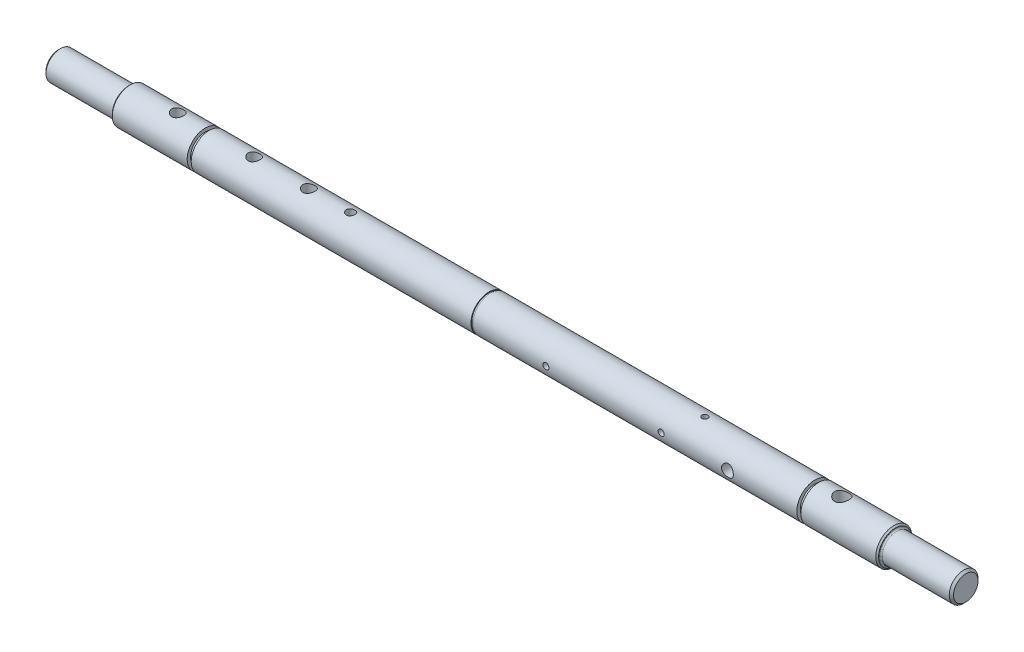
ISO-10303-21;
HEADER;
FILE_DESCRIPTION(('STEP AP214'),'2;1');
FILE_NAME('part.step','',(''),(''),'','','');
FILE_SCHEMA(('AUTOMOTIVE_DESIGN { 1 0 10303 214 1 1 1 1 }'));
ENDSEC;
DATA;
#1=APPLICATION_CONTEXT('core data for automotive mechanical design processes');
#2=APPLICATION_PROTOCOL_DEFINITION('international standard','automotive_design',2000,#1);
#3=PRODUCT_CONTEXT('',#1,'mechanical');
#4=PRODUCT('Part','Part','',(#3));
#5=PRODUCT_RELATED_PRODUCT_CATEGORY('part','',(#4));
#6=PRODUCT_DEFINITION_FORMATION('','',#4);
#7=PRODUCT_DEFINITION_CONTEXT('part definition',#1,'design');
#8=PRODUCT_DEFINITION('design','',#6,#7);
#9=PRODUCT_DEFINITION_SHAPE('','',#8);
#10=(LENGTH_UNIT() NAMED_UNIT(*) SI_UNIT(.MILLI.,.METRE.));
#11=(NAMED_UNIT(*) PLANE_ANGLE_UNIT() SI_UNIT($,.RADIAN.));
#12=(NAMED_UNIT(*) SI_UNIT($,.STERADIAN.) SOLID_ANGLE_UNIT());
#13=UNCERTAINTY_MEASURE_WITH_UNIT(LENGTH_MEASURE(1.E-05),#10,'distance_accuracy_value','');
#14=(GEOMETRIC_REPRESENTATION_CONTEXT(3) GLOBAL_UNCERTAINTY_ASSIGNED_CONTEXT((#13)) GLOBAL_UNIT_ASSIGNED_CONTEXT((#10,
#11,#12)) REPRESENTATION_CONTEXT('',''));
#15=CARTESIAN_POINT('',(0.,0.,0.));
#16=DIRECTION('',(0.,0.,1.));
#17=DIRECTION('',(1.,0.,0.));
#18=AXIS2_PLACEMENT_3D('',#15,#16,#17);
#19=CARTESIAN_POINT('',(203.,-15.,0.));
#20=DIRECTION('',(0.,1.,0.));
#21=DIRECTION('',(0.,0.,1.));
#22=AXIS2_PLACEMENT_3D('',#19,#20,#21);
#23=CYLINDRICAL_SURFACE('',#22,2.);
#24=CARTESIAN_POINT('',(203.,-12.3389626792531,2.));
#25=CARTESIAN_POINT('',(203.11156671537,-12.3389646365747,1.99999546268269));
#26=CARTESIAN_POINT('',(203.223195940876,-12.3404922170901,1.99063305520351));
#27=CARTESIAN_POINT('',(203.443326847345,-12.3464325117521,1.95344445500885));
#28=CARTESIAN_POINT('',(203.551825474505,-12.3508479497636,1.92560083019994));
#29=CARTESIAN_POINT('',(203.762477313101,-12.3620513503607,1.85230972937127));
#30=CARTESIAN_POINT('',(203.864635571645,-12.3688373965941,1.80687646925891));
#31=CARTESIAN_POINT('',(204.059866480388,-12.3840151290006,1.69973041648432));
#32=CARTESIAN_POINT('',(204.152940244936,-12.3924066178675,1.63801962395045));
#33=CARTESIAN_POINT('',(204.328218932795,-12.409935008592,1.49947140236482));
#34=CARTESIAN_POINT('',(204.41032926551,-12.4190774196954,1.42251498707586));
#35=CARTESIAN_POINT('',(204.56052945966,-12.4370285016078,1.25591709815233));
#36=CARTESIAN_POINT('',(204.628618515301,-12.4458371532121,1.1662748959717));
#37=CARTESIAN_POINT('',(204.749195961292,-12.4621862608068,0.976239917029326));
#38=CARTESIAN_POINT('',(204.801596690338,-12.4697194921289,0.875790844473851));
#39=CARTESIAN_POINT('',(204.88874693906,-12.4826077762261,0.667375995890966));
#40=CARTESIAN_POINT('',(204.923497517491,-12.4879629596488,0.559410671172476));
#41=CARTESIAN_POINT('',(204.974072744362,-12.4958528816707,0.340004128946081));
#42=CARTESIAN_POINT('',(204.990056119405,-12.49841126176,0.22860036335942));
#43=CARTESIAN_POINT('',(205.003136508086,-12.500500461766,0.00466480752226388));
#44=CARTESIAN_POINT('',(205.000234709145,-12.5000314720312,-0.107866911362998));
#45=CARTESIAN_POINT('',(204.975751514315,-12.4961375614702,-0.329779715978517));
#46=CARTESIAN_POINT('',(204.954340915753,-12.4927396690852,-0.439180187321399));
#47=CARTESIAN_POINT('',(204.893716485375,-12.4833998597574,-0.652815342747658));
#48=CARTESIAN_POINT('',(204.854502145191,-12.4774578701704,-0.757049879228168));
#49=CARTESIAN_POINT('',(204.7592115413,-12.4636513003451,-0.957905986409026));
#50=CARTESIAN_POINT('',(204.703064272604,-12.4557786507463,-1.05449329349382));
#51=CARTESIAN_POINT('',(204.575553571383,-12.4389865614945,-1.23693967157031));
#52=CARTESIAN_POINT('',(204.504189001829,-12.4300670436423,-1.32279794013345));
#53=CARTESIAN_POINT('',(204.34732043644,-12.4120565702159,-1.48235721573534));
#54=CARTESIAN_POINT('',(204.261667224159,-12.4029648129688,-1.55591150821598));
#55=CARTESIAN_POINT('',(204.079157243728,-12.3857313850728,-1.68762680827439));
#56=CARTESIAN_POINT('',(203.982300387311,-12.3775897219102,-1.74578769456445));
#57=CARTESIAN_POINT('',(203.779969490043,-12.3631781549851,-1.84509031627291));
#58=CARTESIAN_POINT('',(203.674487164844,-12.3569100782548,-1.88621545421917));
#59=CARTESIAN_POINT('',(203.457989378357,-12.3469864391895,-1.95012354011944));
#60=CARTESIAN_POINT('',(203.346974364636,-12.343330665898,-1.9729079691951));
#61=CARTESIAN_POINT('',(203.123872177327,-12.3390860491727,-1.99928349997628));
#62=CARTESIAN_POINT('',(203.011810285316,-12.338463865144,-2.0030832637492));
#63=CARTESIAN_POINT('',(202.788651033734,-12.3402681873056,-1.99193667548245));
#64=CARTESIAN_POINT('',(202.677553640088,-12.3426945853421,-1.97699098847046));
#65=CARTESIAN_POINT('',(202.460133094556,-12.3502919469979,-1.92895527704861));
#66=CARTESIAN_POINT('',(202.353786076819,-12.3554469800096,-1.89597053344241));
#67=CARTESIAN_POINT('',(202.148129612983,-12.3679074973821,-1.81290306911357));
#68=CARTESIAN_POINT('',(202.048820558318,-12.3752131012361,-1.76281939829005));
#69=CARTESIAN_POINT('',(201.859127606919,-12.3912295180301,-1.64647965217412));
#70=CARTESIAN_POINT('',(201.76882704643,-12.3999517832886,-1.58008930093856));
#71=CARTESIAN_POINT('',(201.600573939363,-12.4177848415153,-1.43320604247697));
#72=CARTESIAN_POINT('',(201.52262219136,-12.426895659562,-1.35271222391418));
#73=CARTESIAN_POINT('',(201.380522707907,-12.4445842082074,-1.17898475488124));
#74=CARTESIAN_POINT('',(201.316513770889,-12.4531560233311,-1.08563688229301));
#75=CARTESIAN_POINT('',(201.205086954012,-12.4687070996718,-0.889391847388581));
#76=CARTESIAN_POINT('',(201.157668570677,-12.4756864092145,-0.786494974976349));
#77=CARTESIAN_POINT('',(201.080987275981,-12.4872402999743,-0.574493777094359));
#78=CARTESIAN_POINT('',(201.051650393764,-12.491824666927,-0.465416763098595));
#79=CARTESIAN_POINT('',(201.011726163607,-12.4981133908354,-0.243805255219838));
#80=CARTESIAN_POINT('',(201.001137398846,-12.4998179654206,-0.131271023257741));
#81=CARTESIAN_POINT('',(200.999048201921,-12.5001523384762,0.0927181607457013));
#82=CARTESIAN_POINT('',(201.007336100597,-12.4988162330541,0.204171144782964));
#83=CARTESIAN_POINT('',(201.042308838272,-12.4932886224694,0.424076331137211));
#84=CARTESIAN_POINT('',(201.068993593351,-12.4890971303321,0.532528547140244));
#85=CARTESIAN_POINT('',(201.139923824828,-12.4783277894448,0.743282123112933));
#86=CARTESIAN_POINT('',(201.184152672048,-12.471752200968,0.84558920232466));
#87=CARTESIAN_POINT('',(201.288892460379,-12.4569342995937,1.04136319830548));
#88=CARTESIAN_POINT('',(201.349404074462,-12.4486919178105,1.13482974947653));
#89=CARTESIAN_POINT('',(201.485748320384,-12.4313454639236,1.3113388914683));
#90=CARTESIAN_POINT('',(201.561736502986,-12.4222331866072,1.39426053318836));
#91=CARTESIAN_POINT('',(201.726549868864,-12.4042323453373,1.54625119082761));
#92=CARTESIAN_POINT('',(201.815378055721,-12.3953438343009,1.61531695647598));
#93=CARTESIAN_POINT('',(202.004029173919,-12.3787350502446,1.73804191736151));
#94=CARTESIAN_POINT('',(202.103919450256,-12.3710226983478,1.79159866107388));
#95=CARTESIAN_POINT('',(202.311358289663,-12.35773272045,1.88109182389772));
#96=CARTESIAN_POINT('',(202.418898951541,-12.3521529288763,1.91704612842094));
#97=CARTESIAN_POINT('',(202.605737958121,-12.3450187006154,1.96235985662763));
#98=CARTESIAN_POINT('',(202.683895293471,-12.3427600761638,1.97645270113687));
#99=CARTESIAN_POINT('',(202.841357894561,-12.339731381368,1.99527431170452));
#100=CARTESIAN_POINT('',(202.920663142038,-12.3389612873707,2.00000322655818));
#101=CARTESIAN_POINT('',(203.,-12.3389626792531,2.));
#102=B_SPLINE_CURVE_WITH_KNOTS('',3,(#24,#25,#26,#27,#28,#29,#30,#31,#32,#33,#34,#35,#36,#37,
#38,#39,#40,#41,#42,#43,#44,#45,#46,#47,#48,#49,#50,#51,#52,#53,#54,#55,#56,#57,#58,#59,#60,#61,
#62,#63,#64,#65,#66,#67,#68,#69,#70,#71,#72,#73,#74,#75,#76,#77,#78,#79,#80,#81,#82,#83,#84,#85,
#86,#87,#88,#89,#90,#91,#92,#93,#94,#95,#96,#97,#98,#99,#100,#101),.UNSPECIFIED.,.T.,.F.,(4,2,2,
2,2,2,2,2,2,2,2,2,2,2,2,2,2,2,2,2,2,2,2,2,2,2,2,2,2,2,2,2,2,2,2,2,2,2,4),(0.,0.334410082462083,
0.669136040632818,1.00359203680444,1.33800695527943,1.67514269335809,2.01229780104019,
2.35130309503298,2.69028805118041,3.02638485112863,3.36246051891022,3.6954676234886,
4.02848423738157,4.36291718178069,4.69737512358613,5.03557384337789,5.37377522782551,
5.71230534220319,6.05080811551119,6.38558206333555,6.72034413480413,7.05317297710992,
7.38602031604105,7.72170617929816,8.05741374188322,8.39632425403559,8.73522448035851,
9.07272891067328,9.41020783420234,9.74392117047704,10.0776329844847,10.4110292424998,
10.7444392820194,11.0813822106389,11.4184040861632,11.7576040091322,12.0964585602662,
12.3342666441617,12.5720709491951),.UNSPECIFIED.);
#103=CARTESIAN_POINT('',(203.,-12.3389626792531,2.));
#104=VERTEX_POINT('',#103);
#105=EDGE_CURVE('E265',#104,#104,#102,.T.);
#106=ORIENTED_EDGE('',*,*,#105,.F.);
#107=EDGE_LOOP('',(#106));
#108=FACE_BOUND('',#107,.T.);
#109=CARTESIAN_POINT('',(203.,0.,0.));
#110=DIRECTION('',(0.,1.,0.));
#111=DIRECTION('',(0.,0.,1.));
#112=AXIS2_PLACEMENT_3D('',#109,#110,#111);
#113=CIRCLE('',#112,2.);
#114=CARTESIAN_POINT('',(203.,0.,2.));
#115=VERTEX_POINT('',#114);
#116=EDGE_CURVE('E36',#115,#115,#113,.F.);
#117=ORIENTED_EDGE('',*,*,#116,.F.);
#118=EDGE_LOOP('',(#117));
#119=FACE_BOUND('',#118,.T.);
#120=ADVANCED_FACE('F32',(#108,#119),#23,.F.);
#121=CARTESIAN_POINT('',(0.,0.,0.));
#122=DIRECTION('',(-1.,0.,0.));
#123=DIRECTION('',(0.,0.,1.));
#124=AXIS2_PLACEMENT_3D('',#121,#122,#123);
#125=CYLINDRICAL_SURFACE('',#124,12.5);
#126=CARTESIAN_POINT('',(299.,0.,0.));
#127=DIRECTION('',(-1.,0.,0.));
#128=DIRECTION('',(0.,0.,1.));
#129=AXIS2_PLACEMENT_3D('',#126,#127,#128);
#130=CIRCLE('',#129,12.5);
#131=CARTESIAN_POINT('',(299.,0.,12.5));
#132=VERTEX_POINT('',#131);
#133=EDGE_CURVE('E169',#132,#132,#130,.T.);
#134=ORIENTED_EDGE('',*,*,#133,.T.);
#135=EDGE_LOOP('',(#134));
#136=FACE_BOUND('',#135,.T.);
#137=CARTESIAN_POINT('',(104.8,0.,0.));
#138=DIRECTION('',(-1.,0.,0.));
#139=DIRECTION('',(0.,0.,1.));
#140=AXIS2_PLACEMENT_3D('',#137,#138,#139);
#141=CIRCLE('',#140,12.5);
#142=CARTESIAN_POINT('',(104.8,0.,12.5));
#143=VERTEX_POINT('',#142);
#144=EDGE_CURVE('E172',#143,#143,#141,.T.);
#145=ORIENTED_EDGE('',*,*,#144,.F.);
#146=EDGE_LOOP('',(#145));
#147=FACE_BOUND('',#146,.T.);
#148=CARTESIAN_POINT('',(136.,11.7997616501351,4.125));
#149=CARTESIAN_POINT('',(135.775176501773,11.7997613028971,4.12500060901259));
#150=CARTESIAN_POINT('',(135.550355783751,11.806257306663,4.10655759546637));
#151=CARTESIAN_POINT('',(135.107365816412,11.8314077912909,4.03351542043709));
#152=CARTESIAN_POINT('',(134.889197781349,11.8500644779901,3.97890969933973));
#153=CARTESIAN_POINT('',(134.466000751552,11.8971979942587,3.8356616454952));
#154=CARTESIAN_POINT('',(134.260947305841,11.9256558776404,3.74708494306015));
#155=CARTESIAN_POINT('',(133.868546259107,11.9891579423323,3.53863258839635));
#156=CARTESIAN_POINT('',(133.681202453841,12.0242035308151,3.41875024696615));
#157=CARTESIAN_POINT('',(133.322355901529,12.0984391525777,3.14616635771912));
#158=CARTESIAN_POINT('',(133.151631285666,12.1377309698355,2.99246789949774));
#159=CARTESIAN_POINT('',(132.837851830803,12.2151705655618,2.65874319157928));
#160=CARTESIAN_POINT('',(132.694801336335,12.2533181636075,2.47871281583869));
#161=CARTESIAN_POINT('',(132.436916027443,12.3253472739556,2.091760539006));
#162=CARTESIAN_POINT('',(132.322894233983,12.3590951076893,1.8842697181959));
#163=CARTESIAN_POINT('',(132.131678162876,12.417324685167,1.4517492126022));
#164=CARTESIAN_POINT('',(132.054474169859,12.4418088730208,1.22672417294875));
#165=CARTESIAN_POINT('',(131.941717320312,12.4780315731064,0.773679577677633));
#166=CARTESIAN_POINT('',(131.904831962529,12.4901768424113,0.546024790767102));
#167=CARTESIAN_POINT('',(131.869525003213,12.5017959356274,0.0874550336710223));
#168=CARTESIAN_POINT('',(131.871093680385,12.501272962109,-0.143459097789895));
#169=CARTESIAN_POINT('',(131.911799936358,12.487891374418,-0.592569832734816));
#170=CARTESIAN_POINT('',(131.949490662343,12.4755078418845,-0.810914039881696));
#171=CARTESIAN_POINT('',(132.058981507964,12.440391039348,-1.23798394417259));
#172=CARTESIAN_POINT('',(132.130783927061,12.4176570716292,-1.44670899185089));
#173=CARTESIAN_POINT('',(132.30731844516,12.363783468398,-1.85180776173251));
#174=CARTESIAN_POINT('',(132.412466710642,12.332538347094,-2.0479855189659));
#175=CARTESIAN_POINT('',(132.652366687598,12.2649012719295,-2.42034350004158));
#176=CARTESIAN_POINT('',(132.787126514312,12.2285079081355,-2.59651822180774));
#177=CARTESIAN_POINT('',(133.089737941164,12.1524323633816,-2.93247938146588));
#178=CARTESIAN_POINT('',(133.25883076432,12.1126759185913,-3.09113261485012));
#179=CARTESIAN_POINT('',(133.621566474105,12.0357781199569,-3.37819250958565));
#180=CARTESIAN_POINT('',(133.815212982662,11.9986371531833,-3.50659470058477));
#181=CARTESIAN_POINT('',(134.225085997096,11.930774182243,-3.73103455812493));
#182=CARTESIAN_POINT('',(134.441585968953,11.9001472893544,-3.8266037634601));
#183=CARTESIAN_POINT('',(134.888869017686,11.8498836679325,-3.97954954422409));
#184=CARTESIAN_POINT('',(135.119646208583,11.8302424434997,-4.03694174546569));
#185=CARTESIAN_POINT('',(135.577975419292,11.8051881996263,-4.10961706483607));
#186=CARTESIAN_POINT('',(135.805217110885,11.7991831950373,-4.12665364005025));
#187=CARTESIAN_POINT('',(136.259344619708,11.8004284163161,-4.12309373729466));
#188=CARTESIAN_POINT('',(136.48623049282,11.8076762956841,-4.10250392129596));
#189=CARTESIAN_POINT('',(136.925300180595,11.8340213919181,-4.02584992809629));
#190=CARTESIAN_POINT('',(137.137721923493,11.8527143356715,-3.97099481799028));
#191=CARTESIAN_POINT('',(137.550306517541,11.899401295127,-3.82881307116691));
#192=CARTESIAN_POINT('',(137.750467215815,11.9273969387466,-3.74148075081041));
#193=CARTESIAN_POINT('',(138.139775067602,11.9906181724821,-3.53372106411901));
#194=CARTESIAN_POINT('',(138.328382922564,12.0260422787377,-3.41234516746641));
#195=CARTESIAN_POINT('',(138.683189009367,12.0997396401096,-3.14102394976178));
#196=CARTESIAN_POINT('',(138.849380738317,12.1380137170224,-2.99107036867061));
#197=CARTESIAN_POINT('',(139.162707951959,12.2152747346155,-2.65847809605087));
#198=CARTESIAN_POINT('',(139.308580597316,12.2542106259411,-2.47463440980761));
#199=CARTESIAN_POINT('',(139.567481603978,12.3266301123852,-2.0841229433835));
#200=CARTESIAN_POINT('',(139.680511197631,12.3601139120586,-1.87745601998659));
#201=CARTESIAN_POINT('',(139.869472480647,12.4176937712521,-1.44823928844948));
#202=CARTESIAN_POINT('',(139.945651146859,12.4418521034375,-1.22580700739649));
#203=CARTESIAN_POINT('',(140.059216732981,12.4783286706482,-0.770336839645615));
#204=CARTESIAN_POINT('',(140.096617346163,12.4906510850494,-0.537302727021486));
#205=CARTESIAN_POINT('',(140.130352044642,12.5017582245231,-0.0788064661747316));
#206=CARTESIAN_POINT('',(140.128500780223,12.5011411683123,0.146509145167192));
#207=CARTESIAN_POINT('',(140.088246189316,12.4879050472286,0.593470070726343));
#208=CARTESIAN_POINT('',(140.049845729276,12.4752869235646,0.81511567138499));
#209=CARTESIAN_POINT('',(139.938779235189,12.4396810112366,1.24507416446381));
#210=CARTESIAN_POINT('',(139.866646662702,12.4168548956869,1.45353920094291));
#211=CARTESIAN_POINT('',(139.690655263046,12.3631836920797,1.85549201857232));
#212=CARTESIAN_POINT('',(139.586790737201,12.3323371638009,2.04897710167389));
#213=CARTESIAN_POINT('',(139.345918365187,12.2644093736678,2.42317095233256));
#214=CARTESIAN_POINT('',(139.207839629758,12.2271417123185,2.60315610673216));
#215=CARTESIAN_POINT('',(138.90429087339,12.1510378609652,2.93799546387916));
#216=CARTESIAN_POINT('',(138.738812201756,12.1122011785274,3.09284169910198));
#217=CARTESIAN_POINT('',(138.377610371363,12.0355780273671,3.37900449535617));
#218=CARTESIAN_POINT('',(138.180974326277,11.9978881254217,3.50919823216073));
#219=CARTESIAN_POINT('',(137.76744584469,11.9296592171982,3.73459070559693));
#220=CARTESIAN_POINT('',(137.550559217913,11.8991181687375,3.82979944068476));
#221=CARTESIAN_POINT('',(137.114141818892,11.8503659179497,3.97801836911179));
#222=CARTESIAN_POINT('',(136.895329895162,11.831598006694,4.03295887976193));
#223=CARTESIAN_POINT('',(136.451009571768,11.8062980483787,4.10644343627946));
#224=CARTESIAN_POINT('',(136.225503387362,11.7997619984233,4.12499938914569));
#225=CARTESIAN_POINT('',(136.,11.7997616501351,4.125));
#226=B_SPLINE_CURVE_WITH_KNOTS('',3,(#148,#149,#150,#151,#152,#153,#154,#155,#156,#157,#158,
#159,#160,#161,#162,#163,#164,#165,#166,#167,#168,#169,#170,#171,#172,#173,#174,#175,#176,#177,
#178,#179,#180,#181,#182,#183,#184,#185,#186,#187,#188,#189,#190,#191,#192,#193,#194,#195,#196,
#197,#198,#199,#200,#201,#202,#203,#204,#205,#206,#207,#208,#209,#210,#211,#212,#213,#214,#215,
#216,#217,#218,#219,#220,#221,#222,#223,#224,#225),.UNSPECIFIED.,.T.,.F.,(4,2,2,2,2,2,2,2,2,2,2,
2,2,2,2,2,2,2,2,2,2,2,2,2,2,2,2,2,2,2,2,2,2,2,2,2,2,2,4),(0.,0.673635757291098,1.34739373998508,
2.0198565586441,2.69246318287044,3.38847608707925,4.08459816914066,4.79848121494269,
5.51217577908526,6.20149469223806,6.89063934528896,7.5532862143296,8.21597775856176,
8.88728888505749,9.55878421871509,10.2613032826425,10.9639260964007,11.6761937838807,
12.3881697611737,13.0685925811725,13.7488949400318,14.4064520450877,15.0641242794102,
15.7423391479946,16.4207503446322,17.1310483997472,17.841319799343,18.546762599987,
19.2519562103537,19.9246222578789,20.5972355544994,21.2595538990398,21.9219912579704,
22.6085954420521,23.2954168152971,24.0084365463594,24.7212523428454,25.3971464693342,
26.0728193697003),.UNSPECIFIED.);
#227=CARTESIAN_POINT('',(136.,11.7997616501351,4.125));
#228=VERTEX_POINT('',#227);
#229=EDGE_CURVE('E289',#228,#228,#226,.T.);
#230=ORIENTED_EDGE('',*,*,#229,.T.);
#231=EDGE_LOOP('',(#230));
#232=FACE_BOUND('',#231,.T.);
#233=CARTESIAN_POINT('',(136.,-11.7997616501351,4.125));
#234=CARTESIAN_POINT('',(136.224823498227,-11.7997613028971,4.12500060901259));
#235=CARTESIAN_POINT('',(136.449644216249,-11.806257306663,4.10655759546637));
#236=CARTESIAN_POINT('',(136.892634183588,-11.8314077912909,4.03351542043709));
#237=CARTESIAN_POINT('',(137.110802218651,-11.8500644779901,3.97890969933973));
#238=CARTESIAN_POINT('',(137.533999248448,-11.8971979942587,3.8356616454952));
#239=CARTESIAN_POINT('',(137.739052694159,-11.9256558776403,3.74708494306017));
#240=CARTESIAN_POINT('',(138.131453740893,-11.9891579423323,3.53863258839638));
#241=CARTESIAN_POINT('',(138.318797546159,-12.024203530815,3.41875024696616));
#242=CARTESIAN_POINT('',(138.677644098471,-12.0984391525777,3.14616635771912));
#243=CARTESIAN_POINT('',(138.848368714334,-12.1377309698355,2.99246789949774));
#244=CARTESIAN_POINT('',(139.162148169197,-12.2151705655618,2.65874319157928));
#245=CARTESIAN_POINT('',(139.305198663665,-12.2533181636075,2.47871281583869));
#246=CARTESIAN_POINT('',(139.563083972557,-12.3253472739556,2.091760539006));
#247=CARTESIAN_POINT('',(139.677105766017,-12.3590951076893,1.8842697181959));
#248=CARTESIAN_POINT('',(139.868321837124,-12.417324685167,1.4517492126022));
#249=CARTESIAN_POINT('',(139.945525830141,-12.4418088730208,1.22672417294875));
#250=CARTESIAN_POINT('',(140.058282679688,-12.4780315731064,0.773679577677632));
#251=CARTESIAN_POINT('',(140.095168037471,-12.4901768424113,0.546024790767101));
#252=CARTESIAN_POINT('',(140.130474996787,-12.5017959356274,0.0874550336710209));
#253=CARTESIAN_POINT('',(140.128906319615,-12.501272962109,-0.143459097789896));
#254=CARTESIAN_POINT('',(140.088200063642,-12.487891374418,-0.592569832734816));
#255=CARTESIAN_POINT('',(140.050509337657,-12.4755078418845,-0.810914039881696));
#256=CARTESIAN_POINT('',(139.941018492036,-12.440391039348,-1.23798394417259));
#257=CARTESIAN_POINT('',(139.869216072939,-12.4176570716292,-1.44670899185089));
#258=CARTESIAN_POINT('',(139.69268155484,-12.363783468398,-1.85180776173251));
#259=CARTESIAN_POINT('',(139.587533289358,-12.332538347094,-2.0479855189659));
#260=CARTESIAN_POINT('',(139.347633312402,-12.2649012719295,-2.42034350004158));
#261=CARTESIAN_POINT('',(139.212873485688,-12.2285079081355,-2.59651822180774));
#262=CARTESIAN_POINT('',(138.910262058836,-12.1524323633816,-2.93247938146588));
#263=CARTESIAN_POINT('',(138.74116923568,-12.1126759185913,-3.09113261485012));
#264=CARTESIAN_POINT('',(138.378433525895,-12.0357781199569,-3.37819250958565));
#265=CARTESIAN_POINT('',(138.184787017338,-11.9986371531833,-3.50659470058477));
#266=CARTESIAN_POINT('',(137.774914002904,-11.930774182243,-3.73103455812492));
#267=CARTESIAN_POINT('',(137.558414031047,-11.9001472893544,-3.82660376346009));
#268=CARTESIAN_POINT('',(137.111130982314,-11.8498836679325,-3.97954954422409));
#269=CARTESIAN_POINT('',(136.880353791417,-11.8302424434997,-4.03694174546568));
#270=CARTESIAN_POINT('',(136.422024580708,-11.8051881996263,-4.10961706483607));
#271=CARTESIAN_POINT('',(136.194782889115,-11.7991831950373,-4.12665364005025));
#272=CARTESIAN_POINT('',(135.740655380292,-11.8004284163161,-4.12309373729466));
#273=CARTESIAN_POINT('',(135.51376950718,-11.8076762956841,-4.10250392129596));
#274=CARTESIAN_POINT('',(135.074699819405,-11.8340213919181,-4.02584992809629));
#275=CARTESIAN_POINT('',(134.862278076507,-11.8527143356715,-3.97099481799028));
#276=CARTESIAN_POINT('',(134.449693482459,-11.899401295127,-3.82881307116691));
#277=CARTESIAN_POINT('',(134.249532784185,-11.9273969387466,-3.74148075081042));
#278=CARTESIAN_POINT('',(133.860224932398,-11.9906181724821,-3.53372106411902));
#279=CARTESIAN_POINT('',(133.671617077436,-12.0260422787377,-3.41234516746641));
#280=CARTESIAN_POINT('',(133.316810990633,-12.0997396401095,-3.14102394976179));
#281=CARTESIAN_POINT('',(133.150619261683,-12.1380137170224,-2.99107036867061));
#282=CARTESIAN_POINT('',(132.837292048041,-12.2152747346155,-2.65847809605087));
#283=CARTESIAN_POINT('',(132.691419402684,-12.2542106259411,-2.47463440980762));
#284=CARTESIAN_POINT('',(132.432518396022,-12.3266301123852,-2.08412294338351));
#285=CARTESIAN_POINT('',(132.319488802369,-12.3601139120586,-1.8774560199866));
#286=CARTESIAN_POINT('',(132.130527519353,-12.4176937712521,-1.44823928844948));
#287=CARTESIAN_POINT('',(132.054348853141,-12.4418521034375,-1.22580700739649));
#288=CARTESIAN_POINT('',(131.940783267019,-12.4783286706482,-0.770336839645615));
#289=CARTESIAN_POINT('',(131.903382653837,-12.4906510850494,-0.537302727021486));
#290=CARTESIAN_POINT('',(131.869647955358,-12.5017582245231,-0.0788064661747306));
#291=CARTESIAN_POINT('',(131.871499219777,-12.5011411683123,0.146509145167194));
#292=CARTESIAN_POINT('',(131.911753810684,-12.4879050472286,0.593470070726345));
#293=CARTESIAN_POINT('',(131.950154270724,-12.4752869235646,0.815115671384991));
#294=CARTESIAN_POINT('',(132.061220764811,-12.4396810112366,1.24507416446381));
#295=CARTESIAN_POINT('',(132.133353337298,-12.4168548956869,1.45353920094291));
#296=CARTESIAN_POINT('',(132.309344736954,-12.3631836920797,1.85549201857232));
#297=CARTESIAN_POINT('',(132.413209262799,-12.3323371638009,2.04897710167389));
#298=CARTESIAN_POINT('',(132.654081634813,-12.2644093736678,2.42317095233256));
#299=CARTESIAN_POINT('',(132.792160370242,-12.2271417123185,2.60315610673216));
#300=CARTESIAN_POINT('',(133.09570912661,-12.1510378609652,2.93799546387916));
#301=CARTESIAN_POINT('',(133.261187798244,-12.1122011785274,3.09284169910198));
#302=CARTESIAN_POINT('',(133.622389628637,-12.0355780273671,3.37900449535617));
#303=CARTESIAN_POINT('',(133.819025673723,-11.9978881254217,3.50919823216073));
#304=CARTESIAN_POINT('',(134.23255415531,-11.9296592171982,3.73459070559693));
#305=CARTESIAN_POINT('',(134.449440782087,-11.8991181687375,3.82979944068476));
#306=CARTESIAN_POINT('',(134.885858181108,-11.8503659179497,3.97801836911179));
#307=CARTESIAN_POINT('',(135.104670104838,-11.831598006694,4.03295887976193));
#308=CARTESIAN_POINT('',(135.548990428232,-11.8062980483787,4.10644343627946));
#309=CARTESIAN_POINT('',(135.774496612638,-11.7997619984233,4.12499938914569));
#310=CARTESIAN_POINT('',(136.,-11.7997616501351,4.125));
#311=B_SPLINE_CURVE_WITH_KNOTS('',3,(#233,#234,#235,#236,#237,#238,#239,#240,#241,#242,#243,
#244,#245,#246,#247,#248,#249,#250,#251,#252,#253,#254,#255,#256,#257,#258,#259,#260,#261,#262,
#263,#264,#265,#266,#267,#268,#269,#270,#271,#272,#273,#274,#275,#276,#277,#278,#279,#280,#281,
#282,#283,#284,#285,#286,#287,#288,#289,#290,#291,#292,#293,#294,#295,#296,#297,#298,#299,#300,
#301,#302,#303,#304,#305,#306,#307,#308,#309,#310),.UNSPECIFIED.,.T.,.F.,(4,2,2,2,2,2,2,2,2,2,2,
2,2,2,2,2,2,2,2,2,2,2,2,2,2,2,2,2,2,2,2,2,2,2,2,2,2,2,4),(0.,0.673635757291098,1.34739373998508,
2.01985655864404,2.69246318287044,3.38847608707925,4.08459816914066,4.79848121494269,
5.51217577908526,6.20149469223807,6.89063934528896,7.5532862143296,8.21597775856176,
8.88728888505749,9.55878421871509,10.2613032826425,10.9639260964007,11.6761937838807,
12.3881697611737,13.0685925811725,13.7488949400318,14.4064520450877,15.0641242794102,
15.7423391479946,16.4207503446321,17.1310483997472,17.841319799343,18.546762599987,
19.2519562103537,19.9246222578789,20.5972355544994,21.2595538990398,21.9219912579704,
22.6085954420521,23.2954168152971,24.0084365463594,24.7212523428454,25.3971464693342,
26.0728193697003),.UNSPECIFIED.);
#312=CARTESIAN_POINT('',(136.,-11.7997616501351,4.125));
#313=VERTEX_POINT('',#312);
#314=EDGE_CURVE('E206',#313,#313,#311,.T.);
#315=ORIENTED_EDGE('',*,*,#314,.T.);
#316=EDGE_LOOP('',(#315));
#317=FACE_BOUND('',#316,.T.);
#318=CARTESIAN_POINT('',(174.,11.7997616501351,4.125));
#319=CARTESIAN_POINT('',(173.775176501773,11.7997613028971,4.12500060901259));
#320=CARTESIAN_POINT('',(173.550355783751,11.806257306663,4.10655759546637));
#321=CARTESIAN_POINT('',(173.107365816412,11.8314077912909,4.03351542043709));
#322=CARTESIAN_POINT('',(172.889197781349,11.8500644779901,3.97890969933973));
#323=CARTESIAN_POINT('',(172.466000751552,11.8971979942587,3.8356616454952));
#324=CARTESIAN_POINT('',(172.260947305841,11.9256558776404,3.74708494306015));
#325=CARTESIAN_POINT('',(171.868546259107,11.9891579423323,3.53863258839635));
#326=CARTESIAN_POINT('',(171.681202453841,12.0242035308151,3.41875024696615));
#327=CARTESIAN_POINT('',(171.322355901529,12.0984391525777,3.14616635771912));
#328=CARTESIAN_POINT('',(171.151631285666,12.1377309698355,2.99246789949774));
#329=CARTESIAN_POINT('',(170.837851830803,12.2151705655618,2.65874319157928));
#330=CARTESIAN_POINT('',(170.694801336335,12.2533181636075,2.47871281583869));
#331=CARTESIAN_POINT('',(170.436916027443,12.3253472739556,2.091760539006));
#332=CARTESIAN_POINT('',(170.322894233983,12.3590951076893,1.8842697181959));
#333=CARTESIAN_POINT('',(170.131678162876,12.417324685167,1.4517492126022));
#334=CARTESIAN_POINT('',(170.054474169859,12.4418088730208,1.22672417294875));
#335=CARTESIAN_POINT('',(169.941717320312,12.4780315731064,0.773679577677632));
#336=CARTESIAN_POINT('',(169.904831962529,12.4901768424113,0.5460247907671));
#337=CARTESIAN_POINT('',(169.869525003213,12.5017959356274,0.087455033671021));
#338=CARTESIAN_POINT('',(169.871093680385,12.501272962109,-0.143459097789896));
#339=CARTESIAN_POINT('',(169.911799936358,12.487891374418,-0.592569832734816));
#340=CARTESIAN_POINT('',(169.949490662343,12.4755078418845,-0.810914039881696));
#341=CARTESIAN_POINT('',(170.058981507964,12.440391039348,-1.23798394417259));
#342=CARTESIAN_POINT('',(170.130783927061,12.4176570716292,-1.44670899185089));
#343=CARTESIAN_POINT('',(170.30731844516,12.363783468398,-1.85180776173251));
#344=CARTESIAN_POINT('',(170.412466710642,12.332538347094,-2.04798551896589));
#345=CARTESIAN_POINT('',(170.652366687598,12.2649012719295,-2.42034350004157));
#346=CARTESIAN_POINT('',(170.787126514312,12.2285079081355,-2.59651822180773));
#347=CARTESIAN_POINT('',(171.089737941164,12.1524323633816,-2.93247938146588));
#348=CARTESIAN_POINT('',(171.25883076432,12.1126759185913,-3.09113261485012));
#349=CARTESIAN_POINT('',(171.621566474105,12.0357781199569,-3.37819250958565));
#350=CARTESIAN_POINT('',(171.815212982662,11.9986371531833,-3.50659470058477));
#351=CARTESIAN_POINT('',(172.225085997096,11.930774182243,-3.73103455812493));
#352=CARTESIAN_POINT('',(172.441585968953,11.9001472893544,-3.8266037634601));
#353=CARTESIAN_POINT('',(172.888869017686,11.8498836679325,-3.97954954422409));
#354=CARTESIAN_POINT('',(173.119646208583,11.8302424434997,-4.03694174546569));
#355=CARTESIAN_POINT('',(173.577975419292,11.8051881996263,-4.10961706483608));
#356=CARTESIAN_POINT('',(173.805217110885,11.7991831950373,-4.12665364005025));
#357=CARTESIAN_POINT('',(174.259344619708,11.8004284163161,-4.12309373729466));
#358=CARTESIAN_POINT('',(174.48623049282,11.8076762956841,-4.10250392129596));
#359=CARTESIAN_POINT('',(174.925300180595,11.8340213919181,-4.02584992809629));
#360=CARTESIAN_POINT('',(175.137721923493,11.8527143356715,-3.97099481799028));
#361=CARTESIAN_POINT('',(175.550306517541,11.899401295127,-3.82881307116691));
#362=CARTESIAN_POINT('',(175.750467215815,11.9273969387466,-3.74148075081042));
#363=CARTESIAN_POINT('',(176.139775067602,11.9906181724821,-3.53372106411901));
#364=CARTESIAN_POINT('',(176.328382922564,12.0260422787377,-3.41234516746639));
#365=CARTESIAN_POINT('',(176.683189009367,12.0997396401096,-3.14102394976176));
#366=CARTESIAN_POINT('',(176.849380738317,12.1380137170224,-2.9910703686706));
#367=CARTESIAN_POINT('',(177.162707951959,12.2152747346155,-2.65847809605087));
#368=CARTESIAN_POINT('',(177.308580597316,12.2542106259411,-2.47463440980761));
#369=CARTESIAN_POINT('',(177.567481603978,12.3266301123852,-2.0841229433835));
#370=CARTESIAN_POINT('',(177.680511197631,12.3601139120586,-1.87745601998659));
#371=CARTESIAN_POINT('',(177.869472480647,12.4176937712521,-1.44823928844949));
#372=CARTESIAN_POINT('',(177.945651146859,12.4418521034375,-1.22580700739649));
#373=CARTESIAN_POINT('',(178.059216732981,12.4783286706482,-0.770336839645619));
#374=CARTESIAN_POINT('',(178.096617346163,12.4906510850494,-0.537302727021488));
#375=CARTESIAN_POINT('',(178.130352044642,12.5017582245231,-0.0788064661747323));
#376=CARTESIAN_POINT('',(178.128500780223,12.5011411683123,0.14650914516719));
#377=CARTESIAN_POINT('',(178.088246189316,12.4879050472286,0.593470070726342));
#378=CARTESIAN_POINT('',(178.049845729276,12.4752869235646,0.815115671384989));
#379=CARTESIAN_POINT('',(177.938779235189,12.4396810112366,1.24507416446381));
#380=CARTESIAN_POINT('',(177.866646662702,12.4168548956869,1.45353920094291));
#381=CARTESIAN_POINT('',(177.690655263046,12.3631836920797,1.85549201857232));
#382=CARTESIAN_POINT('',(177.586790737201,12.3323371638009,2.04897710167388));
#383=CARTESIAN_POINT('',(177.345918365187,12.2644093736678,2.42317095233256));
#384=CARTESIAN_POINT('',(177.207839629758,12.2271417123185,2.60315610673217));
#385=CARTESIAN_POINT('',(176.90429087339,12.1510378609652,2.93799546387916));
#386=CARTESIAN_POINT('',(176.738812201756,12.1122011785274,3.09284169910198));
#387=CARTESIAN_POINT('',(176.377610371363,12.0355780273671,3.37900449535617));
#388=CARTESIAN_POINT('',(176.180974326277,11.9978881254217,3.50919823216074));
#389=CARTESIAN_POINT('',(175.76744584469,11.9296592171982,3.73459070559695));
#390=CARTESIAN_POINT('',(175.550559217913,11.8991181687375,3.82979944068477));
#391=CARTESIAN_POINT('',(175.114141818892,11.8503659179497,3.97801836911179));
#392=CARTESIAN_POINT('',(174.895329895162,11.831598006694,4.03295887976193));
#393=CARTESIAN_POINT('',(174.451009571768,11.8062980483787,4.10644343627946));
#394=CARTESIAN_POINT('',(174.225503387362,11.7997619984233,4.12499938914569));
#395=CARTESIAN_POINT('',(174.,11.7997616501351,4.125));
#396=B_SPLINE_CURVE_WITH_KNOTS('',3,(#318,#319,#320,#321,#322,#323,#324,#325,#326,#327,#328,
#329,#330,#331,#332,#333,#334,#335,#336,#337,#338,#339,#340,#341,#342,#343,#344,#345,#346,#347,
#348,#349,#350,#351,#352,#353,#354,#355,#356,#357,#358,#359,#360,#361,#362,#363,#364,#365,#366,
#367,#368,#369,#370,#371,#372,#373,#374,#375,#376,#377,#378,#379,#380,#381,#382,#383,#384,#385,
#386,#387,#388,#389,#390,#391,#392,#393,#394,#395),.UNSPECIFIED.,.T.,.F.,(4,2,2,2,2,2,2,2,2,2,2,
2,2,2,2,2,2,2,2,2,2,2,2,2,2,2,2,2,2,2,2,2,2,2,2,2,2,2,4),(0.,0.673635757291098,1.34739373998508,
2.0198565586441,2.69246318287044,3.38847608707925,4.08459816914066,4.79848121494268,
5.51217577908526,6.20149469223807,6.89063934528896,7.5532862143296,8.21597775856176,
8.88728888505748,9.55878421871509,10.2613032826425,10.9639260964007,11.6761937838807,
12.3881697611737,13.0685925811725,13.7488949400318,14.4064520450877,15.0641242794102,
15.7423391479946,16.4207503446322,17.1310483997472,17.841319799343,18.546762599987,
19.2519562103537,19.9246222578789,20.5972355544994,21.2595538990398,21.9219912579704,
22.6085954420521,23.2954168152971,24.0084365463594,24.7212523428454,25.3971464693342,
26.0728193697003),.UNSPECIFIED.);
#397=CARTESIAN_POINT('',(174.,11.7997616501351,4.125));
#398=VERTEX_POINT('',#397);
#399=EDGE_CURVE('E283',#398,#398,#396,.T.);
#400=ORIENTED_EDGE('',*,*,#399,.T.);
#401=EDGE_LOOP('',(#400));
#402=FACE_BOUND('',#401,.T.);
#403=CARTESIAN_POINT('',(174.,-11.7997616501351,4.125));
#404=CARTESIAN_POINT('',(174.224823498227,-11.7997613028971,4.12500060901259));
#405=CARTESIAN_POINT('',(174.449644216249,-11.806257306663,4.10655759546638));
#406=CARTESIAN_POINT('',(174.892634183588,-11.8314077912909,4.0335154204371));
#407=CARTESIAN_POINT('',(175.110802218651,-11.8500644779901,3.97890969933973));
#408=CARTESIAN_POINT('',(175.533999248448,-11.8971979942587,3.8356616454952));
#409=CARTESIAN_POINT('',(175.739052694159,-11.9256558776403,3.74708494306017));
#410=CARTESIAN_POINT('',(176.131453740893,-11.9891579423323,3.53863258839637));
#411=CARTESIAN_POINT('',(176.318797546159,-12.024203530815,3.41875024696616));
#412=CARTESIAN_POINT('',(176.677644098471,-12.0984391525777,3.14616635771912));
#413=CARTESIAN_POINT('',(176.848368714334,-12.1377309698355,2.99246789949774));
#414=CARTESIAN_POINT('',(177.162148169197,-12.2151705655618,2.65874319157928));
#415=CARTESIAN_POINT('',(177.305198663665,-12.2533181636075,2.47871281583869));
#416=CARTESIAN_POINT('',(177.563083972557,-12.3253472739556,2.091760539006));
#417=CARTESIAN_POINT('',(177.677105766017,-12.3590951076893,1.8842697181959));
#418=CARTESIAN_POINT('',(177.868321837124,-12.417324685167,1.4517492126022));
#419=CARTESIAN_POINT('',(177.945525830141,-12.4418088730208,1.22672417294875));
#420=CARTESIAN_POINT('',(178.058282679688,-12.4780315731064,0.773679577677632));
#421=CARTESIAN_POINT('',(178.095168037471,-12.4901768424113,0.5460247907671));
#422=CARTESIAN_POINT('',(178.130474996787,-12.5017959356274,0.0874550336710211));
#423=CARTESIAN_POINT('',(178.128906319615,-12.501272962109,-0.143459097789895));
#424=CARTESIAN_POINT('',(178.088200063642,-12.487891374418,-0.592569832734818));
#425=CARTESIAN_POINT('',(178.050509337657,-12.4755078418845,-0.810914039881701));
#426=CARTESIAN_POINT('',(177.941018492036,-12.440391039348,-1.23798394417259));
#427=CARTESIAN_POINT('',(177.869216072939,-12.4176570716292,-1.44670899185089));
#428=CARTESIAN_POINT('',(177.69268155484,-12.363783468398,-1.85180776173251));
#429=CARTESIAN_POINT('',(177.587533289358,-12.332538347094,-2.0479855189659));
#430=CARTESIAN_POINT('',(177.347633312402,-12.2649012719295,-2.42034350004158));
#431=CARTESIAN_POINT('',(177.212873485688,-12.2285079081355,-2.59651822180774));
#432=CARTESIAN_POINT('',(176.910262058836,-12.1524323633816,-2.93247938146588));
#433=CARTESIAN_POINT('',(176.74116923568,-12.1126759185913,-3.09113261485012));
#434=CARTESIAN_POINT('',(176.378433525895,-12.0357781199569,-3.37819250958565));
#435=CARTESIAN_POINT('',(176.184787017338,-11.9986371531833,-3.50659470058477));
#436=CARTESIAN_POINT('',(175.774914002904,-11.930774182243,-3.73103455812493));
#437=CARTESIAN_POINT('',(175.558414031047,-11.9001472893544,-3.8266037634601));
#438=CARTESIAN_POINT('',(175.111130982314,-11.8498836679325,-3.97954954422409));
#439=CARTESIAN_POINT('',(174.880353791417,-11.8302424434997,-4.03694174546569));
#440=CARTESIAN_POINT('',(174.422024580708,-11.8051881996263,-4.10961706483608));
#441=CARTESIAN_POINT('',(174.194782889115,-11.7991831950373,-4.12665364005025));
#442=CARTESIAN_POINT('',(173.740655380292,-11.8004284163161,-4.12309373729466));
#443=CARTESIAN_POINT('',(173.51376950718,-11.8076762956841,-4.10250392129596));
#444=CARTESIAN_POINT('',(173.074699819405,-11.8340213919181,-4.02584992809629));
#445=CARTESIAN_POINT('',(172.862278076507,-11.8527143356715,-3.97099481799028));
#446=CARTESIAN_POINT('',(172.449693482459,-11.899401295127,-3.82881307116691));
#447=CARTESIAN_POINT('',(172.249532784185,-11.9273969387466,-3.74148075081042));
#448=CARTESIAN_POINT('',(171.860224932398,-11.9906181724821,-3.53372106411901));
#449=CARTESIAN_POINT('',(171.671617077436,-12.0260422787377,-3.4123451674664));
#450=CARTESIAN_POINT('',(171.316810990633,-12.0997396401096,-3.14102394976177));
#451=CARTESIAN_POINT('',(171.150619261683,-12.1380137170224,-2.9910703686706));
#452=CARTESIAN_POINT('',(170.837292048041,-12.2152747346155,-2.65847809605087));
#453=CARTESIAN_POINT('',(170.691419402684,-12.2542106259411,-2.47463440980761));
#454=CARTESIAN_POINT('',(170.432518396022,-12.3266301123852,-2.0841229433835));
#455=CARTESIAN_POINT('',(170.319488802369,-12.3601139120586,-1.87745601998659));
#456=CARTESIAN_POINT('',(170.130527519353,-12.4176937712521,-1.44823928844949));
#457=CARTESIAN_POINT('',(170.054348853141,-12.4418521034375,-1.22580700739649));
#458=CARTESIAN_POINT('',(169.940783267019,-12.4783286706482,-0.770336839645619));
#459=CARTESIAN_POINT('',(169.903382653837,-12.4906510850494,-0.537302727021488));
#460=CARTESIAN_POINT('',(169.869647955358,-12.5017582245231,-0.0788064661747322));
#461=CARTESIAN_POINT('',(169.871499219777,-12.5011411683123,0.146509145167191));
#462=CARTESIAN_POINT('',(169.911753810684,-12.4879050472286,0.593470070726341));
#463=CARTESIAN_POINT('',(169.950154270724,-12.4752869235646,0.815115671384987));
#464=CARTESIAN_POINT('',(170.061220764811,-12.4396810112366,1.2450741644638));
#465=CARTESIAN_POINT('',(170.133353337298,-12.4168548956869,1.45353920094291));
#466=CARTESIAN_POINT('',(170.309344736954,-12.3631836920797,1.85549201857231));
#467=CARTESIAN_POINT('',(170.413209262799,-12.3323371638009,2.04897710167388));
#468=CARTESIAN_POINT('',(170.654081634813,-12.2644093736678,2.42317095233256));
#469=CARTESIAN_POINT('',(170.792160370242,-12.2271417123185,2.60315610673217));
#470=CARTESIAN_POINT('',(171.09570912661,-12.1510378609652,2.93799546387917));
#471=CARTESIAN_POINT('',(171.261187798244,-12.1122011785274,3.09284169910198));
#472=CARTESIAN_POINT('',(171.622389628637,-12.0355780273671,3.37900449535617));
#473=CARTESIAN_POINT('',(171.819025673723,-11.9978881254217,3.50919823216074));
#474=CARTESIAN_POINT('',(172.23255415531,-11.9296592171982,3.73459070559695));
#475=CARTESIAN_POINT('',(172.449440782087,-11.8991181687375,3.82979944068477));
#476=CARTESIAN_POINT('',(172.885858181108,-11.8503659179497,3.97801836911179));
#477=CARTESIAN_POINT('',(173.104670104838,-11.831598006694,4.03295887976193));
#478=CARTESIAN_POINT('',(173.548990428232,-11.8062980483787,4.10644343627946));
#479=CARTESIAN_POINT('',(173.774496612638,-11.7997619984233,4.12499938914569));
#480=CARTESIAN_POINT('',(174.,-11.7997616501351,4.125));
#481=B_SPLINE_CURVE_WITH_KNOTS('',3,(#403,#404,#405,#406,#407,#408,#409,#410,#411,#412,#413,
#414,#415,#416,#417,#418,#419,#420,#421,#422,#423,#424,#425,#426,#427,#428,#429,#430,#431,#432,
#433,#434,#435,#436,#437,#438,#439,#440,#441,#442,#443,#444,#445,#446,#447,#448,#449,#450,#451,
#452,#453,#454,#455,#456,#457,#458,#459,#460,#461,#462,#463,#464,#465,#466,#467,#468,#469,#470,
#471,#472,#473,#474,#475,#476,#477,#478,#479,#480),.UNSPECIFIED.,.T.,.F.,(4,2,2,2,2,2,2,2,2,2,2,
2,2,2,2,2,2,2,2,2,2,2,2,2,2,2,2,2,2,2,2,2,2,2,2,2,2,2,4),(0.,0.67363575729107,1.34739373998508,
2.01985655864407,2.69246318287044,3.38847608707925,4.08459816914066,4.79848121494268,
5.51217577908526,6.20149469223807,6.89063934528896,7.55328621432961,8.21597775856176,
8.88728888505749,9.5587842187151,10.2613032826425,10.9639260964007,11.6761937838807,
12.3881697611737,13.0685925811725,13.7488949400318,14.4064520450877,15.0641242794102,
15.7423391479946,16.4207503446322,17.1310483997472,17.841319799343,18.546762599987,
19.2519562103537,19.9246222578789,20.5972355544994,21.2595538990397,21.9219912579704,
22.6085954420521,23.2954168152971,24.0084365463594,24.7212523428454,25.3971464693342,
26.0728193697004),.UNSPECIFIED.);
#482=CARTESIAN_POINT('',(174.,-11.7997616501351,4.125));
#483=VERTEX_POINT('',#482);
#484=EDGE_CURVE('E284',#483,#483,#481,.T.);
#485=ORIENTED_EDGE('',*,*,#484,.T.);
#486=EDGE_LOOP('',(#485));
#487=FACE_BOUND('',#486,.T.);
#488=ORIENTED_EDGE('',*,*,#105,.T.);
#489=EDGE_LOOP('',(#488));
#490=FACE_BOUND('',#489,.T.);
#491=CARTESIAN_POINT('',(200.,12.5,0.));
#492=CARTESIAN_POINT('',(200.000005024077,12.4999970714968,0.165963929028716));
#493=CARTESIAN_POINT('',(200.013818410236,12.4966615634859,0.331985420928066));
#494=CARTESIAN_POINT('',(200.068632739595,12.4836783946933,0.659284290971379));
#495=CARTESIAN_POINT('',(200.109650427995,12.4740268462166,0.820558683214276));
#496=CARTESIAN_POINT('',(200.217492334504,12.4494823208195,1.13358839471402));
#497=CARTESIAN_POINT('',(200.284286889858,12.4345953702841,1.28535442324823));
#498=CARTESIAN_POINT('',(200.441685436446,12.4011725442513,1.57552517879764));
#499=CARTESIAN_POINT('',(200.532289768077,12.3826366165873,1.71392971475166));
#500=CARTESIAN_POINT('',(200.736564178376,12.3435386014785,1.97609263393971));
#501=CARTESIAN_POINT('',(200.850602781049,12.3229472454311,2.09955952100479));
#502=CARTESIAN_POINT('',(201.097718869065,12.2822574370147,2.32581080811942));
#503=CARTESIAN_POINT('',(201.230798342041,12.2621590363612,2.42859304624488));
#504=CARTESIAN_POINT('',(201.514445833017,12.224437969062,2.61189993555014));
#505=CARTESIAN_POINT('',(201.665226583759,12.2068525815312,2.69210377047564));
#506=CARTESIAN_POINT('',(201.978619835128,12.1765733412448,2.82591582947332));
#507=CARTESIAN_POINT('',(202.141230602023,12.1638787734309,2.87952794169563));
#508=CARTESIAN_POINT('',(202.470476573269,12.1451184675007,2.95765058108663));
#509=CARTESIAN_POINT('',(202.636981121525,12.1389341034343,2.98268262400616));
#510=CARTESIAN_POINT('',(202.971932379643,12.1335389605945,3.00455808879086));
#511=CARTESIAN_POINT('',(203.140378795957,12.1343271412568,3.00140571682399));
#512=CARTESIAN_POINT('',(203.470475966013,12.1426811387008,2.96741912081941));
#513=CARTESIAN_POINT('',(203.63219456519,12.1500960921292,2.93720103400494));
#514=CARTESIAN_POINT('',(203.948197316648,12.1706283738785,2.85092141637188));
#515=CARTESIAN_POINT('',(204.102480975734,12.1837460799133,2.79485817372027));
#516=CARTESIAN_POINT('',(204.400912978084,12.2143476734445,2.65794121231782));
#517=CARTESIAN_POINT('',(204.544952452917,12.2318714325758,2.57685948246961));
#518=CARTESIAN_POINT('',(204.817604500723,12.2692875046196,2.39236688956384));
#519=CARTESIAN_POINT('',(204.946214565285,12.2891802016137,2.28895240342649));
#520=CARTESIAN_POINT('',(205.187893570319,12.329732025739,2.05951493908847));
#521=CARTESIAN_POINT('',(205.300467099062,12.3503975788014,1.93297064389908));
#522=CARTESIAN_POINT('',(205.502884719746,12.3896951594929,1.66255592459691));
#523=CARTESIAN_POINT('',(205.592728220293,12.4083271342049,1.5186850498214));
#524=CARTESIAN_POINT('',(205.747297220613,12.4415394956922,1.2170284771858));
#525=CARTESIAN_POINT('',(205.811947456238,12.4561077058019,1.05920278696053));
#526=CARTESIAN_POINT('',(205.913665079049,12.4794620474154,0.734497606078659));
#527=CARTESIAN_POINT('',(205.950737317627,12.4882491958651,0.567619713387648));
#528=CARTESIAN_POINT('',(205.995502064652,12.4989027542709,0.233787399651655));
#529=CARTESIAN_POINT('',(206.003869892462,12.5009282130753,0.0669284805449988));
#530=CARTESIAN_POINT('',(205.992833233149,12.4982807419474,-0.265804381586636));
#531=CARTESIAN_POINT('',(205.973431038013,12.4936083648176,-0.431678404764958));
#532=CARTESIAN_POINT('',(205.907963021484,12.4781916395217,-0.755422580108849));
#533=CARTESIAN_POINT('',(205.862260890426,12.4675301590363,-0.913370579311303));
#534=CARTESIAN_POINT('',(205.745901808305,12.4413335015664,-1.21935330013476));
#535=CARTESIAN_POINT('',(205.675242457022,12.4257978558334,-1.3673870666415));
#536=CARTESIAN_POINT('',(205.509633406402,12.3911910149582,-1.6520615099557));
#537=CARTESIAN_POINT('',(205.414299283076,12.3720653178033,-1.78847176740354));
#538=CARTESIAN_POINT('',(205.202543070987,12.3324936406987,-2.04359904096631));
#539=CARTESIAN_POINT('',(205.086117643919,12.3120474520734,-2.16231325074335));
#540=CARTESIAN_POINT('',(204.832359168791,12.2715742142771,-2.3814245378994));
#541=CARTESIAN_POINT('',(204.694614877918,12.2515669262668,-2.4813497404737));
#542=CARTESIAN_POINT('',(204.403909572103,12.2147538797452,-2.65666020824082));
#543=CARTESIAN_POINT('',(204.250949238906,12.1979479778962,-2.7320465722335));
#544=CARTESIAN_POINT('',(203.934987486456,12.1696189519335,-2.85558993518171));
#545=CARTESIAN_POINT('',(203.772051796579,12.1580647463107,-2.90390754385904));
#546=CARTESIAN_POINT('',(203.440053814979,12.1415072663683,-2.97238380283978));
#547=CARTESIAN_POINT('',(203.270992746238,12.1365026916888,-2.9925480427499));
#548=CARTESIAN_POINT('',(202.936329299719,12.1337046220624,-3.00387066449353));
#549=CARTESIAN_POINT('',(202.770753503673,12.1357241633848,-2.99578106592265));
#550=CARTESIAN_POINT('',(202.443400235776,12.1463176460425,-2.95253345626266));
#551=CARTESIAN_POINT('',(202.281622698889,12.1548914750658,-2.91737590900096));
#552=CARTESIAN_POINT('',(201.967202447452,12.1775274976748,-2.82138591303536));
#553=CARTESIAN_POINT('',(201.814517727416,12.191561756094,-2.76068402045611));
#554=CARTESIAN_POINT('',(201.521395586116,12.2235433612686,-2.61543373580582));
#555=CARTESIAN_POINT('',(201.380959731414,12.2414912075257,-2.53088229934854));
#556=CARTESIAN_POINT('',(201.11266299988,12.279819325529,-2.33793007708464));
#557=CARTESIAN_POINT('',(200.985187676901,12.3002478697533,-2.22900267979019));
#558=CARTESIAN_POINT('',(200.750080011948,12.3409359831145,-1.99143074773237));
#559=CARTESIAN_POINT('',(200.64245233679,12.361195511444,-1.86278158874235));
#560=CARTESIAN_POINT('',(200.448390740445,12.3996570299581,-1.5868829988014));
#561=CARTESIAN_POINT('',(200.362331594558,12.4178200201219,-1.43936414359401));
#562=CARTESIAN_POINT('',(200.216370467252,12.4496380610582,-1.13153622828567));
#563=CARTESIAN_POINT('',(200.156448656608,12.4632965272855,-0.971236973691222));
#564=CARTESIAN_POINT('',(200.073961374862,12.4824059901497,-0.675887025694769));
#565=CARTESIAN_POINT('',(200.046283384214,12.4889599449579,-0.542312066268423));
#566=CARTESIAN_POINT('',(200.009301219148,12.4977580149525,-0.272504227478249));
#567=CARTESIAN_POINT('',(199.999995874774,12.5000024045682,-0.136271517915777));
#568=CARTESIAN_POINT('',(200.,12.5,0.));
#569=B_SPLINE_CURVE_WITH_KNOTS('',3,(#491,#492,#493,#494,#495,#496,#497,#498,#499,#500,#501,
#502,#503,#504,#505,#506,#507,#508,#509,#510,#511,#512,#513,#514,#515,#516,#517,#518,#519,#520,
#521,#522,#523,#524,#525,#526,#527,#528,#529,#530,#531,#532,#533,#534,#535,#536,#537,#538,#539,
#540,#541,#542,#543,#544,#545,#546,#547,#548,#549,#550,#551,#552,#553,#554,#555,#556,#557,#558,
#559,#560,#561,#562,#563,#564,#565,#566,#567,#568),.UNSPECIFIED.,.T.,.F.,(4,2,2,2,2,2,2,2,2,2,2,
2,2,2,2,2,2,2,2,2,2,2,2,2,2,2,2,2,2,2,2,2,2,2,2,2,2,2,4),(0.,0.497392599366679,
0.995091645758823,1.49221966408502,1.98935478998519,2.49500570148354,3.00070943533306,
3.51327262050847,4.02576083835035,4.5287399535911,5.03164400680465,5.52338274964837,
6.01515406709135,6.51154667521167,7.00801987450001,7.51749958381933,8.02699254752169,
8.53799614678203,9.04890983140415,9.54771776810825,10.0464845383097,10.5385143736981,
11.0305915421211,11.5308523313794,12.031192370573,12.5427824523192,13.0543496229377,
13.5628484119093,14.0712462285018,14.5662165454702,15.0611783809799,15.5536406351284,
16.0461657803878,16.550584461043,17.0551215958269,17.5678974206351,18.0802835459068,
18.4887142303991,18.897118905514),.UNSPECIFIED.);
#570=CARTESIAN_POINT('',(200.,12.5,0.));
#571=VERTEX_POINT('',#570);
#572=EDGE_CURVE('E10',#571,#571,#569,.T.);
#573=ORIENTED_EDGE('',*,*,#572,.F.);
#574=EDGE_LOOP('',(#573));
#575=FACE_BOUND('',#574,.T.);
#576=ADVANCED_FACE('F57',(#136,#147,#232,#317,#402,#487,#490,#575),#125,.T.);
#577=CARTESIAN_POINT('',(0.,0.,0.));
#578=DIRECTION('',(1.,0.,0.));
#579=DIRECTION('',(0.,0.,-1.));
#580=AXIS2_PLACEMENT_3D('',#577,#578,#579);
#581=PLANE('',#580);
#582=CARTESIAN_POINT('',(0.,0.,0.));
#583=DIRECTION('',(-1.,0.,0.));
#584=DIRECTION('',(0.,0.,1.));
#585=AXIS2_PLACEMENT_3D('',#582,#583,#584);
#586=CIRCLE('',#585,8.49999999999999);
#587=CARTESIAN_POINT('',(0.,0.,8.49999999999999));
#588=VERTEX_POINT('',#587);
#589=EDGE_CURVE('E40',#588,#588,#586,.T.);
#590=ORIENTED_EDGE('',*,*,#589,.T.);
#591=EDGE_LOOP('',(#590));
#592=FACE_BOUND('',#591,.T.);
#593=ADVANCED_FACE('F34',(#592),#581,.F.);
#594=CARTESIAN_POINT('',(1.5,0.,0.));
#595=DIRECTION('',(1.,0.,0.));
#596=DIRECTION('',(0.,0.,-1.));
#597=AXIS2_PLACEMENT_3D('',#594,#595,#596);
#598=CONICAL_SURFACE('',#597,10.,0.78539816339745);
#599=ORIENTED_EDGE('',*,*,#589,.F.);
#600=EDGE_LOOP('',(#599));
#601=FACE_BOUND('',#600,.T.);
#602=CARTESIAN_POINT('',(1.5,0.,0.));
#603=DIRECTION('',(-1.,0.,0.));
#604=DIRECTION('',(0.,0.,1.));
#605=AXIS2_PLACEMENT_3D('',#602,#603,#604);
#606=CIRCLE('',#605,10.);
#607=CARTESIAN_POINT('',(1.5,0.,10.));
#608=VERTEX_POINT('',#607);
#609=EDGE_CURVE('E44',#608,#608,#606,.T.);
#610=ORIENTED_EDGE('',*,*,#609,.T.);
#611=EDGE_LOOP('',(#610));
#612=FACE_BOUND('',#611,.T.);
#613=ADVANCED_FACE('F464',(#601,#612),#598,.T.);
#614=CARTESIAN_POINT('',(0.,0.,0.));
#615=DIRECTION('',(-1.,0.,0.));
#616=DIRECTION('',(0.,0.,1.));
#617=AXIS2_PLACEMENT_3D('',#614,#615,#616);
#618=CYLINDRICAL_SURFACE('',#617,10.);
#619=ORIENTED_EDGE('',*,*,#609,.F.);
#620=EDGE_LOOP('',(#619));
#621=FACE_BOUND('',#620,.T.);
#622=CARTESIAN_POINT('',(48.,0.,0.));
#623=DIRECTION('',(-1.,0.,0.));
#624=DIRECTION('',(0.,0.,1.));
#625=AXIS2_PLACEMENT_3D('',#622,#623,#624);
#626=CIRCLE('',#625,10.);
#627=CARTESIAN_POINT('',(48.,0.,10.));
#628=VERTEX_POINT('',#627);
#629=EDGE_CURVE('E193',#628,#628,#626,.T.);
#630=ORIENTED_EDGE('',*,*,#629,.T.);
#631=EDGE_LOOP('',(#630));
#632=FACE_BOUND('',#631,.T.);
#633=ADVANCED_FACE('F456',(#621,#632),#618,.T.);
#634=CARTESIAN_POINT('',(48.,0.,0.));
#635=DIRECTION('',(-1.,0.,0.));
#636=DIRECTION('',(0.,0.,1.));
#637=AXIS2_PLACEMENT_3D('',#634,#635,#636);
#638=TOROIDAL_SURFACE('',#637,11.,1.);
#639=ORIENTED_EDGE('',*,*,#629,.F.);
#640=EDGE_LOOP('',(#639));
#641=FACE_BOUND('',#640,.T.);
#642=CARTESIAN_POINT('',(49.,0.,0.));
#643=DIRECTION('',(-1.,0.,0.));
#644=DIRECTION('',(0.,0.,1.));
#645=AXIS2_PLACEMENT_3D('',#642,#643,#644);
#646=CIRCLE('',#645,11.);
#647=CARTESIAN_POINT('',(49.,0.,11.));
#648=VERTEX_POINT('',#647);
#649=EDGE_CURVE('E190',#648,#648,#646,.T.);
#650=ORIENTED_EDGE('',*,*,#649,.T.);
#651=EDGE_LOOP('',(#650));
#652=FACE_BOUND('',#651,.T.);
#653=ADVANCED_FACE('F448',(#641,#652),#638,.F.);
#654=CARTESIAN_POINT('',(49.,11.,0.));
#655=DIRECTION('',(1.,0.,0.));
#656=DIRECTION('',(0.,0.,-1.));
#657=AXIS2_PLACEMENT_3D('',#654,#655,#656);
#658=PLANE('',#657);
#659=ORIENTED_EDGE('',*,*,#649,.F.);
#660=EDGE_LOOP('',(#659));
#661=FACE_BOUND('',#660,.T.);
#662=CARTESIAN_POINT('',(49.,0.,0.));
#663=DIRECTION('',(-1.,0.,0.));
#664=DIRECTION('',(0.,0.,1.));
#665=AXIS2_PLACEMENT_3D('',#662,#663,#664);
#666=CIRCLE('',#665,11.5);
#667=CARTESIAN_POINT('',(49.,0.,11.5));
#668=VERTEX_POINT('',#667);
#669=EDGE_CURVE('E187',#668,#668,#666,.T.);
#670=ORIENTED_EDGE('',*,*,#669,.T.);
#671=EDGE_LOOP('',(#670));
#672=FACE_BOUND('',#671,.T.);
#673=ADVANCED_FACE('F441',(#661,#672),#658,.F.);
#674=CARTESIAN_POINT('',(50.,0.,0.));
#675=DIRECTION('',(1.,0.,0.));
#676=DIRECTION('',(0.,0.,-1.));
#677=AXIS2_PLACEMENT_3D('',#674,#675,#676);
#678=CONICAL_SURFACE('',#677,12.5,0.785398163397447);
#679=ORIENTED_EDGE('',*,*,#669,.F.);
#680=EDGE_LOOP('',(#679));
#681=FACE_BOUND('',#680,.T.);
#682=CARTESIAN_POINT('',(50.,0.,0.));
#683=DIRECTION('',(-1.,0.,0.));
#684=DIRECTION('',(0.,0.,1.));
#685=AXIS2_PLACEMENT_3D('',#682,#683,#684);
#686=CIRCLE('',#685,12.5);
#687=CARTESIAN_POINT('',(50.,0.,12.5));
#688=VERTEX_POINT('',#687);
#689=EDGE_CURVE('E184',#688,#688,#686,.T.);
#690=ORIENTED_EDGE('',*,*,#689,.T.);
#691=EDGE_LOOP('',(#690));
#692=FACE_BOUND('',#691,.T.);
#693=ADVANCED_FACE('F433',(#681,#692),#678,.T.);
#694=CARTESIAN_POINT('',(0.,0.,0.));
#695=DIRECTION('',(-1.,0.,0.));
#696=DIRECTION('',(0.,0.,1.));
#697=AXIS2_PLACEMENT_3D('',#694,#695,#696);
#698=CYLINDRICAL_SURFACE('',#697,12.5);
#699=CARTESIAN_POINT('',(83.,-11.7997616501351,4.125));
#700=CARTESIAN_POINT('',(83.2248234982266,-11.7997613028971,4.12500060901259));
#701=CARTESIAN_POINT('',(83.4496442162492,-11.806257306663,4.10655759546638));
#702=CARTESIAN_POINT('',(83.892634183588,-11.8314077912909,4.0335154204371));
#703=CARTESIAN_POINT('',(84.110802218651,-11.8500644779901,3.97890969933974));
#704=CARTESIAN_POINT('',(84.5339992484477,-11.8971979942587,3.83566164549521));
#705=CARTESIAN_POINT('',(84.7390526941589,-11.9256558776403,3.74708494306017));
#706=CARTESIAN_POINT('',(85.1314537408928,-11.9891579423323,3.53863258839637));
#707=CARTESIAN_POINT('',(85.3187975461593,-12.024203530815,3.41875024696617));
#708=CARTESIAN_POINT('',(85.6776440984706,-12.0984391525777,3.14616635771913));
#709=CARTESIAN_POINT('',(85.8483687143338,-12.1377309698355,2.99246789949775));
#710=CARTESIAN_POINT('',(86.1621481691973,-12.2151705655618,2.65874319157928));
#711=CARTESIAN_POINT('',(86.305198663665,-12.2533181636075,2.47871281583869));
#712=CARTESIAN_POINT('',(86.5630839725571,-12.3253472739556,2.09176053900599));
#713=CARTESIAN_POINT('',(86.6771057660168,-12.3590951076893,1.8842697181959));
#714=CARTESIAN_POINT('',(86.8683218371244,-12.417324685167,1.45174921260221));
#715=CARTESIAN_POINT('',(86.9455258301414,-12.4418088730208,1.22672417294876));
#716=CARTESIAN_POINT('',(87.0582826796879,-12.4780315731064,0.773679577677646));
#717=CARTESIAN_POINT('',(87.0951680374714,-12.4901768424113,0.546024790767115));
#718=CARTESIAN_POINT('',(87.130474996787,-12.5017959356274,0.0874550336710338));
#719=CARTESIAN_POINT('',(87.1289063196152,-12.501272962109,-0.143459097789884));
#720=CARTESIAN_POINT('',(87.0882000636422,-12.487891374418,-0.592569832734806));
#721=CARTESIAN_POINT('',(87.0505093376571,-12.4755078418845,-0.810914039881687));
#722=CARTESIAN_POINT('',(86.9410184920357,-12.440391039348,-1.23798394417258));
#723=CARTESIAN_POINT('',(86.8692160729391,-12.4176570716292,-1.44670899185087));
#724=CARTESIAN_POINT('',(86.6926815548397,-12.363783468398,-1.8518077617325));
#725=CARTESIAN_POINT('',(86.5875332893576,-12.332538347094,-2.04798551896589));
#726=CARTESIAN_POINT('',(86.3476333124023,-12.2649012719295,-2.42034350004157));
#727=CARTESIAN_POINT('',(86.2128734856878,-12.2285079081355,-2.59651822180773));
#728=CARTESIAN_POINT('',(85.9102620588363,-12.1524323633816,-2.93247938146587));
#729=CARTESIAN_POINT('',(85.74116923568,-12.1126759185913,-3.09113261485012));
#730=CARTESIAN_POINT('',(85.3784335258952,-12.0357781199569,-3.37819250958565));
#731=CARTESIAN_POINT('',(85.1847870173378,-11.9986371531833,-3.50659470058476));
#732=CARTESIAN_POINT('',(84.7749140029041,-11.9307741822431,-3.73103455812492));
#733=CARTESIAN_POINT('',(84.558414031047,-11.9001472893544,-3.82660376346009));
#734=CARTESIAN_POINT('',(84.111130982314,-11.8498836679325,-3.97954954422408));
#735=CARTESIAN_POINT('',(83.8803537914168,-11.8302424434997,-4.03694174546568));
#736=CARTESIAN_POINT('',(83.422024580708,-11.8051881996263,-4.10961706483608));
#737=CARTESIAN_POINT('',(83.1947828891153,-11.7991831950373,-4.12665364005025));
#738=CARTESIAN_POINT('',(82.7406553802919,-11.8004284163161,-4.12309373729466));
#739=CARTESIAN_POINT('',(82.5137695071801,-11.8076762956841,-4.10250392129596));
#740=CARTESIAN_POINT('',(82.0746998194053,-11.8340213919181,-4.02584992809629));
#741=CARTESIAN_POINT('',(81.8622780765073,-11.8527143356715,-3.97099481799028));
#742=CARTESIAN_POINT('',(81.449693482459,-11.899401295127,-3.82881307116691));
#743=CARTESIAN_POINT('',(81.249532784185,-11.9273969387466,-3.74148075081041));
#744=CARTESIAN_POINT('',(80.8602249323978,-11.9906181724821,-3.53372106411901));
#745=CARTESIAN_POINT('',(80.6716170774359,-12.0260422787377,-3.41234516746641));
#746=CARTESIAN_POINT('',(80.3168109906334,-12.0997396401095,-3.14102394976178));
#747=CARTESIAN_POINT('',(80.1506192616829,-12.1380137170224,-2.99107036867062));
#748=CARTESIAN_POINT('',(79.8372920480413,-12.2152747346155,-2.65847809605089));
#749=CARTESIAN_POINT('',(79.6914194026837,-12.2542106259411,-2.47463440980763));
#750=CARTESIAN_POINT('',(79.4325183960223,-12.3266301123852,-2.08412294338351));
#751=CARTESIAN_POINT('',(79.3194888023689,-12.3601139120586,-1.87745601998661));
#752=CARTESIAN_POINT('',(79.1305275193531,-12.4176937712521,-1.4482392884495));
#753=CARTESIAN_POINT('',(79.0543488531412,-12.4418521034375,-1.22580700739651));
#754=CARTESIAN_POINT('',(78.9407832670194,-12.4783286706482,-0.770336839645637));
#755=CARTESIAN_POINT('',(78.9033826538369,-12.4906510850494,-0.537302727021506));
#756=CARTESIAN_POINT('',(78.8696479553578,-12.5017582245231,-0.0788064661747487));
#757=CARTESIAN_POINT('',(78.8714992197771,-12.5011411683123,0.146509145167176));
#758=CARTESIAN_POINT('',(78.9117538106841,-12.4879050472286,0.593470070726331));
#759=CARTESIAN_POINT('',(78.9501542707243,-12.4752869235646,0.81511567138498));
#760=CARTESIAN_POINT('',(79.0612207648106,-12.4396810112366,1.2450741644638));
#761=CARTESIAN_POINT('',(79.1333533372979,-12.4168548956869,1.4535392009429));
#762=CARTESIAN_POINT('',(79.3093447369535,-12.3631836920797,1.8554920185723));
#763=CARTESIAN_POINT('',(79.4132092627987,-12.3323371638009,2.04897710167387));
#764=CARTESIAN_POINT('',(79.6540816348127,-12.2644093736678,2.42317095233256));
#765=CARTESIAN_POINT('',(79.7921603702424,-12.2271417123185,2.60315610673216));
#766=CARTESIAN_POINT('',(80.0957091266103,-12.1510378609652,2.93799546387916));
#767=CARTESIAN_POINT('',(80.2611877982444,-12.1122011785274,3.09284169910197));
#768=CARTESIAN_POINT('',(80.6223896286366,-12.0355780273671,3.37900449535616));
#769=CARTESIAN_POINT('',(80.8190256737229,-11.9978881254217,3.50919823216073));
#770=CARTESIAN_POINT('',(81.2325541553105,-11.9296592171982,3.73459070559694));
#771=CARTESIAN_POINT('',(81.4494407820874,-11.8991181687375,3.82979944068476));
#772=CARTESIAN_POINT('',(81.8858581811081,-11.8503659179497,3.97801836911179));
#773=CARTESIAN_POINT('',(82.104670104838,-11.831598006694,4.03295887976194));
#774=CARTESIAN_POINT('',(82.5489904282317,-11.8062980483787,4.10644343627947));
#775=CARTESIAN_POINT('',(82.7744966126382,-11.7997619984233,4.12499938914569));
#776=CARTESIAN_POINT('',(83.,-11.7997616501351,4.125));
#777=B_SPLINE_CURVE_WITH_KNOTS('',3,(#699,#700,#701,#702,#703,#704,#705,#706,#707,#708,#709,
#710,#711,#712,#713,#714,#715,#716,#717,#718,#719,#720,#721,#722,#723,#724,#725,#726,#727,#728,
#729,#730,#731,#732,#733,#734,#735,#736,#737,#738,#739,#740,#741,#742,#743,#744,#745,#746,#747,
#748,#749,#750,#751,#752,#753,#754,#755,#756,#757,#758,#759,#760,#761,#762,#763,#764,#765,#766,
#767,#768,#769,#770,#771,#772,#773,#774,#775,#776),.UNSPECIFIED.,.T.,.F.,(4,2,2,2,2,2,2,2,2,2,2,
2,2,2,2,2,2,2,2,2,2,2,2,2,2,2,2,2,2,2,2,2,2,2,2,2,2,2,4),(0.,0.673635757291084,1.34739373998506,
2.01985655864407,2.69246318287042,3.38847608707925,4.08459816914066,4.7984812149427,
5.51217577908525,6.20149469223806,6.89063934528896,7.55328621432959,8.21597775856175,
8.88728888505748,9.55878421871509,10.2613032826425,10.9639260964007,11.6761937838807,
12.3881697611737,13.0685925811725,13.7488949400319,14.4064520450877,15.0641242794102,
15.7423391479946,16.4207503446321,17.1310483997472,17.841319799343,18.546762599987,
19.2519562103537,19.9246222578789,20.5972355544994,21.2595538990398,21.9219912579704,
22.6085954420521,23.2954168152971,24.0084365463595,24.7212523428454,25.3971464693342,
26.0728193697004),.UNSPECIFIED.);
#778=CARTESIAN_POINT('',(83.,-11.7997616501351,4.125));
#779=VERTEX_POINT('',#778);
#780=EDGE_CURVE('E205',#779,#779,#777,.T.);
#781=ORIENTED_EDGE('',*,*,#780,.T.);
#782=EDGE_LOOP('',(#781));
#783=FACE_BOUND('',#782,.T.);
#784=CARTESIAN_POINT('',(83.,11.7997616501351,4.125));
#785=CARTESIAN_POINT('',(82.7751765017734,11.7997613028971,4.12500060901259));
#786=CARTESIAN_POINT('',(82.5503557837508,11.806257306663,4.10655759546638));
#787=CARTESIAN_POINT('',(82.1073658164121,11.8314077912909,4.0335154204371));
#788=CARTESIAN_POINT('',(81.889197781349,11.8500644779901,3.97890969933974));
#789=CARTESIAN_POINT('',(81.4660007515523,11.8971979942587,3.8356616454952));
#790=CARTESIAN_POINT('',(81.2609473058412,11.9256558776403,3.74708494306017));
#791=CARTESIAN_POINT('',(80.8685462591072,11.9891579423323,3.53863258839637));
#792=CARTESIAN_POINT('',(80.6812024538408,12.024203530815,3.41875024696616));
#793=CARTESIAN_POINT('',(80.3223559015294,12.0984391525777,3.14616635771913));
#794=CARTESIAN_POINT('',(80.1516312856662,12.1377309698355,2.99246789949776));
#795=CARTESIAN_POINT('',(79.8378518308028,12.2151705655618,2.65874319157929));
#796=CARTESIAN_POINT('',(79.694801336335,12.2533181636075,2.47871281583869));
#797=CARTESIAN_POINT('',(79.436916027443,12.3253472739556,2.09176053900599));
#798=CARTESIAN_POINT('',(79.3228942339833,12.3590951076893,1.8842697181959));
#799=CARTESIAN_POINT('',(79.1316781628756,12.417324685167,1.45174921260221));
#800=CARTESIAN_POINT('',(79.0544741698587,12.4418088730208,1.22672417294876));
#801=CARTESIAN_POINT('',(78.9417173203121,12.4780315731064,0.773679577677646));
#802=CARTESIAN_POINT('',(78.9048319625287,12.4901768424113,0.546024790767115));
#803=CARTESIAN_POINT('',(78.869525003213,12.5017959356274,0.0874550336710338));
#804=CARTESIAN_POINT('',(78.8710936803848,12.501272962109,-0.143459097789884));
#805=CARTESIAN_POINT('',(78.9117999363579,12.487891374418,-0.592569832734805));
#806=CARTESIAN_POINT('',(78.9494906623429,12.4755078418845,-0.810914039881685));
#807=CARTESIAN_POINT('',(79.0589815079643,12.440391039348,-1.23798394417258));
#808=CARTESIAN_POINT('',(79.1307839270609,12.4176570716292,-1.44670899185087));
#809=CARTESIAN_POINT('',(79.3073184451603,12.363783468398,-1.8518077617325));
#810=CARTESIAN_POINT('',(79.4124667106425,12.332538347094,-2.04798551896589));
#811=CARTESIAN_POINT('',(79.6523666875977,12.2649012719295,-2.42034350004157));
#812=CARTESIAN_POINT('',(79.7871265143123,12.2285079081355,-2.59651822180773));
#813=CARTESIAN_POINT('',(80.0897379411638,12.1524323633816,-2.93247938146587));
#814=CARTESIAN_POINT('',(80.25883076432,12.1126759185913,-3.09113261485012));
#815=CARTESIAN_POINT('',(80.6215664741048,12.0357781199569,-3.37819250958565));
#816=CARTESIAN_POINT('',(80.8152129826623,11.9986371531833,-3.50659470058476));
#817=CARTESIAN_POINT('',(81.2250859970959,11.9307741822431,-3.73103455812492));
#818=CARTESIAN_POINT('',(81.441585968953,11.9001472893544,-3.82660376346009));
#819=CARTESIAN_POINT('',(81.8888690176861,11.8498836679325,-3.97954954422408));
#820=CARTESIAN_POINT('',(82.1196462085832,11.8302424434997,-4.03694174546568));
#821=CARTESIAN_POINT('',(82.5779754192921,11.8051881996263,-4.10961706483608));
#822=CARTESIAN_POINT('',(82.8052171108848,11.7991831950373,-4.12665364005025));
#823=CARTESIAN_POINT('',(83.2593446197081,11.8004284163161,-4.12309373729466));
#824=CARTESIAN_POINT('',(83.4862304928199,11.8076762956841,-4.10250392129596));
#825=CARTESIAN_POINT('',(83.9253001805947,11.8340213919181,-4.02584992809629));
#826=CARTESIAN_POINT('',(84.1377219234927,11.8527143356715,-3.97099481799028));
#827=CARTESIAN_POINT('',(84.5503065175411,11.899401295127,-3.82881307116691));
#828=CARTESIAN_POINT('',(84.750467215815,11.9273969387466,-3.74148075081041));
#829=CARTESIAN_POINT('',(85.1397750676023,11.9906181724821,-3.53372106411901));
#830=CARTESIAN_POINT('',(85.3283829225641,12.0260422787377,-3.41234516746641));
#831=CARTESIAN_POINT('',(85.6831890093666,12.0997396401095,-3.14102394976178));
#832=CARTESIAN_POINT('',(85.8493807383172,12.1380137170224,-2.99107036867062));
#833=CARTESIAN_POINT('',(86.1627079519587,12.2152747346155,-2.65847809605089));
#834=CARTESIAN_POINT('',(86.3085805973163,12.2542106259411,-2.47463440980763));
#835=CARTESIAN_POINT('',(86.5674816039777,12.3266301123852,-2.08412294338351));
#836=CARTESIAN_POINT('',(86.6805111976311,12.3601139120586,-1.87745601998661));
#837=CARTESIAN_POINT('',(86.869472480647,12.4176937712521,-1.4482392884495));
#838=CARTESIAN_POINT('',(86.9456511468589,12.4418521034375,-1.22580700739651));
#839=CARTESIAN_POINT('',(87.0592167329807,12.4783286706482,-0.770336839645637));
#840=CARTESIAN_POINT('',(87.0966173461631,12.4906510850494,-0.537302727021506));
#841=CARTESIAN_POINT('',(87.1303520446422,12.5017582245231,-0.0788064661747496));
#842=CARTESIAN_POINT('',(87.128500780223,12.5011411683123,0.146509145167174));
#843=CARTESIAN_POINT('',(87.0882461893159,12.4879050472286,0.593470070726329));
#844=CARTESIAN_POINT('',(87.0498457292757,12.4752869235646,0.815115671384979));
#845=CARTESIAN_POINT('',(86.9387792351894,12.4396810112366,1.2450741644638));
#846=CARTESIAN_POINT('',(86.8666466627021,12.4168548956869,1.4535392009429));
#847=CARTESIAN_POINT('',(86.6906552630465,12.3631836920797,1.8554920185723));
#848=CARTESIAN_POINT('',(86.5867907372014,12.3323371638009,2.04897710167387));
#849=CARTESIAN_POINT('',(86.3459183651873,12.2644093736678,2.42317095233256));
#850=CARTESIAN_POINT('',(86.2078396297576,12.2271417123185,2.60315610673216));
#851=CARTESIAN_POINT('',(85.9042908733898,12.1510378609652,2.93799546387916));
#852=CARTESIAN_POINT('',(85.7388122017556,12.1122011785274,3.09284169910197));
#853=CARTESIAN_POINT('',(85.3776103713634,12.0355780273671,3.37900449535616));
#854=CARTESIAN_POINT('',(85.1809743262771,11.9978881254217,3.50919823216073));
#855=CARTESIAN_POINT('',(84.7674458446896,11.9296592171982,3.73459070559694));
#856=CARTESIAN_POINT('',(84.5505592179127,11.8991181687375,3.82979944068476));
#857=CARTESIAN_POINT('',(84.1141418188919,11.8503659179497,3.97801836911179));
#858=CARTESIAN_POINT('',(83.895329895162,11.831598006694,4.03295887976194));
#859=CARTESIAN_POINT('',(83.4510095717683,11.8062980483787,4.10644343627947));
#860=CARTESIAN_POINT('',(83.2255033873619,11.7997619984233,4.12499938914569));
#861=CARTESIAN_POINT('',(83.,11.7997616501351,4.125));
#862=B_SPLINE_CURVE_WITH_KNOTS('',3,(#784,#785,#786,#787,#788,#789,#790,#791,#792,#793,#794,
#795,#796,#797,#798,#799,#800,#801,#802,#803,#804,#805,#806,#807,#808,#809,#810,#811,#812,#813,
#814,#815,#816,#817,#818,#819,#820,#821,#822,#823,#824,#825,#826,#827,#828,#829,#830,#831,#832,
#833,#834,#835,#836,#837,#838,#839,#840,#841,#842,#843,#844,#845,#846,#847,#848,#849,#850,#851,
#852,#853,#854,#855,#856,#857,#858,#859,#860,#861),.UNSPECIFIED.,.T.,.F.,(4,2,2,2,2,2,2,2,2,2,2,
2,2,2,2,2,2,2,2,2,2,2,2,2,2,2,2,2,2,2,2,2,2,2,2,2,2,2,4),(0.,0.673635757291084,1.34739373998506,
2.01985655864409,2.69246318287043,3.38847608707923,4.08459816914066,4.79848121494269,
5.51217577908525,6.20149469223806,6.89063934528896,7.55328621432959,8.21597775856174,
8.88728888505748,9.55878421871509,10.2613032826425,10.9639260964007,11.6761937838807,
12.3881697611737,13.0685925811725,13.7488949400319,14.4064520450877,15.0641242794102,
15.7423391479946,16.4207503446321,17.1310483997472,17.841319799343,18.546762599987,
19.2519562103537,19.9246222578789,20.5972355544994,21.2595538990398,21.9219912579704,
22.6085954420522,23.2954168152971,24.0084365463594,24.7212523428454,25.3971464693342,
26.0728193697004),.UNSPECIFIED.);
#863=CARTESIAN_POINT('',(83.,11.7997616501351,4.125));
#864=VERTEX_POINT('',#863);
#865=EDGE_CURVE('E198',#864,#864,#862,.T.);
#866=ORIENTED_EDGE('',*,*,#865,.T.);
#867=EDGE_LOOP('',(#866));
#868=FACE_BOUND('',#867,.T.);
#869=ORIENTED_EDGE('',*,*,#689,.F.);
#870=EDGE_LOOP('',(#869));
#871=FACE_BOUND('',#870,.T.);
#872=CARTESIAN_POINT('',(102.,0.,0.));
#873=DIRECTION('',(-1.,0.,0.));
#874=DIRECTION('',(0.,0.,1.));
#875=AXIS2_PLACEMENT_3D('',#872,#873,#874);
#876=CIRCLE('',#875,12.5);
#877=CARTESIAN_POINT('',(102.,0.,12.5));
#878=VERTEX_POINT('',#877);
#879=EDGE_CURVE('E181',#878,#878,#876,.T.);
#880=ORIENTED_EDGE('',*,*,#879,.T.);
#881=EDGE_LOOP('',(#880));
#882=FACE_BOUND('',#881,.T.);
#883=ADVANCED_FACE('F210',(#783,#868,#871,#882),#698,.T.);
#884=CARTESIAN_POINT('',(102.,12.5,0.));
#885=DIRECTION('',(-1.,0.,0.));
#886=DIRECTION('',(0.,0.,1.));
#887=AXIS2_PLACEMENT_3D('',#884,#885,#886);
#888=PLANE('',#887);
#889=ORIENTED_EDGE('',*,*,#879,.F.);
#890=EDGE_LOOP('',(#889));
#891=FACE_BOUND('',#890,.T.);
#892=CARTESIAN_POINT('',(102.,0.,0.));
#893=DIRECTION('',(-1.,0.,0.));
#894=DIRECTION('',(0.,0.,1.));
#895=AXIS2_PLACEMENT_3D('',#892,#893,#894);
#896=CIRCLE('',#895,10.1);
#897=CARTESIAN_POINT('',(102.,0.,10.1));
#898=VERTEX_POINT('',#897);
#899=EDGE_CURVE('E178',#898,#898,#896,.T.);
#900=ORIENTED_EDGE('',*,*,#899,.T.);
#901=EDGE_LOOP('',(#900));
#902=FACE_BOUND('',#901,.T.);
#903=ADVANCED_FACE('F418',(#891,#902),#888,.F.);
#904=CARTESIAN_POINT('',(0.,0.,0.));
#905=DIRECTION('',(-1.,0.,0.));
#906=DIRECTION('',(0.,0.,1.));
#907=AXIS2_PLACEMENT_3D('',#904,#905,#906);
#908=CYLINDRICAL_SURFACE('',#907,10.1);
#909=ORIENTED_EDGE('',*,*,#899,.F.);
#910=EDGE_LOOP('',(#909));
#911=FACE_BOUND('',#910,.T.);
#912=CARTESIAN_POINT('',(104.8,0.,0.));
#913=DIRECTION('',(-1.,0.,0.));
#914=DIRECTION('',(0.,0.,1.));
#915=AXIS2_PLACEMENT_3D('',#912,#913,#914);
#916=CIRCLE('',#915,10.1);
#917=CARTESIAN_POINT('',(104.8,0.,10.1));
#918=VERTEX_POINT('',#917);
#919=EDGE_CURVE('E175',#918,#918,#916,.T.);
#920=ORIENTED_EDGE('',*,*,#919,.T.);
#921=EDGE_LOOP('',(#920));
#922=FACE_BOUND('',#921,.T.);
#923=ADVANCED_FACE('F411',(#911,#922),#908,.T.);
#924=CARTESIAN_POINT('',(104.8,10.1,0.));
#925=DIRECTION('',(1.,0.,0.));
#926=DIRECTION('',(0.,0.,-1.));
#927=AXIS2_PLACEMENT_3D('',#924,#925,#926);
#928=PLANE('',#927);
#929=ORIENTED_EDGE('',*,*,#919,.F.);
#930=EDGE_LOOP('',(#929));
#931=FACE_BOUND('',#930,.T.);
#932=ORIENTED_EDGE('',*,*,#144,.T.);
#933=EDGE_LOOP('',(#932));
#934=FACE_BOUND('',#933,.T.);
#935=ADVANCED_FACE('F404',(#931,#934),#928,.F.);
#936=CARTESIAN_POINT('',(299.,12.5,0.));
#937=DIRECTION('',(-1.,0.,0.));
#938=DIRECTION('',(0.,0.,1.));
#939=AXIS2_PLACEMENT_3D('',#936,#937,#938);
#940=PLANE('',#939);
#941=ORIENTED_EDGE('',*,*,#133,.F.);
#942=EDGE_LOOP('',(#941));
#943=FACE_BOUND('',#942,.T.);
#944=CARTESIAN_POINT('',(299.,0.,0.));
#945=DIRECTION('',(-1.,0.,0.));
#946=DIRECTION('',(0.,0.,1.));
#947=AXIS2_PLACEMENT_3D('',#944,#945,#946);
#948=CIRCLE('',#947,11.95);
#949=CARTESIAN_POINT('',(299.,0.,11.95));
#950=VERTEX_POINT('',#949);
#951=EDGE_CURVE('E166',#950,#950,#948,.T.);
#952=ORIENTED_EDGE('',*,*,#951,.T.);
#953=EDGE_LOOP('',(#952));
#954=FACE_BOUND('',#953,.T.);
#955=ADVANCED_FACE('F397',(#943,#954),#940,.F.);
#956=CARTESIAN_POINT('',(0.,0.,0.));
#957=DIRECTION('',(-1.,0.,0.));
#958=DIRECTION('',(0.,0.,1.));
#959=AXIS2_PLACEMENT_3D('',#956,#957,#958);
#960=CYLINDRICAL_SURFACE('',#959,11.95);
#961=ORIENTED_EDGE('',*,*,#951,.F.);
#962=EDGE_LOOP('',(#961));
#963=FACE_BOUND('',#962,.T.);
#964=CARTESIAN_POINT('',(300.3,0.,0.));
#965=DIRECTION('',(-1.,0.,0.));
#966=DIRECTION('',(0.,0.,1.));
#967=AXIS2_PLACEMENT_3D('',#964,#965,#966);
#968=CIRCLE('',#967,11.95);
#969=CARTESIAN_POINT('',(300.3,0.,11.95));
#970=VERTEX_POINT('',#969);
#971=EDGE_CURVE('E157',#970,#970,#968,.T.);
#972=ORIENTED_EDGE('',*,*,#971,.T.);
#973=EDGE_LOOP('',(#972));
#974=FACE_BOUND('',#973,.T.);
#975=ADVANCED_FACE('F390',(#963,#974),#960,.T.);
#976=CARTESIAN_POINT('',(300.3,11.95,0.));
#977=DIRECTION('',(1.,0.,0.));
#978=DIRECTION('',(0.,0.,-1.));
#979=AXIS2_PLACEMENT_3D('',#976,#977,#978);
#980=PLANE('',#979);
#981=ORIENTED_EDGE('',*,*,#971,.F.);
#982=EDGE_LOOP('',(#981));
#983=FACE_BOUND('',#982,.T.);
#984=CARTESIAN_POINT('',(300.3,0.,0.));
#985=DIRECTION('',(-1.,0.,0.));
#986=DIRECTION('',(0.,0.,1.));
#987=AXIS2_PLACEMENT_3D('',#984,#985,#986);
#988=CIRCLE('',#987,12.5);
#989=CARTESIAN_POINT('',(300.3,0.,12.5));
#990=VERTEX_POINT('',#989);
#991=EDGE_CURVE('E150',#990,#990,#988,.T.);
#992=ORIENTED_EDGE('',*,*,#991,.T.);
#993=EDGE_LOOP('',(#992));
#994=FACE_BOUND('',#993,.T.);
#995=ADVANCED_FACE('F91',(#983,#994),#980,.F.);
#996=CARTESIAN_POINT('',(0.,0.,0.));
#997=DIRECTION('',(-1.,0.,0.));
#998=DIRECTION('',(0.,0.,1.));
#999=AXIS2_PLACEMENT_3D('',#996,#997,#998);
#1000=CYLINDRICAL_SURFACE('',#999,12.5);
#1001=CARTESIAN_POINT('',(353.096189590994,0.,12.5));
#1002=CARTESIAN_POINT('',(353.096184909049,-0.117074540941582,12.4999979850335));
#1003=CARTESIAN_POINT('',(353.086366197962,-0.234212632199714,12.4983381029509));
#1004=CARTESIAN_POINT('',(353.04736765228,-0.465202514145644,12.4918763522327));
#1005=CARTESIAN_POINT('',(353.018170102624,-0.579051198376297,12.4870716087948));
#1006=CARTESIAN_POINT('',(352.941321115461,-0.800086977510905,12.4748589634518));
#1007=CARTESIAN_POINT('',(352.893684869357,-0.907279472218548,12.4674532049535));
#1008=CARTESIAN_POINT('',(352.781350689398,-1.11213678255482,12.4508524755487));
#1009=CARTESIAN_POINT('',(352.716654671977,-1.20980266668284,12.4416577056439));
#1010=CARTESIAN_POINT('',(352.571369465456,-1.39379587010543,12.4223981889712));
#1011=CARTESIAN_POINT('',(352.490647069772,-1.48001729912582,12.4123265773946));
#1012=CARTESIAN_POINT('',(352.315887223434,-1.63775931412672,12.3925009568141));
#1013=CARTESIAN_POINT('',(352.221848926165,-1.70927896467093,12.3827469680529));
#1014=CARTESIAN_POINT('',(352.022398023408,-1.83601257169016,12.364594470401));
#1015=CARTESIAN_POINT('',(351.916917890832,-1.89112163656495,12.3562048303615));
#1016=CARTESIAN_POINT('',(351.698033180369,-1.98279891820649,12.3418262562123));
#1017=CARTESIAN_POINT('',(351.584629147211,-2.01936840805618,12.3358371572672));
#1018=CARTESIAN_POINT('',(351.354238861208,-2.0725944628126,12.3270061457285));
#1019=CARTESIAN_POINT('',(351.237295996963,-2.08943395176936,12.3241353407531));
#1020=CARTESIAN_POINT('',(351.002212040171,-2.10328918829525,12.3217785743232));
#1021=CARTESIAN_POINT('',(350.884071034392,-2.10030636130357,12.3222923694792));
#1022=CARTESIAN_POINT('',(350.651251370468,-2.07475059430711,12.3266203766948));
#1023=CARTESIAN_POINT('',(350.536549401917,-2.05238329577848,12.3303999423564));
#1024=CARTESIAN_POINT('',(350.312549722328,-1.98901630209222,12.3407793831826));
#1025=CARTESIAN_POINT('',(350.203252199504,-1.9480159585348,12.3473793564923));
#1026=CARTESIAN_POINT('',(349.992549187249,-1.84833868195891,12.3626933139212));
#1027=CARTESIAN_POINT('',(349.891184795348,-1.78957649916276,12.3714174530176));
#1028=CARTESIAN_POINT('',(349.699677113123,-1.65610409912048,12.3899897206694));
#1029=CARTESIAN_POINT('',(349.609534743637,-1.58139257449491,12.3998379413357));
#1030=CARTESIAN_POINT('',(349.441839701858,-1.41702255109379,12.4197008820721));
#1031=CARTESIAN_POINT('',(349.364459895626,-1.32718764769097,12.4297161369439));
#1032=CARTESIAN_POINT('',(349.225846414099,-1.13571717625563,12.4486700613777));
#1033=CARTESIAN_POINT('',(349.164612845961,-1.03408152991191,12.4576087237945));
#1034=CARTESIAN_POINT('',(349.06001371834,-0.821731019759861,12.4734153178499));
#1035=CARTESIAN_POINT('',(349.016663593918,-0.711008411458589,12.4802814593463));
#1036=CARTESIAN_POINT('',(348.94922319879,-0.483712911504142,12.4911550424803));
#1037=CARTESIAN_POINT('',(348.925131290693,-0.367140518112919,12.4951627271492));
#1038=CARTESIAN_POINT('',(348.897125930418,-0.132944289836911,12.4998351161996));
#1039=CARTESIAN_POINT('',(348.892975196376,-0.0153495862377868,12.5005391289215));
#1040=CARTESIAN_POINT('',(348.904337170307,0.2188549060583,12.4986325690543));
#1041=CARTESIAN_POINT('',(348.919849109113,0.335464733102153,12.4960221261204));
#1042=CARTESIAN_POINT('',(348.969898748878,0.563655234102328,12.4878043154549));
#1043=CARTESIAN_POINT('',(349.004318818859,0.675262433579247,12.4822154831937));
#1044=CARTESIAN_POINT('',(349.091082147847,0.891122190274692,12.4686650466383));
#1045=CARTESIAN_POINT('',(349.143426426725,0.995374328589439,12.460703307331));
#1046=CARTESIAN_POINT('',(349.265094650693,1.19459420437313,12.4431927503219));
#1047=CARTESIAN_POINT('',(349.334566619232,1.28947032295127,12.4336303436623));
#1048=CARTESIAN_POINT('',(349.488314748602,1.46630245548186,12.4140197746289));
#1049=CARTESIAN_POINT('',(349.572592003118,1.54825751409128,12.4039715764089));
#1050=CARTESIAN_POINT('',(349.754623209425,1.69780202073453,12.3843946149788));
#1051=CARTESIAN_POINT('',(349.852509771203,1.76523104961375,12.3748724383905));
#1052=CARTESIAN_POINT('',(350.058359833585,1.88268861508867,12.3575492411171));
#1053=CARTESIAN_POINT('',(350.166323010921,1.93271770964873,12.3497481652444));
#1054=CARTESIAN_POINT('',(350.388815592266,2.01371609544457,12.3367999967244));
#1055=CARTESIAN_POINT('',(350.503315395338,2.04476485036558,12.3316418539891));
#1056=CARTESIAN_POINT('',(350.73599913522,2.08717097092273,12.3245360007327));
#1057=CARTESIAN_POINT('',(350.854182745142,2.09853007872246,12.3225880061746));
#1058=CARTESIAN_POINT('',(351.089277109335,2.10118528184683,12.3221353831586));
#1059=CARTESIAN_POINT('',(351.20618500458,2.09273391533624,12.3235874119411));
#1060=CARTESIAN_POINT('',(351.436890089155,2.05655455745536,12.3296761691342));
#1061=CARTESIAN_POINT('',(351.550687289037,2.02882663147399,12.3343128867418));
#1062=CARTESIAN_POINT('',(351.771840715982,1.9549786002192,12.3462319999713));
#1063=CARTESIAN_POINT('',(351.879204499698,1.90888057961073,12.3535112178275));
#1064=CARTESIAN_POINT('',(352.084715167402,1.79962695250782,12.3698981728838));
#1065=CARTESIAN_POINT('',(352.182861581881,1.73647047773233,12.3790060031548));
#1066=CARTESIAN_POINT('',(352.368426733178,1.59399285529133,12.3981611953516));
#1067=CARTESIAN_POINT('',(352.455701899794,1.51448603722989,12.4082185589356));
#1068=CARTESIAN_POINT('',(352.615758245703,1.34195587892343,12.4280601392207));
#1069=CARTESIAN_POINT('',(352.688536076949,1.24892942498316,12.4378442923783));
#1070=CARTESIAN_POINT('',(352.818000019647,1.05122315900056,12.4561167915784));
#1071=CARTESIAN_POINT('',(352.874569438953,0.94646603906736,12.4645955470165));
#1072=CARTESIAN_POINT('',(352.969220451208,0.728835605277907,12.4792085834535));
#1073=CARTESIAN_POINT('',(353.007320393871,0.615970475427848,12.4853451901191));
#1074=CARTESIAN_POINT('',(353.055713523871,0.418894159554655,12.4932486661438));
#1075=CARTESIAN_POINT('',(353.070867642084,0.335872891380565,12.4957668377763));
#1076=CARTESIAN_POINT('',(353.091107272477,0.168578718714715,12.4991432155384));
#1077=CARTESIAN_POINT('',(353.096192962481,0.0843058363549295,12.5000014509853));
#1078=CARTESIAN_POINT('',(353.096189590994,0.,12.5));
#1079=B_SPLINE_CURVE_WITH_KNOTS('',3,(#1001,#1002,#1003,#1004,#1005,#1006,#1007,#1008,#1009,
#1010,#1011,#1012,#1013,#1014,#1015,#1016,#1017,#1018,#1019,#1020,#1021,#1022,#1023,#1024,#1025,
#1026,#1027,#1028,#1029,#1030,#1031,#1032,#1033,#1034,#1035,#1036,#1037,#1038,#1039,#1040,#1041,
#1042,#1043,#1044,#1045,#1046,#1047,#1048,#1049,#1050,#1051,#1052,#1053,#1054,#1055,#1056,#1057,
#1058,#1059,#1060,#1061,#1062,#1063,#1064,#1065,#1066,#1067,#1068,#1069,#1070,#1071,#1072,#1073,
#1074,#1075,#1076,#1077,#1078),.UNSPECIFIED.,.T.,.F.,(4,2,2,2,2,2,2,2,2,2,2,2,2,2,2,2,2,2,2,2,2,
2,2,2,2,2,2,2,2,2,2,2,2,2,2,2,2,2,4),(0.,0.350915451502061,0.702152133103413,1.05310004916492,
1.40400855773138,1.75796599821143,2.11194595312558,2.46814213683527,2.82431385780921,
3.17715657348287,3.52997391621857,3.87909356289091,4.22822535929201,4.5790601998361,
4.92992380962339,5.28520652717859,5.6404916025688,5.99608268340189,6.35164352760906,
6.70296286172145,7.05426845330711,7.40341286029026,7.75257713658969,8.1048718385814,
8.457192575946,8.81322460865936,9.16924522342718,9.52376491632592,9.87825323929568,
10.2282472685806,10.5782401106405,10.9278134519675,11.2774045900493,11.6312096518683,
11.9850963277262,12.3414702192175,12.6974893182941,12.9501893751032,13.2028849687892),.UNSPECIFIED.);
#1080=CARTESIAN_POINT('',(353.096189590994,0.,12.5));
#1081=VERTEX_POINT('',#1080);
#1082=EDGE_CURVE('E51',#1081,#1081,#1079,.T.);
#1083=ORIENTED_EDGE('',*,*,#1082,.T.);
#1084=EDGE_LOOP('',(#1083));
#1085=FACE_BOUND('',#1084,.T.);
#1086=CARTESIAN_POINT('',(353.096189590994,0.,-12.5));
#1087=CARTESIAN_POINT('',(353.096184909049,0.117074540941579,-12.4999979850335));
#1088=CARTESIAN_POINT('',(353.086366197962,0.234212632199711,-12.4983381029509));
#1089=CARTESIAN_POINT('',(353.04736765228,0.46520251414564,-12.4918763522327));
#1090=CARTESIAN_POINT('',(353.018170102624,0.579051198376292,-12.4870716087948));
#1091=CARTESIAN_POINT('',(352.941321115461,0.800086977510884,-12.4748589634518));
#1092=CARTESIAN_POINT('',(352.893684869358,0.907279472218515,-12.4674532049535));
#1093=CARTESIAN_POINT('',(352.781350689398,1.11213678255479,-12.4508524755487));
#1094=CARTESIAN_POINT('',(352.716654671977,1.20980266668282,-12.4416577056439));
#1095=CARTESIAN_POINT('',(352.571369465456,1.39379587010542,-12.4223981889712));
#1096=CARTESIAN_POINT('',(352.490647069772,1.48001729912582,-12.4123265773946));
#1097=CARTESIAN_POINT('',(352.315887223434,1.63775931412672,-12.3925009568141));
#1098=CARTESIAN_POINT('',(352.221848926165,1.70927896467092,-12.3827469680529));
#1099=CARTESIAN_POINT('',(352.022398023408,1.83601257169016,-12.364594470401));
#1100=CARTESIAN_POINT('',(351.916917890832,1.89112163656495,-12.3562048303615));
#1101=CARTESIAN_POINT('',(351.698033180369,1.98279891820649,-12.3418262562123));
#1102=CARTESIAN_POINT('',(351.584629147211,2.01936840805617,-12.3358371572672));
#1103=CARTESIAN_POINT('',(351.354238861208,2.0725944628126,-12.3270061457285));
#1104=CARTESIAN_POINT('',(351.237295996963,2.08943395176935,-12.3241353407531));
#1105=CARTESIAN_POINT('',(351.002212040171,2.10328918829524,-12.3217785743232));
#1106=CARTESIAN_POINT('',(350.884071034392,2.10030636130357,-12.3222923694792));
#1107=CARTESIAN_POINT('',(350.651251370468,2.07475059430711,-12.3266203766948));
#1108=CARTESIAN_POINT('',(350.536549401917,2.05238329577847,-12.3303999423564));
#1109=CARTESIAN_POINT('',(350.312549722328,1.9890163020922,-12.3407793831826));
#1110=CARTESIAN_POINT('',(350.203252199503,1.94801595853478,-12.3473793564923));
#1111=CARTESIAN_POINT('',(349.992549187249,1.8483386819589,-12.3626933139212));
#1112=CARTESIAN_POINT('',(349.891184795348,1.78957649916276,-12.3714174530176));
#1113=CARTESIAN_POINT('',(349.699677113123,1.65610409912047,-12.3899897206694));
#1114=CARTESIAN_POINT('',(349.609534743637,1.58139257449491,-12.3998379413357));
#1115=CARTESIAN_POINT('',(349.441839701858,1.41702255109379,-12.4197008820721));
#1116=CARTESIAN_POINT('',(349.364459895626,1.32718764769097,-12.4297161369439));
#1117=CARTESIAN_POINT('',(349.225846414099,1.13571717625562,-12.4486700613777));
#1118=CARTESIAN_POINT('',(349.164612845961,1.03408152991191,-12.4576087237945));
#1119=CARTESIAN_POINT('',(349.06001371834,0.821731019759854,-12.4734153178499));
#1120=CARTESIAN_POINT('',(349.016663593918,0.711008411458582,-12.4802814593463));
#1121=CARTESIAN_POINT('',(348.94922319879,0.483712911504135,-12.4911550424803));
#1122=CARTESIAN_POINT('',(348.925131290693,0.367140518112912,-12.4951627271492));
#1123=CARTESIAN_POINT('',(348.897125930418,0.132944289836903,-12.4998351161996));
#1124=CARTESIAN_POINT('',(348.892975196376,0.0153495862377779,-12.5005391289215));
#1125=CARTESIAN_POINT('',(348.904337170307,-0.218854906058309,-12.4986325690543));
#1126=CARTESIAN_POINT('',(348.919849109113,-0.335464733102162,-12.4960221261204));
#1127=CARTESIAN_POINT('',(348.969898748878,-0.563655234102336,-12.4878043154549));
#1128=CARTESIAN_POINT('',(349.004318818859,-0.675262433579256,-12.4822154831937));
#1129=CARTESIAN_POINT('',(349.091082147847,-0.8911221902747,-12.4686650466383));
#1130=CARTESIAN_POINT('',(349.143426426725,-0.995374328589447,-12.460703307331));
#1131=CARTESIAN_POINT('',(349.265094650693,-1.19459420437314,-12.4431927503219));
#1132=CARTESIAN_POINT('',(349.334566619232,-1.28947032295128,-12.4336303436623));
#1133=CARTESIAN_POINT('',(349.488314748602,-1.46630245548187,-12.4140197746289));
#1134=CARTESIAN_POINT('',(349.572592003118,-1.54825751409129,-12.4039715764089));
#1135=CARTESIAN_POINT('',(349.754623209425,-1.69780202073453,-12.3843946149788));
#1136=CARTESIAN_POINT('',(349.852509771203,-1.76523104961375,-12.3748724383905));
#1137=CARTESIAN_POINT('',(350.058359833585,-1.88268861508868,-12.3575492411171));
#1138=CARTESIAN_POINT('',(350.166323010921,-1.93271770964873,-12.3497481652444));
#1139=CARTESIAN_POINT('',(350.388815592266,-2.01371609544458,-12.3367999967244));
#1140=CARTESIAN_POINT('',(350.503315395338,-2.04476485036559,-12.3316418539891));
#1141=CARTESIAN_POINT('',(350.73599913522,-2.08717097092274,-12.3245360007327));
#1142=CARTESIAN_POINT('',(350.854182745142,-2.09853007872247,-12.3225880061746));
#1143=CARTESIAN_POINT('',(351.089277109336,-2.10118528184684,-12.3221353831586));
#1144=CARTESIAN_POINT('',(351.20618500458,-2.09273391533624,-12.3235874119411));
#1145=CARTESIAN_POINT('',(351.436890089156,-2.05655455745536,-12.3296761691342));
#1146=CARTESIAN_POINT('',(351.550687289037,-2.02882663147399,-12.3343128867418));
#1147=CARTESIAN_POINT('',(351.771840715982,-1.95497860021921,-12.3462319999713));
#1148=CARTESIAN_POINT('',(351.879204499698,-1.90888057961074,-12.3535112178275));
#1149=CARTESIAN_POINT('',(352.084715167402,-1.79962695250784,-12.3698981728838));
#1150=CARTESIAN_POINT('',(352.182861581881,-1.73647047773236,-12.3790060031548));
#1151=CARTESIAN_POINT('',(352.368426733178,-1.59399285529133,-12.3981611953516));
#1152=CARTESIAN_POINT('',(352.455701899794,-1.51448603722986,-12.4082185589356));
#1153=CARTESIAN_POINT('',(352.615758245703,-1.34195587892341,-12.4280601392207));
#1154=CARTESIAN_POINT('',(352.688536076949,-1.24892942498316,-12.4378442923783));
#1155=CARTESIAN_POINT('',(352.818000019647,-1.05122315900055,-12.4561167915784));
#1156=CARTESIAN_POINT('',(352.874569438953,-0.946466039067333,-12.4645955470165));
#1157=CARTESIAN_POINT('',(352.969220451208,-0.728835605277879,-12.4792085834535));
#1158=CARTESIAN_POINT('',(353.007320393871,-0.615970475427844,-12.4853451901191));
#1159=CARTESIAN_POINT('',(353.055713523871,-0.418894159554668,-12.4932486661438));
#1160=CARTESIAN_POINT('',(353.070867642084,-0.335872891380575,-12.4957668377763));
#1161=CARTESIAN_POINT('',(353.091107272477,-0.16857871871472,-12.4991432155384));
#1162=CARTESIAN_POINT('',(353.096192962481,-0.0843058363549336,-12.5000014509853));
#1163=CARTESIAN_POINT('',(353.096189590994,0.,-12.5));
#1164=B_SPLINE_CURVE_WITH_KNOTS('',3,(#1086,#1087,#1088,#1089,#1090,#1091,#1092,#1093,#1094,
#1095,#1096,#1097,#1098,#1099,#1100,#1101,#1102,#1103,#1104,#1105,#1106,#1107,#1108,#1109,#1110,
#1111,#1112,#1113,#1114,#1115,#1116,#1117,#1118,#1119,#1120,#1121,#1122,#1123,#1124,#1125,#1126,
#1127,#1128,#1129,#1130,#1131,#1132,#1133,#1134,#1135,#1136,#1137,#1138,#1139,#1140,#1141,#1142,
#1143,#1144,#1145,#1146,#1147,#1148,#1149,#1150,#1151,#1152,#1153,#1154,#1155,#1156,#1157,#1158,
#1159,#1160,#1161,#1162,#1163),.UNSPECIFIED.,.T.,.F.,(4,2,2,2,2,2,2,2,2,2,2,2,2,2,2,2,2,2,2,2,2,
2,2,2,2,2,2,2,2,2,2,2,2,2,2,2,2,2,4),(0.,0.35091545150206,0.702152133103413,1.05310004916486,
1.40400855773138,1.75796599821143,2.11194595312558,2.46814213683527,2.82431385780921,
3.17715657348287,3.52997391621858,3.87909356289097,4.22822535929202,4.57906019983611,
4.9299238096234,5.28520652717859,5.6404916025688,5.99608268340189,6.35164352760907,
6.70296286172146,7.05426845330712,7.40341286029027,7.7525771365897,8.10487183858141,
8.45719257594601,8.81322460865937,9.16924522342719,9.52376491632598,9.87825323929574,
10.2282472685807,10.5782401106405,10.9278134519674,11.2774045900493,11.6312096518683,
11.9850963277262,12.3414702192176,12.6974893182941,12.9501893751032,13.2028849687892),.UNSPECIFIED.);
#1165=CARTESIAN_POINT('',(353.096189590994,0.,-12.5));
#1166=VERTEX_POINT('',#1165);
#1167=EDGE_CURVE('E76',#1166,#1166,#1164,.T.);
#1168=ORIENTED_EDGE('',*,*,#1167,.T.);
#1169=EDGE_LOOP('',(#1168));
#1170=FACE_BOUND('',#1169,.T.);
#1171=CARTESIAN_POINT('',(433.096189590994,0.,12.5));
#1172=CARTESIAN_POINT('',(433.096184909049,-0.117074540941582,12.4999979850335));
#1173=CARTESIAN_POINT('',(433.086366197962,-0.234212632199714,12.4983381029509));
#1174=CARTESIAN_POINT('',(433.04736765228,-0.465202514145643,12.4918763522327));
#1175=CARTESIAN_POINT('',(433.018170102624,-0.579051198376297,12.4870716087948));
#1176=CARTESIAN_POINT('',(432.941321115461,-0.800086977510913,12.4748589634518));
#1177=CARTESIAN_POINT('',(432.893684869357,-0.907279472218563,12.4674532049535));
#1178=CARTESIAN_POINT('',(432.781350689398,-1.11213678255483,12.4508524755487));
#1179=CARTESIAN_POINT('',(432.716654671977,-1.20980266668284,12.4416577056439));
#1180=CARTESIAN_POINT('',(432.571369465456,-1.39379587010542,12.4223981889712));
#1181=CARTESIAN_POINT('',(432.490647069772,-1.48001729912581,12.4123265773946));
#1182=CARTESIAN_POINT('',(432.315887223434,-1.63775931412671,12.3925009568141));
#1183=CARTESIAN_POINT('',(432.221848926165,-1.70927896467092,12.3827469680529));
#1184=CARTESIAN_POINT('',(432.022398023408,-1.83601257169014,12.364594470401));
#1185=CARTESIAN_POINT('',(431.916917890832,-1.89112163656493,12.3562048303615));
#1186=CARTESIAN_POINT('',(431.698033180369,-1.98279891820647,12.3418262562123));
#1187=CARTESIAN_POINT('',(431.584629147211,-2.01936840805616,12.3358371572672));
#1188=CARTESIAN_POINT('',(431.354238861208,-2.07259446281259,12.3270061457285));
#1189=CARTESIAN_POINT('',(431.237295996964,-2.08943395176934,12.3241353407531));
#1190=CARTESIAN_POINT('',(431.002212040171,-2.10328918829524,12.3217785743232));
#1191=CARTESIAN_POINT('',(430.884071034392,-2.10030636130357,12.3222923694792));
#1192=CARTESIAN_POINT('',(430.651251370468,-2.0747505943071,12.3266203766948));
#1193=CARTESIAN_POINT('',(430.536549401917,-2.05238329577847,12.3303999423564));
#1194=CARTESIAN_POINT('',(430.312549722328,-1.98901630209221,12.3407793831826));
#1195=CARTESIAN_POINT('',(430.203252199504,-1.94801595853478,12.3473793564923));
#1196=CARTESIAN_POINT('',(429.99254918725,-1.84833868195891,12.3626933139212));
#1197=CARTESIAN_POINT('',(429.891184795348,-1.78957649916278,12.3714174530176));
#1198=CARTESIAN_POINT('',(429.699677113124,-1.65610409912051,12.3899897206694));
#1199=CARTESIAN_POINT('',(429.609534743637,-1.58139257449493,12.3998379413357));
#1200=CARTESIAN_POINT('',(429.441839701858,-1.41702255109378,12.4197008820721));
#1201=CARTESIAN_POINT('',(429.364459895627,-1.32718764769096,12.4297161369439));
#1202=CARTESIAN_POINT('',(429.2258464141,-1.13571717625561,12.4486700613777));
#1203=CARTESIAN_POINT('',(429.164612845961,-1.03408152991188,12.4576087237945));
#1204=CARTESIAN_POINT('',(429.06001371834,-0.82173101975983,12.4734153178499));
#1205=CARTESIAN_POINT('',(429.016663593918,-0.711008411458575,12.4802814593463));
#1206=CARTESIAN_POINT('',(428.94922319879,-0.483712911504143,12.4911550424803));
#1207=CARTESIAN_POINT('',(428.925131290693,-0.367140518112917,12.4951627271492));
#1208=CARTESIAN_POINT('',(428.897125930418,-0.132944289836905,12.4998351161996));
#1209=CARTESIAN_POINT('',(428.892975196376,-0.015349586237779,12.5005391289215));
#1210=CARTESIAN_POINT('',(428.904337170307,0.21885490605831,12.4986325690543));
#1211=CARTESIAN_POINT('',(428.919849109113,0.335464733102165,12.4960221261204));
#1212=CARTESIAN_POINT('',(428.969898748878,0.563655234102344,12.4878043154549));
#1213=CARTESIAN_POINT('',(429.004318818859,0.675262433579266,12.4822154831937));
#1214=CARTESIAN_POINT('',(429.091082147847,0.891122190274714,12.4686650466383));
#1215=CARTESIAN_POINT('',(429.143426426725,0.995374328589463,12.460703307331));
#1216=CARTESIAN_POINT('',(429.265094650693,1.19459420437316,12.4431927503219));
#1217=CARTESIAN_POINT('',(429.334566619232,1.28947032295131,12.4336303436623));
#1218=CARTESIAN_POINT('',(429.488314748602,1.4663024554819,12.4140197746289));
#1219=CARTESIAN_POINT('',(429.572592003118,1.5482575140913,12.4039715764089));
#1220=CARTESIAN_POINT('',(429.754623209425,1.69780202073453,12.3843946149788));
#1221=CARTESIAN_POINT('',(429.852509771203,1.76523104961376,12.3748724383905));
#1222=CARTESIAN_POINT('',(430.058359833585,1.8826886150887,12.3575492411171));
#1223=CARTESIAN_POINT('',(430.166323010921,1.93271770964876,12.3497481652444));
#1224=CARTESIAN_POINT('',(430.388815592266,2.01371609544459,12.3367999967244));
#1225=CARTESIAN_POINT('',(430.503315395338,2.0447648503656,12.3316418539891));
#1226=CARTESIAN_POINT('',(430.73599913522,2.08717097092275,12.3245360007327));
#1227=CARTESIAN_POINT('',(430.854182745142,2.09853007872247,12.3225880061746));
#1228=CARTESIAN_POINT('',(431.089277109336,2.10118528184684,12.3221353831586));
#1229=CARTESIAN_POINT('',(431.20618500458,2.09273391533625,12.3235874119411));
#1230=CARTESIAN_POINT('',(431.436890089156,2.05655455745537,12.3296761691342));
#1231=CARTESIAN_POINT('',(431.550687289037,2.02882663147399,12.3343128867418));
#1232=CARTESIAN_POINT('',(431.771840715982,1.95497860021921,12.3462319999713));
#1233=CARTESIAN_POINT('',(431.879204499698,1.90888057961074,12.3535112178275));
#1234=CARTESIAN_POINT('',(432.084715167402,1.79962695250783,12.3698981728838));
#1235=CARTESIAN_POINT('',(432.182861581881,1.73647047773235,12.3790060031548));
#1236=CARTESIAN_POINT('',(432.368426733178,1.59399285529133,12.3981611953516));
#1237=CARTESIAN_POINT('',(432.455701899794,1.51448603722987,12.4082185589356));
#1238=CARTESIAN_POINT('',(432.615758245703,1.34195587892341,12.4280601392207));
#1239=CARTESIAN_POINT('',(432.688536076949,1.24892942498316,12.4378442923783));
#1240=CARTESIAN_POINT('',(432.818000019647,1.05122315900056,12.4561167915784));
#1241=CARTESIAN_POINT('',(432.874569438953,0.946466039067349,12.4645955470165));
#1242=CARTESIAN_POINT('',(432.969220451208,0.728835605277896,12.4792085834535));
#1243=CARTESIAN_POINT('',(433.007320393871,0.615970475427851,12.4853451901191));
#1244=CARTESIAN_POINT('',(433.055713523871,0.418894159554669,12.4932486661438));
#1245=CARTESIAN_POINT('',(433.070867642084,0.335872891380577,12.4957668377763));
#1246=CARTESIAN_POINT('',(433.091107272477,0.168578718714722,12.4991432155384));
#1247=CARTESIAN_POINT('',(433.096192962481,0.0843058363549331,12.5000014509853));
#1248=CARTESIAN_POINT('',(433.096189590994,0.,12.5));
#1249=B_SPLINE_CURVE_WITH_KNOTS('',3,(#1171,#1172,#1173,#1174,#1175,#1176,#1177,#1178,#1179,
#1180,#1181,#1182,#1183,#1184,#1185,#1186,#1187,#1188,#1189,#1190,#1191,#1192,#1193,#1194,#1195,
#1196,#1197,#1198,#1199,#1200,#1201,#1202,#1203,#1204,#1205,#1206,#1207,#1208,#1209,#1210,#1211,
#1212,#1213,#1214,#1215,#1216,#1217,#1218,#1219,#1220,#1221,#1222,#1223,#1224,#1225,#1226,#1227,
#1228,#1229,#1230,#1231,#1232,#1233,#1234,#1235,#1236,#1237,#1238,#1239,#1240,#1241,#1242,#1243,
#1244,#1245,#1246,#1247,#1248),.UNSPECIFIED.,.T.,.F.,(4,2,2,2,2,2,2,2,2,2,2,2,2,2,2,2,2,2,2,2,2,
2,2,2,2,2,2,2,2,2,2,2,2,2,2,2,2,2,4),(0.,0.350915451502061,0.702152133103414,1.05310004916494,
1.40400855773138,1.75796599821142,2.11194595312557,2.46814213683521,2.8243138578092,
3.1771565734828,3.52997391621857,3.8790935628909,4.22822535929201,4.57906019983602,
4.92992380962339,5.28520652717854,5.64049160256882,5.99608268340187,6.35164352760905,
6.70296286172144,7.05426845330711,7.40341286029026,7.7525771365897,8.10487183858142,
8.457192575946,8.81322460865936,9.16924522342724,9.52376491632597,9.87825323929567,
10.2282472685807,10.5782401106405,10.9278134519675,11.2774045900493,11.6312096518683,
11.9850963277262,12.3414702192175,12.6974893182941,12.9501893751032,13.2028849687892),.UNSPECIFIED.);
#1250=CARTESIAN_POINT('',(433.096189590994,0.,12.5));
#1251=VERTEX_POINT('',#1250);
#1252=EDGE_CURVE('E81',#1251,#1251,#1249,.T.);
#1253=ORIENTED_EDGE('',*,*,#1252,.T.);
#1254=EDGE_LOOP('',(#1253));
#1255=FACE_BOUND('',#1254,.T.);
#1256=CARTESIAN_POINT('',(433.096189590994,0.,-12.5));
#1257=CARTESIAN_POINT('',(433.096184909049,0.117074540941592,-12.4999979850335));
#1258=CARTESIAN_POINT('',(433.086366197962,0.234212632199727,-12.4983381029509));
#1259=CARTESIAN_POINT('',(433.04736765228,0.465202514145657,-12.4918763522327));
#1260=CARTESIAN_POINT('',(433.018170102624,0.579051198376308,-12.4870716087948));
#1261=CARTESIAN_POINT('',(432.941321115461,0.800086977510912,-12.4748589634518));
#1262=CARTESIAN_POINT('',(432.893684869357,0.907279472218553,-12.4674532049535));
#1263=CARTESIAN_POINT('',(432.781350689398,1.11213678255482,-12.4508524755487));
#1264=CARTESIAN_POINT('',(432.716654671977,1.20980266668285,-12.4416577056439));
#1265=CARTESIAN_POINT('',(432.571369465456,1.39379587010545,-12.4223981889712));
#1266=CARTESIAN_POINT('',(432.490647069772,1.48001729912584,-12.4123265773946));
#1267=CARTESIAN_POINT('',(432.315887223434,1.63775931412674,-12.3925009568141));
#1268=CARTESIAN_POINT('',(432.221848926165,1.70927896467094,-12.3827469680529));
#1269=CARTESIAN_POINT('',(432.022398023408,1.83601257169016,-12.364594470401));
#1270=CARTESIAN_POINT('',(431.916917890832,1.89112163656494,-12.3562048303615));
#1271=CARTESIAN_POINT('',(431.698033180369,1.98279891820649,-12.3418262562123));
#1272=CARTESIAN_POINT('',(431.584629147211,2.01936840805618,-12.3358371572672));
#1273=CARTESIAN_POINT('',(431.354238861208,2.0725944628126,-12.3270061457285));
#1274=CARTESIAN_POINT('',(431.237295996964,2.08943395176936,-12.3241353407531));
#1275=CARTESIAN_POINT('',(431.002212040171,2.10328918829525,-12.3217785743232));
#1276=CARTESIAN_POINT('',(430.884071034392,2.10030636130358,-12.3222923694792));
#1277=CARTESIAN_POINT('',(430.651251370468,2.07475059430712,-12.3266203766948));
#1278=CARTESIAN_POINT('',(430.536549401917,2.05238329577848,-12.3303999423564));
#1279=CARTESIAN_POINT('',(430.312549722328,1.98901630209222,-12.3407793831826));
#1280=CARTESIAN_POINT('',(430.203252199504,1.9480159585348,-12.3473793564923));
#1281=CARTESIAN_POINT('',(429.99254918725,1.84833868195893,-12.3626933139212));
#1282=CARTESIAN_POINT('',(429.891184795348,1.7895764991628,-12.3714174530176));
#1283=CARTESIAN_POINT('',(429.699677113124,1.65610409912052,-12.3899897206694));
#1284=CARTESIAN_POINT('',(429.609534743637,1.58139257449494,-12.3998379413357));
#1285=CARTESIAN_POINT('',(429.441839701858,1.4170225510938,-12.4197008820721));
#1286=CARTESIAN_POINT('',(429.364459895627,1.32718764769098,-12.4297161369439));
#1287=CARTESIAN_POINT('',(429.2258464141,1.13571717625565,-12.4486700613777));
#1288=CARTESIAN_POINT('',(429.164612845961,1.03408152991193,-12.4576087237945));
#1289=CARTESIAN_POINT('',(429.06001371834,0.821731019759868,-12.4734153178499));
#1290=CARTESIAN_POINT('',(429.016663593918,0.711008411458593,-12.4802814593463));
#1291=CARTESIAN_POINT('',(428.94922319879,0.483712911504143,-12.4911550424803));
#1292=CARTESIAN_POINT('',(428.925131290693,0.36714051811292,-12.4951627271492));
#1293=CARTESIAN_POINT('',(428.897125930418,0.132944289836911,-12.4998351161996));
#1294=CARTESIAN_POINT('',(428.892975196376,0.0153495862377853,-12.5005391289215));
#1295=CARTESIAN_POINT('',(428.904337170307,-0.218854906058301,-12.4986325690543));
#1296=CARTESIAN_POINT('',(428.919849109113,-0.335464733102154,-12.4960221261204));
#1297=CARTESIAN_POINT('',(428.969898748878,-0.563655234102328,-12.4878043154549));
#1298=CARTESIAN_POINT('',(429.004318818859,-0.675262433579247,-12.4822154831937));
#1299=CARTESIAN_POINT('',(429.091082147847,-0.89112219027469,-12.4686650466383));
#1300=CARTESIAN_POINT('',(429.143426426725,-0.995374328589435,-12.460703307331));
#1301=CARTESIAN_POINT('',(429.265094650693,-1.19459420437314,-12.4431927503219));
#1302=CARTESIAN_POINT('',(429.334566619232,-1.28947032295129,-12.4336303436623));
#1303=CARTESIAN_POINT('',(429.488314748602,-1.46630245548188,-12.4140197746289));
#1304=CARTESIAN_POINT('',(429.572592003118,-1.54825751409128,-12.4039715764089));
#1305=CARTESIAN_POINT('',(429.754623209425,-1.69780202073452,-12.3843946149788));
#1306=CARTESIAN_POINT('',(429.852509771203,-1.76523104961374,-12.3748724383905));
#1307=CARTESIAN_POINT('',(430.058359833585,-1.88268861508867,-12.3575492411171));
#1308=CARTESIAN_POINT('',(430.166323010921,-1.93271770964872,-12.3497481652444));
#1309=CARTESIAN_POINT('',(430.388815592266,-2.01371609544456,-12.3367999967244));
#1310=CARTESIAN_POINT('',(430.503315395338,-2.04476485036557,-12.3316418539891));
#1311=CARTESIAN_POINT('',(430.73599913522,-2.08717097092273,-12.3245360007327));
#1312=CARTESIAN_POINT('',(430.854182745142,-2.09853007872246,-12.3225880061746));
#1313=CARTESIAN_POINT('',(431.089277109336,-2.10118528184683,-12.3221353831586));
#1314=CARTESIAN_POINT('',(431.20618500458,-2.09273391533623,-12.3235874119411));
#1315=CARTESIAN_POINT('',(431.436890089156,-2.05655455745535,-12.3296761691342));
#1316=CARTESIAN_POINT('',(431.550687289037,-2.02882663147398,-12.3343128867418));
#1317=CARTESIAN_POINT('',(431.771840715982,-1.9549786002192,-12.3462319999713));
#1318=CARTESIAN_POINT('',(431.879204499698,-1.90888057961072,-12.3535112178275));
#1319=CARTESIAN_POINT('',(432.084715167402,-1.79962695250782,-12.3698981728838));
#1320=CARTESIAN_POINT('',(432.182861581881,-1.73647047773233,-12.3790060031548));
#1321=CARTESIAN_POINT('',(432.368426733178,-1.59399285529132,-12.3981611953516));
#1322=CARTESIAN_POINT('',(432.455701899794,-1.51448603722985,-12.4082185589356));
#1323=CARTESIAN_POINT('',(432.615758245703,-1.3419558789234,-12.4280601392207));
#1324=CARTESIAN_POINT('',(432.688536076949,-1.24892942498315,-12.4378442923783));
#1325=CARTESIAN_POINT('',(432.818000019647,-1.05122315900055,-12.4561167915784));
#1326=CARTESIAN_POINT('',(432.874569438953,-0.946466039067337,-12.4645955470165));
#1327=CARTESIAN_POINT('',(432.969220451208,-0.728835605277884,-12.4792085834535));
#1328=CARTESIAN_POINT('',(433.007320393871,-0.61597047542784,-12.4853451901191));
#1329=CARTESIAN_POINT('',(433.055713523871,-0.418894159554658,-12.4932486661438));
#1330=CARTESIAN_POINT('',(433.070867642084,-0.335872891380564,-12.4957668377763));
#1331=CARTESIAN_POINT('',(433.091107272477,-0.16857871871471,-12.4991432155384));
#1332=CARTESIAN_POINT('',(433.096192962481,-0.0843058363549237,-12.5000014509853));
#1333=CARTESIAN_POINT('',(433.096189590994,0.,-12.5));
#1334=B_SPLINE_CURVE_WITH_KNOTS('',3,(#1256,#1257,#1258,#1259,#1260,#1261,#1262,#1263,#1264,
#1265,#1266,#1267,#1268,#1269,#1270,#1271,#1272,#1273,#1274,#1275,#1276,#1277,#1278,#1279,#1280,
#1281,#1282,#1283,#1284,#1285,#1286,#1287,#1288,#1289,#1290,#1291,#1292,#1293,#1294,#1295,#1296,
#1297,#1298,#1299,#1300,#1301,#1302,#1303,#1304,#1305,#1306,#1307,#1308,#1309,#1310,#1311,#1312,
#1313,#1314,#1315,#1316,#1317,#1318,#1319,#1320,#1321,#1322,#1323,#1324,#1325,#1326,#1327,#1328,
#1329,#1330,#1331,#1332,#1333),.UNSPECIFIED.,.T.,.F.,(4,2,2,2,2,2,2,2,2,2,2,2,2,2,2,2,2,2,2,2,2,
2,2,2,2,2,2,2,2,2,2,2,2,2,2,2,2,2,4),(0.,0.35091545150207,0.702152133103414,1.05310004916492,
1.40400855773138,1.75796599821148,2.11194595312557,2.46814213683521,2.82431385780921,
3.17715657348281,3.52997391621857,3.87909356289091,4.22822535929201,4.57906019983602,
4.92992380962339,5.28520652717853,5.64049160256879,5.99608268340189,6.35164352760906,
6.70296286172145,7.05426845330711,7.40341286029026,7.75257713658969,8.10487183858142,
8.457192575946,8.81322460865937,9.16924522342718,9.52376491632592,9.87825323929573,
10.2282472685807,10.5782401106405,10.9278134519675,11.2774045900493,11.6312096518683,
11.9850963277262,12.3414702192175,12.6974893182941,12.9501893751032,13.2028849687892),.UNSPECIFIED.);
#1335=CARTESIAN_POINT('',(433.096189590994,0.,-12.5));
#1336=VERTEX_POINT('',#1335);
#1337=EDGE_CURVE('E120',#1336,#1336,#1334,.T.);
#1338=ORIENTED_EDGE('',*,*,#1337,.T.);
#1339=EDGE_LOOP('',(#1338));
#1340=FACE_BOUND('',#1339,.T.);
#1341=CARTESIAN_POINT('',(481.121189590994,0.,12.5));
#1342=CARTESIAN_POINT('',(481.12119019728,-0.225200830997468,12.5000003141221));
#1343=CARTESIAN_POINT('',(481.102687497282,-0.450398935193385,12.4938578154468));
#1344=CARTESIAN_POINT('',(481.029386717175,-0.894169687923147,12.4699587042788));
#1345=CARTESIAN_POINT('',(480.974584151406,-1.11274151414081,12.4522006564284));
#1346=CARTESIAN_POINT('',(480.830761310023,-1.53679768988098,12.40700170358));
#1347=CARTESIAN_POINT('',(480.741797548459,-1.74230300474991,12.3795767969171));
#1348=CARTESIAN_POINT('',(480.532430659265,-2.1354766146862,12.317848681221));
#1349=CARTESIAN_POINT('',(480.412021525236,-2.32314149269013,12.2835441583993));
#1350=CARTESIAN_POINT('',(480.138877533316,-2.68169250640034,12.2103666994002));
#1351=CARTESIAN_POINT('',(479.985264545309,-2.85188755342,12.1713859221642));
#1352=CARTESIAN_POINT('',(479.651940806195,-3.16462618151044,12.0938476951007));
#1353=CARTESIAN_POINT('',(479.472224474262,-3.30716383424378,12.0552903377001));
#1354=CARTESIAN_POINT('',(479.085613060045,-3.56445388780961,11.9817828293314));
#1355=CARTESIAN_POINT('',(478.878096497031,-3.678313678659,11.9469643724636));
#1356=CARTESIAN_POINT('',(478.445525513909,-3.86922375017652,11.8865137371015));
#1357=CARTESIAN_POINT('',(478.220476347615,-3.94628500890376,11.8608788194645));
#1358=CARTESIAN_POINT('',(477.767077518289,-4.05882837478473,11.8228320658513));
#1359=CARTESIAN_POINT('',(477.539084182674,-4.09560335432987,11.8100103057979));
#1360=CARTESIAN_POINT('',(477.079830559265,-4.13057152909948,11.797828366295));
#1361=CARTESIAN_POINT('',(476.848571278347,-4.12877636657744,11.798464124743));
#1362=CARTESIAN_POINT('',(476.400321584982,-4.087660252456,11.8127657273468));
#1363=CARTESIAN_POINT('',(476.183155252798,-4.05001924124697,11.8258482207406));
#1364=CARTESIAN_POINT('',(475.758412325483,-3.94101772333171,11.862615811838));
#1365=CARTESIAN_POINT('',(475.550836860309,-3.86965325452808,11.8863021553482));
#1366=CARTESIAN_POINT('',(475.147320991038,-3.69411685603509,11.942029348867));
#1367=CARTESIAN_POINT('',(474.951617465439,-3.58944232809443,11.9741967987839));
#1368=CARTESIAN_POINT('',(474.580018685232,-3.35060605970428,12.043207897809));
#1369=CARTESIAN_POINT('',(474.404129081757,-3.21643593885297,12.0800528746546));
#1370=CARTESIAN_POINT('',(474.067701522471,-2.91432004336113,12.1565699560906));
#1371=CARTESIAN_POINT('',(473.908407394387,-2.74499863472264,12.1962903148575));
#1372=CARTESIAN_POINT('',(473.620154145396,-2.38155590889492,12.2724333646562));
#1373=CARTESIAN_POINT('',(473.491197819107,-2.1874323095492,12.3088557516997));
#1374=CARTESIAN_POINT('',(473.266305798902,-1.77729719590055,12.3747607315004));
#1375=CARTESIAN_POINT('',(473.170697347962,-1.56109428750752,12.4041736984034));
#1376=CARTESIAN_POINT('',(473.017590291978,-1.11447205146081,12.4522408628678));
#1377=CARTESIAN_POINT('',(472.960078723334,-0.884057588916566,12.4708987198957));
#1378=CARTESIAN_POINT('',(472.886987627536,-0.426087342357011,12.4947500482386));
#1379=CARTESIAN_POINT('',(472.869726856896,-0.198827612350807,12.5004830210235));
#1380=CARTESIAN_POINT('',(472.872846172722,0.255382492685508,12.499453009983));
#1381=CARTESIAN_POINT('',(472.893220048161,0.482332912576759,12.4926920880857));
#1382=CARTESIAN_POINT('',(472.969696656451,0.922793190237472,12.4677898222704));
#1383=CARTESIAN_POINT('',(473.02477261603,1.13650164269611,12.4499757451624));
#1384=CARTESIAN_POINT('',(473.167811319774,1.55156348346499,12.405090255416));
#1385=CARTESIAN_POINT('',(473.255778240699,1.75291529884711,12.378017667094));
#1386=CARTESIAN_POINT('',(473.464642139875,2.14338395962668,12.3164934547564));
#1387=CARTESIAN_POINT('',(473.586336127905,2.33204634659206,12.2818682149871));
#1388=CARTESIAN_POINT('',(473.858260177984,2.68682199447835,12.2091701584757));
#1389=CARTESIAN_POINT('',(474.008498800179,2.85292846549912,12.1710963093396));
#1390=CARTESIAN_POINT('',(474.341155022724,3.16556369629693,12.0936477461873));
#1391=CARTESIAN_POINT('',(474.524706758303,3.31089289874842,12.0542905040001));
#1392=CARTESIAN_POINT('',(474.914439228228,3.56882856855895,11.9804641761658));
#1393=CARTESIAN_POINT('',(475.120620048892,3.68143491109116,11.9459951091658));
#1394=CARTESIAN_POINT('',(475.54975330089,3.87017271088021,11.8861936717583));
#1395=CARTESIAN_POINT('',(475.772664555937,3.94639052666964,11.8608397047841));
#1396=CARTESIAN_POINT('',(476.229184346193,4.05987509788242,11.82248165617));
#1397=CARTESIAN_POINT('',(476.462788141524,4.09715894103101,11.8094721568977));
#1398=CARTESIAN_POINT('',(476.921403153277,4.13040123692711,11.7978838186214));
#1399=CARTESIAN_POINT('',(477.14625443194,4.12834680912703,11.7986110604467));
#1400=CARTESIAN_POINT('',(477.59223108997,4.08784606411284,11.8127034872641));
#1401=CARTESIAN_POINT('',(477.813356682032,4.0494018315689,11.8260679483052));
#1402=CARTESIAN_POINT('',(478.241599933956,3.93860729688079,11.8634173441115));
#1403=CARTESIAN_POINT('',(478.448899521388,3.86688817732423,11.8872041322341));
#1404=CARTESIAN_POINT('',(478.848683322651,3.69208852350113,11.9426483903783));
#1405=CARTESIAN_POINT('',(479.041164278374,3.58900111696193,11.9743075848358));
#1406=CARTESIAN_POINT('',(479.41479822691,3.34922710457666,12.0436234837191));
#1407=CARTESIAN_POINT('',(479.595110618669,3.21128847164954,12.0814792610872));
#1408=CARTESIAN_POINT('',(479.930671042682,2.90785828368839,12.1580760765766));
#1409=CARTESIAN_POINT('',(480.085912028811,2.74235900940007,12.1968173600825));
#1410=CARTESIAN_POINT('',(480.372847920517,2.38096919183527,12.2725829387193));
#1411=CARTESIAN_POINT('',(480.503427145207,2.18416439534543,12.3094864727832));
#1412=CARTESIAN_POINT('',(480.729501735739,1.77019270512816,12.3757937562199));
#1413=CARTESIAN_POINT('',(480.825006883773,1.55303151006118,12.4051995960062));
#1414=CARTESIAN_POINT('',(480.973722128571,1.11596635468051,12.4519238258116));
#1415=CARTESIAN_POINT('',(481.028848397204,0.896772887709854,12.4697842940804));
#1416=CARTESIAN_POINT('',(481.102577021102,0.451717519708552,12.4938206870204));
#1417=CARTESIAN_POINT('',(481.121188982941,0.22585738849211,12.4999996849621));
#1418=CARTESIAN_POINT('',(481.121189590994,0.,12.5));
#1419=B_SPLINE_CURVE_WITH_KNOTS('',3,(#1341,#1342,#1343,#1344,#1345,#1346,#1347,#1348,#1349,
#1350,#1351,#1352,#1353,#1354,#1355,#1356,#1357,#1358,#1359,#1360,#1361,#1362,#1363,#1364,#1365,
#1366,#1367,#1368,#1369,#1370,#1371,#1372,#1373,#1374,#1375,#1376,#1377,#1378,#1379,#1380,#1381,
#1382,#1383,#1384,#1385,#1386,#1387,#1388,#1389,#1390,#1391,#1392,#1393,#1394,#1395,#1396,#1397,
#1398,#1399,#1400,#1401,#1402,#1403,#1404,#1405,#1406,#1407,#1408,#1409,#1410,#1411,#1412,#1413,
#1414,#1415,#1416,#1417,#1418),.UNSPECIFIED.,.T.,.F.,(4,2,2,2,2,2,2,2,2,2,2,2,2,2,2,2,2,2,2,2,2,
2,2,2,2,2,2,2,2,2,2,2,2,2,2,2,2,2,4),(0.,0.674771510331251,1.34962641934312,2.02336966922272,
2.69724170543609,3.39178039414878,4.08646779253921,4.80066222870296,5.51464346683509,
6.20497173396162,6.89509163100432,7.55438238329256,8.21375061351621,8.88358123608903,
9.55360242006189,10.2578631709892,10.9621887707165,11.673243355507,12.3840558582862,
13.0646010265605,13.7450338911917,14.4062228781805,15.0674958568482,15.745968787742,
16.4246455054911,17.1335118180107,17.842380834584,18.5495590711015,19.2564268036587,
19.9276867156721,20.5989081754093,21.2578875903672,21.9170114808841,22.6044209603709,
23.2920232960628,24.0056914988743,24.7191605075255,25.3960773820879,26.0728161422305),.UNSPECIFIED.);
#1420=CARTESIAN_POINT('',(481.121189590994,0.,12.5));
#1421=VERTEX_POINT('',#1420);
#1422=EDGE_CURVE('E116',#1421,#1421,#1419,.T.);
#1423=ORIENTED_EDGE('',*,*,#1422,.T.);
#1424=EDGE_LOOP('',(#1423));
#1425=FACE_BOUND('',#1424,.T.);
#1426=CARTESIAN_POINT('',(481.121189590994,0.,-12.5));
#1427=CARTESIAN_POINT('',(481.12119019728,0.225200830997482,-12.5000003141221));
#1428=CARTESIAN_POINT('',(481.102687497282,0.450398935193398,-12.4938578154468));
#1429=CARTESIAN_POINT('',(481.029386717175,0.89416968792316,-12.4699587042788));
#1430=CARTESIAN_POINT('',(480.974584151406,1.11274151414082,-12.4522006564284));
#1431=CARTESIAN_POINT('',(480.830761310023,1.53679768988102,-12.40700170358));
#1432=CARTESIAN_POINT('',(480.741797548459,1.74230300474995,-12.3795767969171));
#1433=CARTESIAN_POINT('',(480.532430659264,2.13547661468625,-12.317848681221));
#1434=CARTESIAN_POINT('',(480.412021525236,2.32314149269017,-12.2835441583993));
#1435=CARTESIAN_POINT('',(480.138877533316,2.68169250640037,-12.2103666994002));
#1436=CARTESIAN_POINT('',(479.985264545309,2.85188755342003,-12.1713859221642));
#1437=CARTESIAN_POINT('',(479.651940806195,3.16462618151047,-12.0938476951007));
#1438=CARTESIAN_POINT('',(479.472224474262,3.30716383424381,-12.0552903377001));
#1439=CARTESIAN_POINT('',(479.085613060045,3.56445388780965,-11.9817828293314));
#1440=CARTESIAN_POINT('',(478.878096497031,3.67831367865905,-11.9469643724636));
#1441=CARTESIAN_POINT('',(478.445525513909,3.86922375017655,-11.8865137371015));
#1442=CARTESIAN_POINT('',(478.220476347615,3.94628500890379,-11.8608788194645));
#1443=CARTESIAN_POINT('',(477.767077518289,4.05882837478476,-11.8228320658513));
#1444=CARTESIAN_POINT('',(477.539084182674,4.0956033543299,-11.8100103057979));
#1445=CARTESIAN_POINT('',(477.079830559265,4.13057152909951,-11.797828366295));
#1446=CARTESIAN_POINT('',(476.848571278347,4.12877636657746,-11.798464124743));
#1447=CARTESIAN_POINT('',(476.400321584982,4.08766025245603,-11.8127657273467));
#1448=CARTESIAN_POINT('',(476.183155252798,4.050019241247,-11.8258482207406));
#1449=CARTESIAN_POINT('',(475.758412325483,3.94101772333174,-11.862615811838));
#1450=CARTESIAN_POINT('',(475.550836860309,3.86965325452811,-11.8863021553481));
#1451=CARTESIAN_POINT('',(475.147320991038,3.69411685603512,-11.942029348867));
#1452=CARTESIAN_POINT('',(474.951617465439,3.58944232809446,-11.9741967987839));
#1453=CARTESIAN_POINT('',(474.580018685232,3.3506060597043,-12.043207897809));
#1454=CARTESIAN_POINT('',(474.404129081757,3.216435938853,-12.0800528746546));
#1455=CARTESIAN_POINT('',(474.067701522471,2.91432004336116,-12.1565699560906));
#1456=CARTESIAN_POINT('',(473.908407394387,2.74499863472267,-12.1962903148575));
#1457=CARTESIAN_POINT('',(473.620154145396,2.38155590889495,-12.2724333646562));
#1458=CARTESIAN_POINT('',(473.491197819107,2.18743230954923,-12.3088557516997));
#1459=CARTESIAN_POINT('',(473.266305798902,1.77729719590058,-12.3747607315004));
#1460=CARTESIAN_POINT('',(473.170697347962,1.56109428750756,-12.4041736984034));
#1461=CARTESIAN_POINT('',(473.017590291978,1.11447205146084,-12.4522408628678));
#1462=CARTESIAN_POINT('',(472.960078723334,0.884057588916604,-12.4708987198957));
#1463=CARTESIAN_POINT('',(472.886987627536,0.426087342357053,-12.4947500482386));
#1464=CARTESIAN_POINT('',(472.869726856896,0.198827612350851,-12.5004830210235));
#1465=CARTESIAN_POINT('',(472.872846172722,-0.255382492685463,-12.499453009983));
#1466=CARTESIAN_POINT('',(472.893220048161,-0.482332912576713,-12.4926920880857));
#1467=CARTESIAN_POINT('',(472.969696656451,-0.922793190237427,-12.4677898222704));
#1468=CARTESIAN_POINT('',(473.02477261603,-1.13650164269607,-12.4499757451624));
#1469=CARTESIAN_POINT('',(473.167811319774,-1.55156348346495,-12.405090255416));
#1470=CARTESIAN_POINT('',(473.255778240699,-1.75291529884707,-12.378017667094));
#1471=CARTESIAN_POINT('',(473.464642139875,-2.14338395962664,-12.3164934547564));
#1472=CARTESIAN_POINT('',(473.586336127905,-2.33204634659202,-12.2818682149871));
#1473=CARTESIAN_POINT('',(473.858260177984,-2.68682199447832,-12.2091701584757));
#1474=CARTESIAN_POINT('',(474.008498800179,-2.85292846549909,-12.1710963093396));
#1475=CARTESIAN_POINT('',(474.341155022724,-3.16556369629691,-12.0936477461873));
#1476=CARTESIAN_POINT('',(474.524706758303,-3.31089289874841,-12.0542905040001));
#1477=CARTESIAN_POINT('',(474.914439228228,-3.56882856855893,-11.9804641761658));
#1478=CARTESIAN_POINT('',(475.120620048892,-3.68143491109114,-11.9459951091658));
#1479=CARTESIAN_POINT('',(475.54975330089,-3.87017271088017,-11.8861936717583));
#1480=CARTESIAN_POINT('',(475.772664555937,-3.9463905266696,-11.8608397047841));
#1481=CARTESIAN_POINT('',(476.229184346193,-4.05987509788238,-11.82248165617));
#1482=CARTESIAN_POINT('',(476.462788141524,-4.09715894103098,-11.8094721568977));
#1483=CARTESIAN_POINT('',(476.921403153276,-4.13040123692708,-11.7978838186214));
#1484=CARTESIAN_POINT('',(477.14625443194,-4.128346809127,-11.7986110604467));
#1485=CARTESIAN_POINT('',(477.59223108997,-4.08784606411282,-11.8127034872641));
#1486=CARTESIAN_POINT('',(477.813356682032,-4.04940183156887,-11.8260679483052));
#1487=CARTESIAN_POINT('',(478.241599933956,-3.93860729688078,-11.8634173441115));
#1488=CARTESIAN_POINT('',(478.448899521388,-3.86688817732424,-11.8872041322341));
#1489=CARTESIAN_POINT('',(478.848683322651,-3.69208852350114,-11.9426483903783));
#1490=CARTESIAN_POINT('',(479.041164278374,-3.58900111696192,-11.9743075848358));
#1491=CARTESIAN_POINT('',(479.41479822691,-3.34922710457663,-12.0436234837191));
#1492=CARTESIAN_POINT('',(479.595110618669,-3.21128847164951,-12.0814792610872));
#1493=CARTESIAN_POINT('',(479.930671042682,-2.90785828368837,-12.1580760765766));
#1494=CARTESIAN_POINT('',(480.085912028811,-2.74235900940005,-12.1968173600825));
#1495=CARTESIAN_POINT('',(480.372847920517,-2.38096919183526,-12.2725829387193));
#1496=CARTESIAN_POINT('',(480.503427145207,-2.18416439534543,-12.3094864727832));
#1497=CARTESIAN_POINT('',(480.729501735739,-1.77019270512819,-12.3757937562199));
#1498=CARTESIAN_POINT('',(480.825006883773,-1.55303151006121,-12.4051995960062));
#1499=CARTESIAN_POINT('',(480.973722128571,-1.11596635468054,-12.4519238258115));
#1500=CARTESIAN_POINT('',(481.028848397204,-0.896772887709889,-12.4697842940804));
#1501=CARTESIAN_POINT('',(481.102577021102,-0.451717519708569,-12.4938206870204));
#1502=CARTESIAN_POINT('',(481.121188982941,-0.225857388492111,-12.4999996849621));
#1503=CARTESIAN_POINT('',(481.121189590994,0.,-12.5));
#1504=B_SPLINE_CURVE_WITH_KNOTS('',3,(#1426,#1427,#1428,#1429,#1430,#1431,#1432,#1433,#1434,
#1435,#1436,#1437,#1438,#1439,#1440,#1441,#1442,#1443,#1444,#1445,#1446,#1447,#1448,#1449,#1450,
#1451,#1452,#1453,#1454,#1455,#1456,#1457,#1458,#1459,#1460,#1461,#1462,#1463,#1464,#1465,#1466,
#1467,#1468,#1469,#1470,#1471,#1472,#1473,#1474,#1475,#1476,#1477,#1478,#1479,#1480,#1481,#1482,
#1483,#1484,#1485,#1486,#1487,#1488,#1489,#1490,#1491,#1492,#1493,#1494,#1495,#1496,#1497,#1498,
#1499,#1500,#1501,#1502,#1503),.UNSPECIFIED.,.T.,.F.,(4,2,2,2,2,2,2,2,2,2,2,2,2,2,2,2,2,2,2,2,2,
2,2,2,2,2,2,2,2,2,2,2,2,2,2,2,2,2,4),(0.,0.67477151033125,1.34962641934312,2.02336966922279,
2.69724170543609,3.39178039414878,4.08646779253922,4.80066222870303,5.5146434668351,
6.20497173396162,6.89509163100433,7.55438238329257,8.21375061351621,8.88358123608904,
9.5536024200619,10.2578631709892,10.9621887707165,11.673243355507,12.3840558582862,
13.0646010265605,13.7450338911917,14.4062228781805,15.0674958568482,15.745968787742,
16.4246455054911,17.1335118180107,17.842380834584,18.5495590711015,19.2564268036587,
19.9276867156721,20.5989081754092,21.2578875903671,21.9170114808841,22.6044209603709,
23.2920232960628,24.0056914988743,24.7191605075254,25.3960773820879,26.0728161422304),.UNSPECIFIED.);
#1505=CARTESIAN_POINT('',(481.121189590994,0.,-12.5));
#1506=VERTEX_POINT('',#1505);
#1507=EDGE_CURVE('E111',#1506,#1506,#1504,.T.);
#1508=ORIENTED_EDGE('',*,*,#1507,.T.);
#1509=EDGE_LOOP('',(#1508));
#1510=FACE_BOUND('',#1509,.T.);
#1511=CARTESIAN_POINT('',(448.996189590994,-12.330754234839,2.05000000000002));
#1512=CARTESIAN_POINT('',(449.110505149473,-12.3307562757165,2.04999538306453));
#1513=CARTESIAN_POINT('',(449.224883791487,-12.332361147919,2.04040564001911));
#1514=CARTESIAN_POINT('',(449.450433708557,-12.3386016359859,2.0023156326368));
#1515=CARTESIAN_POINT('',(449.561601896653,-12.3432400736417,1.97379776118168));
#1516=CARTESIAN_POINT('',(449.777433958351,-12.3550085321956,1.89873575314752));
#1517=CARTESIAN_POINT('',(449.882103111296,-12.3621364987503,1.85220647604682));
#1518=CARTESIAN_POINT('',(450.08213696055,-12.3780784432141,1.74247913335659));
#1519=CARTESIAN_POINT('',(450.177502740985,-12.3868922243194,1.67928301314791));
#1520=CARTESIAN_POINT('',(450.357145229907,-12.4053067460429,1.53737213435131));
#1521=CARTESIAN_POINT('',(450.441320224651,-12.4149135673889,1.45852938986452));
#1522=CARTESIAN_POINT('',(450.595308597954,-12.4337776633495,1.28783987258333));
#1523=CARTESIAN_POINT('',(450.665121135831,-12.4430349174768,1.19599233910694));
#1524=CARTESIAN_POINT('',(450.788783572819,-12.4602210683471,1.00124261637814));
#1525=CARTESIAN_POINT('',(450.842538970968,-12.4681419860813,0.898279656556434));
#1526=CARTESIAN_POINT('',(450.931953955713,-12.4816953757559,0.684633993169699));
#1527=CARTESIAN_POINT('',(450.967614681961,-12.4873279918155,0.573951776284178));
#1528=CARTESIAN_POINT('',(451.019517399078,-12.4956272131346,0.349059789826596));
#1529=CARTESIAN_POINT('',(451.035930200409,-12.4983198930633,0.234890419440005));
#1530=CARTESIAN_POINT('',(451.0494021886,-12.5005253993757,0.00538867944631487));
#1531=CARTESIAN_POINT('',(451.046462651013,-12.5000384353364,-0.109943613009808));
#1532=CARTESIAN_POINT('',(451.021446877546,-12.495960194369,-0.337329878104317));
#1533=CARTESIAN_POINT('',(450.999554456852,-12.4923987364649,-0.449404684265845));
#1534=CARTESIAN_POINT('',(450.937543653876,-12.4826049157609,-0.668268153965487));
#1535=CARTESIAN_POINT('',(450.897424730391,-12.4763724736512,-0.775056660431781));
#1536=CARTESIAN_POINT('',(450.79991615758,-12.4618861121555,-0.980864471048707));
#1537=CARTESIAN_POINT('',(450.742450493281,-12.4536233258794,-1.07984711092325));
#1538=CARTESIAN_POINT('',(450.611935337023,-12.4359947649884,-1.26683379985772));
#1539=CARTESIAN_POINT('',(450.538884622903,-12.4266289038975,-1.35483698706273));
#1540=CARTESIAN_POINT('',(450.378252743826,-12.4077063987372,-1.51845229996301));
#1541=CARTESIAN_POINT('',(450.290510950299,-12.3981488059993,-1.59390670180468));
#1542=CARTESIAN_POINT('',(450.103529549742,-12.3800266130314,-1.72904724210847));
#1543=CARTESIAN_POINT('',(450.004289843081,-12.3714620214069,-1.78873324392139));
#1544=CARTESIAN_POINT('',(449.796949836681,-12.3562951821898,-1.8906721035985));
#1545=CARTESIAN_POINT('',(449.688840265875,-12.349695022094,-1.93290643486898));
#1546=CARTESIAN_POINT('',(449.466928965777,-12.3392392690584,-1.99857211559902));
#1547=CARTESIAN_POINT('',(449.353127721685,-12.3353834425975,-2.0220050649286));
#1548=CARTESIAN_POINT('',(449.124473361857,-12.3308979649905,-2.04918167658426));
#1549=CARTESIAN_POINT('',(449.009647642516,-12.3302315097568,-2.05314996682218));
#1550=CARTESIAN_POINT('',(448.780972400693,-12.332102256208,-2.04188278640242));
#1551=CARTESIAN_POINT('',(448.667122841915,-12.3346393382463,-2.0266480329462));
#1552=CARTESIAN_POINT('',(448.444342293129,-12.342597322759,-1.97759857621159));
#1553=CARTESIAN_POINT('',(448.335385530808,-12.3480005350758,-1.94389780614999));
#1554=CARTESIAN_POINT('',(448.124666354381,-12.3610671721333,-1.85899228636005));
#1555=CARTESIAN_POINT('',(448.022904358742,-12.368730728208,-1.80778651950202));
#1556=CARTESIAN_POINT('',(447.828462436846,-12.3855402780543,-1.68879280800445));
#1557=CARTESIAN_POINT('',(447.735871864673,-12.3946989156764,-1.62086067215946));
#1558=CARTESIAN_POINT('',(447.563324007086,-12.4134295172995,-1.47054089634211));
#1559=CARTESIAN_POINT('',(447.483367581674,-12.4230015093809,-1.38815227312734));
#1560=CARTESIAN_POINT('',(447.337539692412,-12.4415964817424,-1.21026401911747));
#1561=CARTESIAN_POINT('',(447.2718178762,-12.4506129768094,-1.11464093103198));
#1562=CARTESIAN_POINT('',(447.157372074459,-12.4669775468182,-0.913580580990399));
#1563=CARTESIAN_POINT('',(447.108647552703,-12.4743256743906,-0.808143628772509));
#1564=CARTESIAN_POINT('',(447.029813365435,-12.4864973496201,-0.590896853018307));
#1565=CARTESIAN_POINT('',(446.999624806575,-12.4913315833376,-0.479116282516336));
#1566=CARTESIAN_POINT('',(446.958465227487,-12.4979759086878,-0.251986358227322));
#1567=CARTESIAN_POINT('',(446.947492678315,-12.4997862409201,-0.13663728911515));
#1568=CARTESIAN_POINT('',(446.945119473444,-12.5001755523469,0.0929097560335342));
#1569=CARTESIAN_POINT('',(446.953490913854,-12.4987921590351,0.207105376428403));
#1570=CARTESIAN_POINT('',(446.989075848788,-12.4930261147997,0.432440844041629));
#1571=CARTESIAN_POINT('',(447.016289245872,-12.4886434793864,0.543580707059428));
#1572=CARTESIAN_POINT('',(447.088699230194,-12.4773695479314,0.759566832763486));
#1573=CARTESIAN_POINT('',(447.133877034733,-12.4704808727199,0.864419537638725));
#1574=CARTESIAN_POINT('',(447.240908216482,-12.4549476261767,1.06509183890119));
#1575=CARTESIAN_POINT('',(447.302762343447,-12.4463029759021,1.16091102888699));
#1576=CARTESIAN_POINT('',(447.442201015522,-12.4280956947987,1.34194575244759));
#1577=CARTESIAN_POINT('',(447.519952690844,-12.4185239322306,1.42703165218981));
#1578=CARTESIAN_POINT('',(447.688628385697,-12.3996051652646,1.58302949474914));
#1579=CARTESIAN_POINT('',(447.779555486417,-12.3902582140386,1.65393811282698));
#1580=CARTESIAN_POINT('',(447.972736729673,-12.3727785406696,1.78001166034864));
#1581=CARTESIAN_POINT('',(448.075063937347,-12.3646545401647,1.83506584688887));
#1582=CARTESIAN_POINT('',(448.287604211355,-12.3506435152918,1.92711995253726));
#1583=CARTESIAN_POINT('',(448.397809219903,-12.3447542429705,1.96413802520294));
#1584=CARTESIAN_POINT('',(448.58974386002,-12.3371947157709,2.0109689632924));
#1585=CARTESIAN_POINT('',(448.670307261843,-12.3347928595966,2.02558230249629));
#1586=CARTESIAN_POINT('',(448.832632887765,-12.3315719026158,2.0450993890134));
#1587=CARTESIAN_POINT('',(448.914395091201,-12.3307527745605,2.05000330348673));
#1588=CARTESIAN_POINT('',(448.996189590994,-12.330754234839,2.05000000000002));
#1589=B_SPLINE_CURVE_WITH_KNOTS('',3,(#1511,#1512,#1513,#1514,#1515,#1516,#1517,#1518,#1519,
#1520,#1521,#1522,#1523,#1524,#1525,#1526,#1527,#1528,#1529,#1530,#1531,#1532,#1533,#1534,#1535,
#1536,#1537,#1538,#1539,#1540,#1541,#1542,#1543,#1544,#1545,#1546,#1547,#1548,#1549,#1550,#1551,
#1552,#1553,#1554,#1555,#1556,#1557,#1558,#1559,#1560,#1561,#1562,#1563,#1564,#1565,#1566,#1567,
#1568,#1569,#1570,#1571,#1572,#1573,#1574,#1575,#1576,#1577,#1578,#1579,#1580,#1581,#1582,#1583,
#1584,#1585,#1586,#1587,#1588),.UNSPECIFIED.,.T.,.F.,(4,2,2,2,2,2,2,2,2,2,2,2,2,2,2,2,2,2,2,2,2,
2,2,2,2,2,2,2,2,2,2,2,2,2,2,2,2,2,4),(0.,0.342647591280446,0.685614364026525,1.02829878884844,
1.37094323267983,1.71651541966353,2.06210782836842,2.40969579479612,2.7572618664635,
3.10171964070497,3.44615471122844,3.78728622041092,4.12842785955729,4.47108666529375,
4.81377235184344,5.16048409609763,5.50719884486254,5.85428072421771,6.20133306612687,
6.54437074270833,6.88739560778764,7.22832749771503,7.56927920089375,7.91327986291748,
8.25730393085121,8.60478583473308,8.95225677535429,9.29823835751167,9.64419241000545,
9.98609137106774,10.3279885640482,10.6695292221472,11.0110852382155,11.3564359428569,
11.7018675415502,12.0496564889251,12.3970946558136,12.642268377,12.8874378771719),.UNSPECIFIED.);
#1590=CARTESIAN_POINT('',(448.996189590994,-12.330754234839,2.05000000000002));
#1591=VERTEX_POINT('',#1590);
#1592=EDGE_CURVE('E106',#1591,#1591,#1589,.T.);
#1593=ORIENTED_EDGE('',*,*,#1592,.T.);
#1594=EDGE_LOOP('',(#1593));
#1595=FACE_BOUND('',#1594,.T.);
#1596=CARTESIAN_POINT('',(448.996189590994,12.330754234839,2.05000000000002));
#1597=CARTESIAN_POINT('',(448.881874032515,12.3307562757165,2.04999538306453));
#1598=CARTESIAN_POINT('',(448.767495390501,12.332361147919,2.04040564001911));
#1599=CARTESIAN_POINT('',(448.541945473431,12.3386016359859,2.0023156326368));
#1600=CARTESIAN_POINT('',(448.430777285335,12.3432400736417,1.97379776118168));
#1601=CARTESIAN_POINT('',(448.214945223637,12.3550085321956,1.89873575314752));
#1602=CARTESIAN_POINT('',(448.110276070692,12.3621364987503,1.85220647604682));
#1603=CARTESIAN_POINT('',(447.910242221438,12.3780784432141,1.74247913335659));
#1604=CARTESIAN_POINT('',(447.814876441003,12.3868922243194,1.67928301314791));
#1605=CARTESIAN_POINT('',(447.635233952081,12.4053067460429,1.53737213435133));
#1606=CARTESIAN_POINT('',(447.551058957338,12.4149135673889,1.45852938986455));
#1607=CARTESIAN_POINT('',(447.397070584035,12.4337776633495,1.28783987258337));
#1608=CARTESIAN_POINT('',(447.327258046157,12.4430349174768,1.19599233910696));
#1609=CARTESIAN_POINT('',(447.203595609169,12.4602210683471,1.00124261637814));
#1610=CARTESIAN_POINT('',(447.149840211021,12.4681419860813,0.898279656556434));
#1611=CARTESIAN_POINT('',(447.060425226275,12.4816953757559,0.684633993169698));
#1612=CARTESIAN_POINT('',(447.024764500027,12.4873279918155,0.573951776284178));
#1613=CARTESIAN_POINT('',(446.97286178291,12.4956272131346,0.349059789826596));
#1614=CARTESIAN_POINT('',(446.956448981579,12.4983198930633,0.234890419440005));
#1615=CARTESIAN_POINT('',(446.942976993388,12.5005253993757,0.0053886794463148));
#1616=CARTESIAN_POINT('',(446.945916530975,12.5000384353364,-0.109943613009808));
#1617=CARTESIAN_POINT('',(446.970932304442,12.495960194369,-0.337329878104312));
#1618=CARTESIAN_POINT('',(446.992824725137,12.4923987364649,-0.449404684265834));
#1619=CARTESIAN_POINT('',(447.054835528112,12.4826049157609,-0.668268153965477));
#1620=CARTESIAN_POINT('',(447.094954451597,12.4763724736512,-0.775056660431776));
#1621=CARTESIAN_POINT('',(447.192463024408,12.4618861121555,-0.980864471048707));
#1622=CARTESIAN_POINT('',(447.249928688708,12.4536233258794,-1.07984711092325));
#1623=CARTESIAN_POINT('',(447.380443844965,12.4359947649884,-1.26683379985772));
#1624=CARTESIAN_POINT('',(447.453494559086,12.4266289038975,-1.35483698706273));
#1625=CARTESIAN_POINT('',(447.614126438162,12.4077063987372,-1.51845229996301));
#1626=CARTESIAN_POINT('',(447.701868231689,12.3981488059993,-1.59390670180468));
#1627=CARTESIAN_POINT('',(447.888849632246,12.3800266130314,-1.72904724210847));
#1628=CARTESIAN_POINT('',(447.988089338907,12.3714620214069,-1.78873324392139));
#1629=CARTESIAN_POINT('',(448.195429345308,12.3562951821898,-1.89067210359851));
#1630=CARTESIAN_POINT('',(448.303538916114,12.349695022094,-1.93290643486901));
#1631=CARTESIAN_POINT('',(448.525450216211,12.3392392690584,-1.99857211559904));
#1632=CARTESIAN_POINT('',(448.639251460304,12.3353834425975,-2.02200506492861));
#1633=CARTESIAN_POINT('',(448.867905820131,12.3308979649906,-2.04918167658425));
#1634=CARTESIAN_POINT('',(448.982731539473,12.3302315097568,-2.05314996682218));
#1635=CARTESIAN_POINT('',(449.211406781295,12.332102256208,-2.04188278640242));
#1636=CARTESIAN_POINT('',(449.325256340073,12.3346393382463,-2.0266480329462));
#1637=CARTESIAN_POINT('',(449.548036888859,12.342597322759,-1.97759857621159));
#1638=CARTESIAN_POINT('',(449.65699365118,12.3480005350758,-1.94389780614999));
#1639=CARTESIAN_POINT('',(449.867712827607,12.3610671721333,-1.85899228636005));
#1640=CARTESIAN_POINT('',(449.969474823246,12.368730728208,-1.80778651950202));
#1641=CARTESIAN_POINT('',(450.163916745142,12.3855402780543,-1.68879280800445));
#1642=CARTESIAN_POINT('',(450.256507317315,12.3946989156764,-1.62086067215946));
#1643=CARTESIAN_POINT('',(450.429055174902,12.4134295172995,-1.47054089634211));
#1644=CARTESIAN_POINT('',(450.509011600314,12.4230015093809,-1.38815227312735));
#1645=CARTESIAN_POINT('',(450.654839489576,12.4415964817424,-1.21026401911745));
#1646=CARTESIAN_POINT('',(450.720561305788,12.4506129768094,-1.11464093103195));
#1647=CARTESIAN_POINT('',(450.83500710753,12.4669775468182,-0.913580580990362));
#1648=CARTESIAN_POINT('',(450.883731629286,12.4743256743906,-0.808143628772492));
#1649=CARTESIAN_POINT('',(450.962565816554,12.4864973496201,-0.59089685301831));
#1650=CARTESIAN_POINT('',(450.992754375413,12.4913315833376,-0.479116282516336));
#1651=CARTESIAN_POINT('',(451.033913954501,12.4979759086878,-0.251986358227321));
#1652=CARTESIAN_POINT('',(451.044886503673,12.4997862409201,-0.136637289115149));
#1653=CARTESIAN_POINT('',(451.047259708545,12.5001755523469,0.0929097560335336));
#1654=CARTESIAN_POINT('',(451.038888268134,12.4987921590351,0.207105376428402));
#1655=CARTESIAN_POINT('',(451.0033033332,12.4930261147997,0.43244084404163));
#1656=CARTESIAN_POINT('',(450.976089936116,12.4886434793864,0.543580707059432));
#1657=CARTESIAN_POINT('',(450.903679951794,12.4773695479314,0.759566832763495));
#1658=CARTESIAN_POINT('',(450.858502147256,12.4704808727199,0.864419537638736));
#1659=CARTESIAN_POINT('',(450.751470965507,12.4549476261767,1.0650918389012));
#1660=CARTESIAN_POINT('',(450.689616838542,12.4463029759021,1.160911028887));
#1661=CARTESIAN_POINT('',(450.550178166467,12.4280956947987,1.3419457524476));
#1662=CARTESIAN_POINT('',(450.472426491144,12.4185239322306,1.42703165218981));
#1663=CARTESIAN_POINT('',(450.303750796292,12.3996051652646,1.58302949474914));
#1664=CARTESIAN_POINT('',(450.212823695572,12.3902582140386,1.65393811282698));
#1665=CARTESIAN_POINT('',(450.019642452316,12.3727785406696,1.78001166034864));
#1666=CARTESIAN_POINT('',(449.917315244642,12.3646545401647,1.83506584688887));
#1667=CARTESIAN_POINT('',(449.704774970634,12.3506435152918,1.92711995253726));
#1668=CARTESIAN_POINT('',(449.594569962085,12.3447542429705,1.96413802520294));
#1669=CARTESIAN_POINT('',(449.402635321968,12.3371947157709,2.0109689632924));
#1670=CARTESIAN_POINT('',(449.322071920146,12.3347928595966,2.02558230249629));
#1671=CARTESIAN_POINT('',(449.159746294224,12.3315719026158,2.0450993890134));
#1672=CARTESIAN_POINT('',(449.077984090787,12.3307527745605,2.05000330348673));
#1673=CARTESIAN_POINT('',(448.996189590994,12.330754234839,2.05000000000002));
#1674=B_SPLINE_CURVE_WITH_KNOTS('',3,(#1596,#1597,#1598,#1599,#1600,#1601,#1602,#1603,#1604,
#1605,#1606,#1607,#1608,#1609,#1610,#1611,#1612,#1613,#1614,#1615,#1616,#1617,#1618,#1619,#1620,
#1621,#1622,#1623,#1624,#1625,#1626,#1627,#1628,#1629,#1630,#1631,#1632,#1633,#1634,#1635,#1636,
#1637,#1638,#1639,#1640,#1641,#1642,#1643,#1644,#1645,#1646,#1647,#1648,#1649,#1650,#1651,#1652,
#1653,#1654,#1655,#1656,#1657,#1658,#1659,#1660,#1661,#1662,#1663,#1664,#1665,#1666,#1667,#1668,
#1669,#1670,#1671,#1672,#1673),.UNSPECIFIED.,.T.,.F.,(4,2,2,2,2,2,2,2,2,2,2,2,2,2,2,2,2,2,2,2,2,
2,2,2,2,2,2,2,2,2,2,2,2,2,2,2,2,2,4),(0.,0.342647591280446,0.685614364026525,1.02829878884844,
1.37094323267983,1.71651541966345,2.06210782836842,2.40969579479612,2.7572618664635,
3.10171964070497,3.44615471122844,3.78728622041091,4.12842785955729,4.47108666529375,
4.81377235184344,5.16048409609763,5.50719884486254,5.85428072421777,6.20133306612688,
6.54437074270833,6.88739560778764,7.22832749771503,7.56927920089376,7.91327986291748,
8.25730393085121,8.60478583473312,8.95225677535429,9.29823835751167,9.64419241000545,
9.98609137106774,10.3279885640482,10.6695292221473,11.0110852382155,11.3564359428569,
11.7018675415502,12.0496564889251,12.3970946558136,12.642268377,12.8874378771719),.UNSPECIFIED.);
#1675=CARTESIAN_POINT('',(448.996189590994,12.330754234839,2.05000000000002));
#1676=VERTEX_POINT('',#1675);
#1677=EDGE_CURVE('E98',#1676,#1676,#1674,.T.);
#1678=ORIENTED_EDGE('',*,*,#1677,.T.);
#1679=EDGE_LOOP('',(#1678));
#1680=FACE_BOUND('',#1679,.T.);
#1681=ORIENTED_EDGE('',*,*,#991,.F.);
#1682=EDGE_LOOP('',(#1681));
#1683=FACE_BOUND('',#1682,.T.);
#1684=CARTESIAN_POINT('',(525.2,0.,0.));
#1685=DIRECTION('',(-1.,0.,0.));
#1686=DIRECTION('',(0.,0.,1.));
#1687=AXIS2_PLACEMENT_3D('',#1684,#1685,#1686);
#1688=CIRCLE('',#1687,12.5);
#1689=CARTESIAN_POINT('',(525.2,0.,12.5));
#1690=VERTEX_POINT('',#1689);
#1691=EDGE_CURVE('E153',#1690,#1690,#1688,.T.);
#1692=ORIENTED_EDGE('',*,*,#1691,.T.);
#1693=EDGE_LOOP('',(#1692));
#1694=FACE_BOUND('',#1693,.T.);
#1695=ADVANCED_FACE('F85',(#1085,#1170,#1255,#1340,#1425,#1510,#1595,#1680,#1683,#1694),#1000,.T.);
#1696=CARTESIAN_POINT('',(525.2,12.5,0.));
#1697=DIRECTION('',(-1.,0.,0.));
#1698=DIRECTION('',(0.,0.,1.));
#1699=AXIS2_PLACEMENT_3D('',#1696,#1697,#1698);
#1700=PLANE('',#1699);
#1701=ORIENTED_EDGE('',*,*,#1691,.F.);
#1702=EDGE_LOOP('',(#1701));
#1703=FACE_BOUND('',#1702,.T.);
#1704=CARTESIAN_POINT('',(525.2,0.,0.));
#1705=DIRECTION('',(-1.,0.,0.));
#1706=DIRECTION('',(0.,0.,1.));
#1707=AXIS2_PLACEMENT_3D('',#1704,#1705,#1706);
#1708=CIRCLE('',#1707,10.1);
#1709=CARTESIAN_POINT('',(525.2,0.,10.1));
#1710=VERTEX_POINT('',#1709);
#1711=EDGE_CURVE('E155',#1710,#1710,#1708,.T.);
#1712=ORIENTED_EDGE('',*,*,#1711,.T.);
#1713=EDGE_LOOP('',(#1712));
#1714=FACE_BOUND('',#1713,.T.);
#1715=ADVANCED_FACE('F90',(#1703,#1714),#1700,.F.);
#1716=CARTESIAN_POINT('',(0.,0.,0.));
#1717=DIRECTION('',(-1.,0.,0.));
#1718=DIRECTION('',(0.,0.,1.));
#1719=AXIS2_PLACEMENT_3D('',#1716,#1717,#1718);
#1720=CYLINDRICAL_SURFACE('',#1719,10.1);
#1721=ORIENTED_EDGE('',*,*,#1711,.F.);
#1722=EDGE_LOOP('',(#1721));
#1723=FACE_BOUND('',#1722,.T.);
#1724=CARTESIAN_POINT('',(528.,0.,0.));
#1725=DIRECTION('',(-1.,0.,0.));
#1726=DIRECTION('',(0.,0.,1.));
#1727=AXIS2_PLACEMENT_3D('',#1724,#1725,#1726);
#1728=CIRCLE('',#1727,10.1);
#1729=CARTESIAN_POINT('',(528.,0.,10.1));
#1730=VERTEX_POINT('',#1729);
#1731=EDGE_CURVE('E160',#1730,#1730,#1728,.T.);
#1732=ORIENTED_EDGE('',*,*,#1731,.T.);
#1733=EDGE_LOOP('',(#1732));
#1734=FACE_BOUND('',#1733,.T.);
#1735=ADVANCED_FACE('F349',(#1723,#1734),#1720,.T.);
#1736=CARTESIAN_POINT('',(528.,10.1,0.));
#1737=DIRECTION('',(1.,0.,0.));
#1738=DIRECTION('',(0.,0.,-1.));
#1739=AXIS2_PLACEMENT_3D('',#1736,#1737,#1738);
#1740=PLANE('',#1739);
#1741=ORIENTED_EDGE('',*,*,#1731,.F.);
#1742=EDGE_LOOP('',(#1741));
#1743=FACE_BOUND('',#1742,.T.);
#1744=CARTESIAN_POINT('',(528.,0.,0.));
#1745=DIRECTION('',(-1.,0.,0.));
#1746=DIRECTION('',(0.,0.,1.));
#1747=AXIS2_PLACEMENT_3D('',#1744,#1745,#1746);
#1748=CIRCLE('',#1747,12.5);
#1749=CARTESIAN_POINT('',(528.,0.,12.5));
#1750=VERTEX_POINT('',#1749);
#1751=EDGE_CURVE('E344',#1750,#1750,#1748,.T.);
#1752=ORIENTED_EDGE('',*,*,#1751,.T.);
#1753=EDGE_LOOP('',(#1752));
#1754=FACE_BOUND('',#1753,.T.);
#1755=ADVANCED_FACE('F252',(#1743,#1754),#1740,.F.);
#1756=CARTESIAN_POINT('',(0.,0.,0.));
#1757=DIRECTION('',(-1.,0.,0.));
#1758=DIRECTION('',(0.,0.,1.));
#1759=AXIS2_PLACEMENT_3D('',#1756,#1757,#1758);
#1760=CYLINDRICAL_SURFACE('',#1759,12.5);
#1761=CARTESIAN_POINT('',(543.996189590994,-11.4564392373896,4.99999999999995));
#1762=CARTESIAN_POINT('',(544.130161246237,-11.4564402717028,4.9999989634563));
#1763=CARTESIAN_POINT('',(544.264173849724,-11.458797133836,4.99460812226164));
#1764=CARTESIAN_POINT('',(544.531230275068,-11.468148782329,4.97309727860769));
#1765=CARTESIAN_POINT('',(544.664273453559,-11.475146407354,4.95697070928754));
#1766=CARTESIAN_POINT('',(544.928607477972,-11.4935628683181,4.91411809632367));
#1767=CARTESIAN_POINT('',(545.059894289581,-11.5049905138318,4.88737092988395));
#1768=CARTESIAN_POINT('',(545.319556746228,-11.5318953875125,4.82354498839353));
#1769=CARTESIAN_POINT('',(545.447931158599,-11.5473742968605,4.78646192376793));
#1770=CARTESIAN_POINT('',(545.700342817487,-11.581820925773,4.70249631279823));
#1771=CARTESIAN_POINT('',(545.824396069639,-11.6007736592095,4.65565574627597));
#1772=CARTESIAN_POINT('',(546.068001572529,-11.6416475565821,4.55248500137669));
#1773=CARTESIAN_POINT('',(546.187552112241,-11.6635698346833,4.49615125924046));
#1774=CARTESIAN_POINT('',(546.538262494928,-11.7328492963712,4.31360496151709));
#1775=CARTESIAN_POINT('',(546.761795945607,-11.783764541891,4.1737417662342));
#1776=CARTESIAN_POINT('',(547.194375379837,-11.8925250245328,3.85329894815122));
#1777=CARTESIAN_POINT('',(547.402068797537,-11.9505927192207,3.67098388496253));
#1778=CARTESIAN_POINT('',(547.785023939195,-12.0653166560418,3.27423726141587));
#1779=CARTESIAN_POINT('',(547.960274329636,-12.1219723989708,3.05979452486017));
#1780=CARTESIAN_POINT('',(548.198334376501,-12.202547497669,2.71343446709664));
#1781=CARTESIAN_POINT('',(548.274755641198,-12.2291337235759,2.59127330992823));
#1782=CARTESIAN_POINT('',(548.416966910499,-12.279611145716,2.34040236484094));
#1783=CARTESIAN_POINT('',(548.482761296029,-12.3035034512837,2.21169530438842));
#1784=CARTESIAN_POINT('',(548.603143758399,-12.3479105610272,1.94856757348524));
#1785=CARTESIAN_POINT('',(548.657730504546,-12.368424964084,1.81414622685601));
#1786=CARTESIAN_POINT('',(548.755129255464,-12.4054615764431,1.54063330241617));
#1787=CARTESIAN_POINT('',(548.797947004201,-12.421985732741,1.40154404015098));
#1788=CARTESIAN_POINT('',(548.869609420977,-12.4498668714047,1.12649748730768));
#1789=CARTESIAN_POINT('',(548.899026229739,-12.4614338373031,0.990710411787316));
#1790=CARTESIAN_POINT('',(548.946474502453,-12.4801780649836,0.716918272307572));
#1791=CARTESIAN_POINT('',(548.964510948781,-12.4873572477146,0.578914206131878));
#1792=CARTESIAN_POINT('',(548.989015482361,-12.4971270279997,0.301736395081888));
#1793=CARTESIAN_POINT('',(548.995484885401,-12.4997181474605,0.162562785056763));
#1794=CARTESIAN_POINT('',(548.996785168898,-12.5002382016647,-0.115845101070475));
#1795=CARTESIAN_POINT('',(548.991616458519,-12.4981673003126,-0.255079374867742));
#1796=CARTESIAN_POINT('',(548.970320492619,-12.4896713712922,-0.524650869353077));
#1797=CARTESIAN_POINT('',(548.9548281,-12.4834986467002,-0.65504677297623));
#1798=CARTESIAN_POINT('',(548.913685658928,-12.4672134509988,-0.914018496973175));
#1799=CARTESIAN_POINT('',(548.888032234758,-12.4570996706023,-1.04259369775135));
#1800=CARTESIAN_POINT('',(548.826817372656,-12.4331882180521,-1.29697225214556));
#1801=CARTESIAN_POINT('',(548.791259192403,-12.4193917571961,-1.4227765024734));
#1802=CARTESIAN_POINT('',(548.710556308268,-12.3884573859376,-1.67086551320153));
#1803=CARTESIAN_POINT('',(548.665407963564,-12.3713182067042,-1.79314891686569));
#1804=CARTESIAN_POINT('',(548.514643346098,-12.3149324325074,-2.15709786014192));
#1805=CARTESIAN_POINT('',(548.394579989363,-12.2710725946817,-2.39225334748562));
#1806=CARTESIAN_POINT('',(548.120012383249,-12.1753610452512,-2.83956110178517));
#1807=CARTESIAN_POINT('',(547.965496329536,-12.1235065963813,-3.05170544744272));
#1808=CARTESIAN_POINT('',(547.61458143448,-12.0130436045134,-3.46190518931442));
#1809=CARTESIAN_POINT('',(547.41609883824,-11.9542151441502,-3.65812112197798));
#1810=CARTESIAN_POINT('',(546.988669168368,-11.8390345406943,-4.01529203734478));
#1811=CARTESIAN_POINT('',(546.759712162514,-11.7826832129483,-4.17623547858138));
#1812=CARTESIAN_POINT('',(546.394217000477,-11.7040921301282,-4.38978443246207));
#1813=CARTESIAN_POINT('',(546.266747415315,-11.6785690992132,-4.45706290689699));
#1814=CARTESIAN_POINT('',(546.006000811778,-11.6306899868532,-4.5805496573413));
#1815=CARTESIAN_POINT('',(545.872726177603,-11.6083326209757,-4.63676242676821));
#1816=CARTESIAN_POINT('',(545.601318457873,-11.5675599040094,-4.7375645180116));
#1817=CARTESIAN_POINT('',(545.463186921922,-11.5491433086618,-4.78215750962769));
#1818=CARTESIAN_POINT('',(545.183065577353,-11.5169149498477,-4.85926128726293));
#1819=CARTESIAN_POINT('',(545.041076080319,-11.5031028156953,-4.89177304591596));
#1820=CARTESIAN_POINT('',(544.76316902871,-11.4813002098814,-4.94271833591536));
#1821=CARTESIAN_POINT('',(544.627410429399,-11.473005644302,-4.96189056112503));
#1822=CARTESIAN_POINT('',(544.354572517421,-11.4612332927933,-4.98902318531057));
#1823=CARTESIAN_POINT('',(544.217493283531,-11.4577552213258,-4.99698424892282));
#1824=CARTESIAN_POINT('',(543.943143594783,-11.4557410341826,-5.00160011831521));
#1825=CARTESIAN_POINT('',(543.805873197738,-11.4572036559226,-4.99825781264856));
#1826=CARTESIAN_POINT('',(543.532215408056,-11.465014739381,-4.98031442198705));
#1827=CARTESIAN_POINT('',(543.395827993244,-11.4713630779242,-4.96571362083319));
#1828=CARTESIAN_POINT('',(543.132758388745,-11.4882237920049,-4.92657491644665));
#1829=CARTESIAN_POINT('',(543.005967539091,-11.4984770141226,-4.90265366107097));
#1830=CARTESIAN_POINT('',(542.754945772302,-11.5228053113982,-4.84519533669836));
#1831=CARTESIAN_POINT('',(542.630715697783,-11.5368816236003,-4.81165515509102));
#1832=CARTESIAN_POINT('',(542.263107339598,-11.5842454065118,-4.69704010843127));
#1833=CARTESIAN_POINT('',(542.024607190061,-11.6226817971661,-4.6019399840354));
#1834=CARTESIAN_POINT('',(541.557142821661,-11.7108466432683,-4.3728282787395));
#1835=CARTESIAN_POINT('',(541.328957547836,-11.7609698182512,-4.23739510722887));
#1836=CARTESIAN_POINT('',(540.897498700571,-11.8662574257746,-3.9329251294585));
#1837=CARTESIAN_POINT('',(540.694235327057,-11.9214239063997,-3.76387463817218));
#1838=CARTESIAN_POINT('',(540.302728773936,-12.0355301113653,-3.38207030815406));
#1839=CARTESIAN_POINT('',(540.116704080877,-12.0944475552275,-3.16701066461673));
#1840=CARTESIAN_POINT('',(539.866588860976,-12.1777434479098,-2.82252119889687));
#1841=CARTESIAN_POINT('',(539.787999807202,-12.2046763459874,-2.70396535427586));
#1842=CARTESIAN_POINT('',(539.641015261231,-12.2561332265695,-2.46021851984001));
#1843=CARTESIAN_POINT('',(539.572615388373,-12.2806582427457,-2.33503041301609));
#1844=CARTESIAN_POINT('',(539.446563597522,-12.3266236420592,-2.07877500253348));
#1845=CARTESIAN_POINT('',(539.388914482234,-12.3480632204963,-1.94770617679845));
#1846=CARTESIAN_POINT('',(539.284941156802,-12.3872330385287,-1.68067073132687));
#1847=CARTESIAN_POINT('',(539.238612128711,-12.4049648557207,-1.54470622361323));
#1848=CARTESIAN_POINT('',(539.157738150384,-12.4362060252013,-1.26887322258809));
#1849=CARTESIAN_POINT('',(539.123190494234,-12.4497163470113,-1.1290056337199));
#1850=CARTESIAN_POINT('',(539.066252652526,-12.4721125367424,-0.846455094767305));
#1851=CARTESIAN_POINT('',(539.043861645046,-12.4809987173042,-0.703772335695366));
#1852=CARTESIAN_POINT('',(539.012558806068,-12.4934537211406,-0.426189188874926));
#1853=CARTESIAN_POINT('',(539.002860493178,-12.4973325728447,-0.29139084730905));
#1854=CARTESIAN_POINT('',(538.994410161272,-12.5007112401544,-0.0213478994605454));
#1855=CARTESIAN_POINT('',(538.995661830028,-12.5002095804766,0.113896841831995));
#1856=CARTESIAN_POINT('',(539.009104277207,-12.494838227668,0.383682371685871));
#1857=CARTESIAN_POINT('',(539.021289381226,-12.4899708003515,0.518223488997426));
#1858=CARTESIAN_POINT('',(539.056466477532,-12.4760011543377,0.785710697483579));
#1859=CARTESIAN_POINT('',(539.079462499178,-12.4668973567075,0.918656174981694));
#1860=CARTESIAN_POINT('',(539.13514883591,-12.4450424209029,1.17783467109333));
#1861=CARTESIAN_POINT('',(539.167514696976,-12.4324137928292,1.30414775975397));
#1862=CARTESIAN_POINT('',(539.241873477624,-12.4037235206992,1.55352320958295));
#1863=CARTESIAN_POINT('',(539.283869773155,-12.3876606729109,1.67658441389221));
#1864=CARTESIAN_POINT('',(539.423782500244,-12.3348836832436,2.03966746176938));
#1865=CARTESIAN_POINT('',(539.535669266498,-12.2935620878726,2.27380285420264));
#1866=CARTESIAN_POINT('',(539.798961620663,-12.2004490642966,2.73054850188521));
#1867=CARTESIAN_POINT('',(539.951895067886,-12.1482756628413,2.95219224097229));
#1868=CARTESIAN_POINT('',(540.29064614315,-12.0397376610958,3.36761879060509));
#1869=CARTESIAN_POINT('',(540.476477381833,-11.9833713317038,3.561390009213));
#1870=CARTESIAN_POINT('',(540.889525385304,-11.868436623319,3.92802886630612));
#1871=CARTESIAN_POINT('',(541.118591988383,-11.8099479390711,4.09885985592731));
#1872=CARTESIAN_POINT('',(541.482308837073,-11.728408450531,4.32444836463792));
#1873=CARTESIAN_POINT('',(541.606988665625,-11.702245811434,4.3945706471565));
#1874=CARTESIAN_POINT('',(541.862336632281,-11.652796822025,4.52406061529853));
#1875=CARTESIAN_POINT('',(541.993001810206,-11.6295090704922,4.5834335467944));
#1876=CARTESIAN_POINT('',(542.247539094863,-11.5885044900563,4.68607952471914));
#1877=CARTESIAN_POINT('',(542.370973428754,-11.5704756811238,4.7303176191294));
#1878=CARTESIAN_POINT('',(542.621319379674,-11.5379755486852,4.80904723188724));
#1879=CARTESIAN_POINT('',(542.748229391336,-11.523502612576,4.84354316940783));
#1880=CARTESIAN_POINT('',(543.004459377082,-11.4985783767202,4.90241942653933));
#1881=CARTESIAN_POINT('',(543.133773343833,-11.4881181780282,4.92682213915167));
#1882=CARTESIAN_POINT('',(543.394143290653,-11.4715127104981,4.96536414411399));
#1883=CARTESIAN_POINT('',(543.52519821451,-11.4653649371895,4.97950939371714));
#1884=CARTESIAN_POINT('',(543.713127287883,-11.4597961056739,4.99230265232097));
#1885=CARTESIAN_POINT('',(543.769689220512,-11.4585382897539,4.99518816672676));
#1886=CARTESIAN_POINT('',(543.882894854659,-11.4568596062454,4.99903713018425));
#1887=CARTESIAN_POINT('',(543.939538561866,-11.4564388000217,5.00000043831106));
#1888=CARTESIAN_POINT('',(543.996189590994,-11.4564392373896,4.99999999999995));
#1889=B_SPLINE_CURVE_WITH_KNOTS('',3,(#1761,#1762,#1763,#1764,#1765,#1766,#1767,#1768,#1769,
#1770,#1771,#1772,#1773,#1774,#1775,#1776,#1777,#1778,#1779,#1780,#1781,#1782,#1783,#1784,#1785,
#1786,#1787,#1788,#1789,#1790,#1791,#1792,#1793,#1794,#1795,#1796,#1797,#1798,#1799,#1800,#1801,
#1802,#1803,#1804,#1805,#1806,#1807,#1808,#1809,#1810,#1811,#1812,#1813,#1814,#1815,#1816,#1817,
#1818,#1819,#1820,#1821,#1822,#1823,#1824,#1825,#1826,#1827,#1828,#1829,#1830,#1831,#1832,#1833,
#1834,#1835,#1836,#1837,#1838,#1839,#1840,#1841,#1842,#1843,#1844,#1845,#1846,#1847,#1848,#1849,
#1850,#1851,#1852,#1853,#1854,#1855,#1856,#1857,#1858,#1859,#1860,#1861,#1862,#1863,#1864,#1865,
#1866,#1867,#1868,#1869,#1870,#1871,#1872,#1873,#1874,#1875,#1876,#1877,#1878,#1879,#1880,#1881,
#1882,#1883,#1884,#1885,#1886,#1887,#1888),.UNSPECIFIED.,.T.,.F.,(4,2,2,2,2,2,2,2,2,2,2,2,2,2,2,
2,2,2,2,2,2,2,2,2,2,2,2,2,2,2,2,2,2,2,2,2,2,2,2,2,2,2,2,2,2,2,2,2,2,2,2,2,2,2,2,2,2,2,2,2,2,2,2,
4),(0.,0.401857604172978,0.803961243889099,1.20686864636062,1.60994351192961,2.01131877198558,
2.41284504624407,3.21490370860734,4.05855844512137,4.90250734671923,5.34162944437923,
5.78057004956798,6.21956274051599,6.65834079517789,7.07605372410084,7.49358364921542,
7.91106607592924,8.3285338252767,8.72244339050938,9.11648393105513,9.51039502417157,
9.90445593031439,10.7036345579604,11.5030874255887,12.3550281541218,13.2072472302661,
13.6459081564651,14.0843905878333,14.5227343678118,14.961042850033,15.3725755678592,
15.7840838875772,16.1954870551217,16.6068798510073,16.9947241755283,17.3826941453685,
18.1580219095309,18.9647918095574,19.7718908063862,20.6386062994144,21.0724736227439,
21.5061538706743,21.9399470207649,22.3735552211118,22.8070637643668,23.24054299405,
23.6456433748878,24.0508801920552,24.455906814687,24.8610845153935,25.2536349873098,
25.6463232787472,26.431047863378,27.2504496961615,28.0701913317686,28.9406797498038,
29.376493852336,29.8120946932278,30.2087331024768,30.6051913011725,31.0007651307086,
31.3961090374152,31.5660254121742,31.7359542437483),.UNSPECIFIED.);
#1890=CARTESIAN_POINT('',(543.996189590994,-11.4564392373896,4.99999999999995));
#1891=VERTEX_POINT('',#1890);
#1892=EDGE_CURVE('E261',#1891,#1891,#1889,.T.);
#1893=ORIENTED_EDGE('',*,*,#1892,.T.);
#1894=EDGE_LOOP('',(#1893));
#1895=FACE_BOUND('',#1894,.T.);
#1896=CARTESIAN_POINT('',(543.996189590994,11.4564392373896,4.99999999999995));
#1897=CARTESIAN_POINT('',(543.862217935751,11.4564402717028,4.9999989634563));
#1898=CARTESIAN_POINT('',(543.728205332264,11.458797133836,4.99460812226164));
#1899=CARTESIAN_POINT('',(543.461148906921,11.468148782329,4.97309727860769));
#1900=CARTESIAN_POINT('',(543.328105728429,11.475146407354,4.95697070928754));
#1901=CARTESIAN_POINT('',(543.063771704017,11.4935628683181,4.91411809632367));
#1902=CARTESIAN_POINT('',(542.932484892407,11.5049905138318,4.88737092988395));
#1903=CARTESIAN_POINT('',(542.67282243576,11.5318953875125,4.82354498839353));
#1904=CARTESIAN_POINT('',(542.54444802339,11.5473742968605,4.78646192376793));
#1905=CARTESIAN_POINT('',(542.292036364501,11.581820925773,4.70249631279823));
#1906=CARTESIAN_POINT('',(542.16798311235,11.6007736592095,4.65565574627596));
#1907=CARTESIAN_POINT('',(541.924377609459,11.6416475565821,4.55248500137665));
#1908=CARTESIAN_POINT('',(541.804827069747,11.6635698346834,4.49615125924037));
#1909=CARTESIAN_POINT('',(541.45411668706,11.7328492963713,4.31360496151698));
#1910=CARTESIAN_POINT('',(541.230583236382,11.783764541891,4.17374176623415));
#1911=CARTESIAN_POINT('',(540.798003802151,11.8925250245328,3.85329894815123));
#1912=CARTESIAN_POINT('',(540.590310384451,11.9505927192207,3.67098388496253));
#1913=CARTESIAN_POINT('',(540.207355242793,12.0653166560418,3.27423726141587));
#1914=CARTESIAN_POINT('',(540.032104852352,12.1219723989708,3.05979452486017));
#1915=CARTESIAN_POINT('',(539.794044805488,12.202547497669,2.71343446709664));
#1916=CARTESIAN_POINT('',(539.71762354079,12.2291337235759,2.59127330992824));
#1917=CARTESIAN_POINT('',(539.575412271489,12.279611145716,2.34040236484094));
#1918=CARTESIAN_POINT('',(539.50961788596,12.3035034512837,2.21169530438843));
#1919=CARTESIAN_POINT('',(539.389235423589,12.3479105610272,1.94856757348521));
#1920=CARTESIAN_POINT('',(539.334648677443,12.368424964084,1.81414622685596));
#1921=CARTESIAN_POINT('',(539.237249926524,12.4054615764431,1.54063330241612));
#1922=CARTESIAN_POINT('',(539.194432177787,12.421985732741,1.40154404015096));
#1923=CARTESIAN_POINT('',(539.122769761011,12.4498668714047,1.12649748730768));
#1924=CARTESIAN_POINT('',(539.093352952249,12.4614338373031,0.99071041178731));
#1925=CARTESIAN_POINT('',(539.045904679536,12.4801780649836,0.716918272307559));
#1926=CARTESIAN_POINT('',(539.027868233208,12.4873572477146,0.578914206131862));
#1927=CARTESIAN_POINT('',(539.003363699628,12.4971270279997,0.301736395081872));
#1928=CARTESIAN_POINT('',(538.996894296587,12.4997181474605,0.162562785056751));
#1929=CARTESIAN_POINT('',(538.995594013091,12.5002382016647,-0.115845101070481));
#1930=CARTESIAN_POINT('',(539.000762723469,12.4981673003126,-0.255079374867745));
#1931=CARTESIAN_POINT('',(539.022058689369,12.4896713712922,-0.524650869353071));
#1932=CARTESIAN_POINT('',(539.037551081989,12.4834986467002,-0.655046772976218));
#1933=CARTESIAN_POINT('',(539.07869352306,12.4672134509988,-0.914018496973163));
#1934=CARTESIAN_POINT('',(539.10434694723,12.4570996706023,-1.04259369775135));
#1935=CARTESIAN_POINT('',(539.165561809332,12.4331882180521,-1.29697225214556));
#1936=CARTESIAN_POINT('',(539.201119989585,12.4193917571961,-1.42277650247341));
#1937=CARTESIAN_POINT('',(539.28182287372,12.3884573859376,-1.67086551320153));
#1938=CARTESIAN_POINT('',(539.326971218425,12.3713182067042,-1.79314891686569));
#1939=CARTESIAN_POINT('',(539.477735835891,12.3149324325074,-2.15709786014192));
#1940=CARTESIAN_POINT('',(539.597799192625,12.2710725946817,-2.39225334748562));
#1941=CARTESIAN_POINT('',(539.872366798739,12.1753610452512,-2.83956110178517));
#1942=CARTESIAN_POINT('',(540.026882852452,12.1235065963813,-3.05170544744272));
#1943=CARTESIAN_POINT('',(540.377797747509,12.0130436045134,-3.46190518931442));
#1944=CARTESIAN_POINT('',(540.576280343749,11.9542151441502,-3.65812112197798));
#1945=CARTESIAN_POINT('',(541.00371001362,11.8390345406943,-4.01529203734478));
#1946=CARTESIAN_POINT('',(541.232667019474,11.7826832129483,-4.17623547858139));
#1947=CARTESIAN_POINT('',(541.598162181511,11.7040921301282,-4.38978443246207));
#1948=CARTESIAN_POINT('',(541.725631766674,11.6785690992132,-4.45706290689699));
#1949=CARTESIAN_POINT('',(541.98637837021,11.6306899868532,-4.58054965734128));
#1950=CARTESIAN_POINT('',(542.119653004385,11.6083326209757,-4.63676242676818));
#1951=CARTESIAN_POINT('',(542.391060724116,11.5675599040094,-4.73756451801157));
#1952=CARTESIAN_POINT('',(542.529192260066,11.5491433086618,-4.78215750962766));
#1953=CARTESIAN_POINT('',(542.809313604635,11.5169149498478,-4.85926128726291));
#1954=CARTESIAN_POINT('',(542.951303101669,11.5031028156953,-4.89177304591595));
#1955=CARTESIAN_POINT('',(543.229210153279,11.4813002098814,-4.94271833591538));
#1956=CARTESIAN_POINT('',(543.36496875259,11.473005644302,-4.96189056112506));
#1957=CARTESIAN_POINT('',(543.637806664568,11.4612332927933,-4.98902318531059));
#1958=CARTESIAN_POINT('',(543.774885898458,11.4577552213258,-4.99698424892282));
#1959=CARTESIAN_POINT('',(544.049235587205,11.4557410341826,-5.00160011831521));
#1960=CARTESIAN_POINT('',(544.18650598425,11.4572036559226,-4.99825781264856));
#1961=CARTESIAN_POINT('',(544.460163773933,11.465014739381,-4.98031442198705));
#1962=CARTESIAN_POINT('',(544.596551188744,11.4713630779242,-4.96571362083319));
#1963=CARTESIAN_POINT('',(544.859620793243,11.4882237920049,-4.92657491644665));
#1964=CARTESIAN_POINT('',(544.986411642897,11.4984770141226,-4.90265366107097));
#1965=CARTESIAN_POINT('',(545.237433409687,11.5228053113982,-4.84519533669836));
#1966=CARTESIAN_POINT('',(545.361663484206,11.5368816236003,-4.81165515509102));
#1967=CARTESIAN_POINT('',(545.72927184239,11.5842454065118,-4.69704010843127));
#1968=CARTESIAN_POINT('',(545.967771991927,11.6226817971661,-4.60193998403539));
#1969=CARTESIAN_POINT('',(546.435236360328,11.7108466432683,-4.37282827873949));
#1970=CARTESIAN_POINT('',(546.663421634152,11.7609698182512,-4.23739510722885));
#1971=CARTESIAN_POINT('',(547.094880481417,11.8662574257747,-3.93292512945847));
#1972=CARTESIAN_POINT('',(547.298143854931,11.9214239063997,-3.76387463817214));
#1973=CARTESIAN_POINT('',(547.689650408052,12.0355301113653,-3.38207030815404));
#1974=CARTESIAN_POINT('',(547.875675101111,12.0944475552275,-3.16701066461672));
#1975=CARTESIAN_POINT('',(548.125790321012,12.1777434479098,-2.82252119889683));
#1976=CARTESIAN_POINT('',(548.204379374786,12.2046763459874,-2.70396535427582));
#1977=CARTESIAN_POINT('',(548.351363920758,12.2561332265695,-2.46021851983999));
#1978=CARTESIAN_POINT('',(548.419763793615,12.2806582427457,-2.33503041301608));
#1979=CARTESIAN_POINT('',(548.545815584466,12.3266236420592,-2.07877500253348));
#1980=CARTESIAN_POINT('',(548.603464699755,12.3480632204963,-1.94770617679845));
#1981=CARTESIAN_POINT('',(548.707438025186,12.3872330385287,-1.68067073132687));
#1982=CARTESIAN_POINT('',(548.753767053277,12.4049648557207,-1.54470622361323));
#1983=CARTESIAN_POINT('',(548.834641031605,12.4362060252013,-1.26887322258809));
#1984=CARTESIAN_POINT('',(548.869188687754,12.4497163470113,-1.1290056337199));
#1985=CARTESIAN_POINT('',(548.926126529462,12.4721125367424,-0.846455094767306));
#1986=CARTESIAN_POINT('',(548.948517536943,12.4809987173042,-0.703772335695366));
#1987=CARTESIAN_POINT('',(548.979820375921,12.4934537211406,-0.426189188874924));
#1988=CARTESIAN_POINT('',(548.98951868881,12.4973325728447,-0.291390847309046));
#1989=CARTESIAN_POINT('',(548.997969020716,12.5007112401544,-0.0213478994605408));
#1990=CARTESIAN_POINT('',(548.99671735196,12.5002095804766,0.113896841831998));
#1991=CARTESIAN_POINT('',(548.983274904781,12.494838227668,0.383682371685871));
#1992=CARTESIAN_POINT('',(548.971089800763,12.4899708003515,0.518223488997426));
#1993=CARTESIAN_POINT('',(548.935912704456,12.4760011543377,0.785710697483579));
#1994=CARTESIAN_POINT('',(548.91291668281,12.4668973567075,0.918656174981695));
#1995=CARTESIAN_POINT('',(548.857230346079,12.4450424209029,1.17783467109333));
#1996=CARTESIAN_POINT('',(548.824864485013,12.4324137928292,1.30414775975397));
#1997=CARTESIAN_POINT('',(548.750505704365,12.4037235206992,1.55352320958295));
#1998=CARTESIAN_POINT('',(548.708509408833,12.3876606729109,1.67658441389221));
#1999=CARTESIAN_POINT('',(548.568596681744,12.3348836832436,2.03966746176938));
#2000=CARTESIAN_POINT('',(548.456709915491,12.2935620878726,2.27380285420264));
#2001=CARTESIAN_POINT('',(548.193417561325,12.2004490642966,2.73054850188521));
#2002=CARTESIAN_POINT('',(548.040484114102,12.1482756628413,2.95219224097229));
#2003=CARTESIAN_POINT('',(547.701733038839,12.0397376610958,3.3676187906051));
#2004=CARTESIAN_POINT('',(547.515901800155,11.9833713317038,3.56139000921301));
#2005=CARTESIAN_POINT('',(547.102853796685,11.868436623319,3.92802886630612));
#2006=CARTESIAN_POINT('',(546.873787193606,11.8099479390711,4.09885985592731));
#2007=CARTESIAN_POINT('',(546.510070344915,11.728408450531,4.32444836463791));
#2008=CARTESIAN_POINT('',(546.385390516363,11.702245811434,4.39457064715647));
#2009=CARTESIAN_POINT('',(546.130042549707,11.652796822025,4.5240606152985));
#2010=CARTESIAN_POINT('',(545.999377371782,11.6295090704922,4.58343354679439));
#2011=CARTESIAN_POINT('',(545.744840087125,11.5885044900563,4.68607952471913));
#2012=CARTESIAN_POINT('',(545.621405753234,11.5704756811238,4.7303176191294));
#2013=CARTESIAN_POINT('',(545.371059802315,11.5379755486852,4.80904723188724));
#2014=CARTESIAN_POINT('',(545.244149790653,11.523502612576,4.84354316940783));
#2015=CARTESIAN_POINT('',(544.987919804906,11.4985783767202,4.90241942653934));
#2016=CARTESIAN_POINT('',(544.858605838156,11.4881181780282,4.92682213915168));
#2017=CARTESIAN_POINT('',(544.598235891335,11.4715127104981,4.965364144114));
#2018=CARTESIAN_POINT('',(544.467180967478,11.4653649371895,4.97950939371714));
#2019=CARTESIAN_POINT('',(544.279251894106,11.4597961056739,4.99230265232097));
#2020=CARTESIAN_POINT('',(544.222689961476,11.4585382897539,4.99518816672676));
#2021=CARTESIAN_POINT('',(544.10948432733,11.4568596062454,4.99903713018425));
#2022=CARTESIAN_POINT('',(544.052840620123,11.4564388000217,5.00000043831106));
#2023=CARTESIAN_POINT('',(543.996189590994,11.4564392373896,4.99999999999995));
#2024=B_SPLINE_CURVE_WITH_KNOTS('',3,(#1896,#1897,#1898,#1899,#1900,#1901,#1902,#1903,#1904,
#1905,#1906,#1907,#1908,#1909,#1910,#1911,#1912,#1913,#1914,#1915,#1916,#1917,#1918,#1919,#1920,
#1921,#1922,#1923,#1924,#1925,#1926,#1927,#1928,#1929,#1930,#1931,#1932,#1933,#1934,#1935,#1936,
#1937,#1938,#1939,#1940,#1941,#1942,#1943,#1944,#1945,#1946,#1947,#1948,#1949,#1950,#1951,#1952,
#1953,#1954,#1955,#1956,#1957,#1958,#1959,#1960,#1961,#1962,#1963,#1964,#1965,#1966,#1967,#1968,
#1969,#1970,#1971,#1972,#1973,#1974,#1975,#1976,#1977,#1978,#1979,#1980,#1981,#1982,#1983,#1984,
#1985,#1986,#1987,#1988,#1989,#1990,#1991,#1992,#1993,#1994,#1995,#1996,#1997,#1998,#1999,#2000,
#2001,#2002,#2003,#2004,#2005,#2006,#2007,#2008,#2009,#2010,#2011,#2012,#2013,#2014,#2015,#2016,
#2017,#2018,#2019,#2020,#2021,#2022,#2023),.UNSPECIFIED.,.T.,.F.,(4,2,2,2,2,2,2,2,2,2,2,2,2,2,2,
2,2,2,2,2,2,2,2,2,2,2,2,2,2,2,2,2,2,2,2,2,2,2,2,2,2,2,2,2,2,2,2,2,2,2,2,2,2,2,2,2,2,2,2,2,2,2,2,
4),(0.,0.401857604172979,0.803961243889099,1.20686864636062,1.60994351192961,2.01131877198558,
2.41284504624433,3.21490370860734,4.05855844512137,4.90250734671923,5.34162944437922,
5.78057004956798,6.21956274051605,6.65834079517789,7.07605372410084,7.49358364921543,
7.91106607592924,8.32853382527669,8.72244339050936,9.11648393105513,9.51039502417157,
9.90445593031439,10.7036345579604,11.5030874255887,12.3550281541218,13.2072472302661,
13.6459081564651,14.0843905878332,14.5227343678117,14.961042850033,15.3725755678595,
15.7840838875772,16.1954870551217,16.6068798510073,16.9947241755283,17.3826941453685,
18.1580219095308,18.9647918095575,19.7718908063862,20.6386062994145,21.072473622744,
21.5061538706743,21.939947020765,22.3735552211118,22.8070637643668,23.24054299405,
23.6456433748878,24.0508801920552,24.455906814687,24.8610845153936,25.2536349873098,
25.6463232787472,26.431047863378,27.2504496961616,28.0701913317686,28.9406797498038,
29.3764938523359,29.8120946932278,30.2087331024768,30.6051913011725,31.0007651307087,
31.3961090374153,31.5660254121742,31.7359542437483),.UNSPECIFIED.);
#2025=CARTESIAN_POINT('',(543.996189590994,11.4564392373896,4.99999999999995));
#2026=VERTEX_POINT('',#2025);
#2027=EDGE_CURVE('E256',#2026,#2026,#2024,.T.);
#2028=ORIENTED_EDGE('',*,*,#2027,.T.);
#2029=EDGE_LOOP('',(#2028));
#2030=FACE_BOUND('',#2029,.T.);
#2031=ORIENTED_EDGE('',*,*,#1751,.F.);
#2032=EDGE_LOOP('',(#2031));
#2033=FACE_BOUND('',#2032,.T.);
#2034=CARTESIAN_POINT('',(580.,0.,0.));
#2035=DIRECTION('',(-1.,0.,0.));
#2036=DIRECTION('',(0.,0.,1.));
#2037=AXIS2_PLACEMENT_3D('',#2034,#2035,#2036);
#2038=CIRCLE('',#2037,12.5);
#2039=CARTESIAN_POINT('',(580.,0.,12.5));
#2040=VERTEX_POINT('',#2039);
#2041=EDGE_CURVE('E341',#2040,#2040,#2038,.T.);
#2042=ORIENTED_EDGE('',*,*,#2041,.T.);
#2043=EDGE_LOOP('',(#2042));
#2044=FACE_BOUND('',#2043,.T.);
#2045=ADVANCED_FACE('F247',(#1895,#2030,#2033,#2044),#1760,.T.);
#2046=CARTESIAN_POINT('',(581.,0.,0.));
#2047=DIRECTION('',(-1.,0.,0.));
#2048=DIRECTION('',(0.,0.,1.));
#2049=AXIS2_PLACEMENT_3D('',#2046,#2047,#2048);
#2050=CONICAL_SURFACE('',#2049,11.5,0.785398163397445);
#2051=ORIENTED_EDGE('',*,*,#2041,.F.);
#2052=EDGE_LOOP('',(#2051));
#2053=FACE_BOUND('',#2052,.T.);
#2054=CARTESIAN_POINT('',(581.,0.,0.));
#2055=DIRECTION('',(-1.,0.,0.));
#2056=DIRECTION('',(0.,0.,1.));
#2057=AXIS2_PLACEMENT_3D('',#2054,#2055,#2056);
#2058=CIRCLE('',#2057,11.5);
#2059=CARTESIAN_POINT('',(581.,0.,11.5));
#2060=VERTEX_POINT('',#2059);
#2061=EDGE_CURVE('E338',#2060,#2060,#2058,.T.);
#2062=ORIENTED_EDGE('',*,*,#2061,.T.);
#2063=EDGE_LOOP('',(#2062));
#2064=FACE_BOUND('',#2063,.T.);
#2065=ADVANCED_FACE('F243',(#2053,#2064),#2050,.T.);
#2066=CARTESIAN_POINT('',(581.,11.,0.));
#2067=DIRECTION('',(-1.,0.,0.));
#2068=DIRECTION('',(0.,0.,1.));
#2069=AXIS2_PLACEMENT_3D('',#2066,#2067,#2068);
#2070=PLANE('',#2069);
#2071=ORIENTED_EDGE('',*,*,#2061,.F.);
#2072=EDGE_LOOP('',(#2071));
#2073=FACE_BOUND('',#2072,.T.);
#2074=CARTESIAN_POINT('',(581.,0.,0.));
#2075=DIRECTION('',(-1.,0.,0.));
#2076=DIRECTION('',(0.,0.,1.));
#2077=AXIS2_PLACEMENT_3D('',#2074,#2075,#2076);
#2078=CIRCLE('',#2077,11.);
#2079=CARTESIAN_POINT('',(581.,0.,11.));
#2080=VERTEX_POINT('',#2079);
#2081=EDGE_CURVE('E335',#2080,#2080,#2078,.T.);
#2082=ORIENTED_EDGE('',*,*,#2081,.T.);
#2083=EDGE_LOOP('',(#2082));
#2084=FACE_BOUND('',#2083,.T.);
#2085=ADVANCED_FACE('F239',(#2073,#2084),#2070,.F.);
#2086=CARTESIAN_POINT('',(582.,0.,0.));
#2087=DIRECTION('',(-1.,0.,0.));
#2088=DIRECTION('',(0.,0.,1.));
#2089=AXIS2_PLACEMENT_3D('',#2086,#2087,#2088);
#2090=TOROIDAL_SURFACE('',#2089,11.,1.);
#2091=ORIENTED_EDGE('',*,*,#2081,.F.);
#2092=EDGE_LOOP('',(#2091));
#2093=FACE_BOUND('',#2092,.T.);
#2094=CARTESIAN_POINT('',(582.,0.,0.));
#2095=DIRECTION('',(-1.,0.,0.));
#2096=DIRECTION('',(0.,0.,1.));
#2097=AXIS2_PLACEMENT_3D('',#2094,#2095,#2096);
#2098=CIRCLE('',#2097,10.);
#2099=CARTESIAN_POINT('',(582.,0.,10.));
#2100=VERTEX_POINT('',#2099);
#2101=EDGE_CURVE('E332',#2100,#2100,#2098,.T.);
#2102=ORIENTED_EDGE('',*,*,#2101,.T.);
#2103=EDGE_LOOP('',(#2102));
#2104=FACE_BOUND('',#2103,.T.);
#2105=ADVANCED_FACE('F235',(#2093,#2104),#2090,.F.);
#2106=CARTESIAN_POINT('',(0.,0.,0.));
#2107=DIRECTION('',(-1.,0.,0.));
#2108=DIRECTION('',(0.,0.,1.));
#2109=AXIS2_PLACEMENT_3D('',#2106,#2107,#2108);
#2110=CYLINDRICAL_SURFACE('',#2109,10.);
#2111=ORIENTED_EDGE('',*,*,#2101,.F.);
#2112=EDGE_LOOP('',(#2111));
#2113=FACE_BOUND('',#2112,.T.);
#2114=CARTESIAN_POINT('',(628.5,0.,0.));
#2115=DIRECTION('',(-1.,0.,0.));
#2116=DIRECTION('',(0.,0.,1.));
#2117=AXIS2_PLACEMENT_3D('',#2114,#2115,#2116);
#2118=CIRCLE('',#2117,10.);
#2119=CARTESIAN_POINT('',(628.5,0.,10.));
#2120=VERTEX_POINT('',#2119);
#2121=EDGE_CURVE('E329',#2120,#2120,#2118,.T.);
#2122=ORIENTED_EDGE('',*,*,#2121,.T.);
#2123=EDGE_LOOP('',(#2122));
#2124=FACE_BOUND('',#2123,.T.);
#2125=ADVANCED_FACE('F231',(#2113,#2124),#2110,.T.);
#2126=CARTESIAN_POINT('',(630.,0.,0.));
#2127=DIRECTION('',(-1.,0.,0.));
#2128=DIRECTION('',(0.,0.,1.));
#2129=AXIS2_PLACEMENT_3D('',#2126,#2127,#2128);
#2130=CONICAL_SURFACE('',#2129,8.49999999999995,0.785398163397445);
#2131=ORIENTED_EDGE('',*,*,#2121,.F.);
#2132=EDGE_LOOP('',(#2131));
#2133=FACE_BOUND('',#2132,.T.);
#2134=CARTESIAN_POINT('',(630.,0.,0.));
#2135=DIRECTION('',(-1.,0.,0.));
#2136=DIRECTION('',(0.,0.,1.));
#2137=AXIS2_PLACEMENT_3D('',#2134,#2135,#2136);
#2138=CIRCLE('',#2137,8.49999999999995);
#2139=CARTESIAN_POINT('',(630.,0.,8.49999999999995));
#2140=VERTEX_POINT('',#2139);
#2141=EDGE_CURVE('E326',#2140,#2140,#2138,.T.);
#2142=ORIENTED_EDGE('',*,*,#2141,.T.);
#2143=EDGE_LOOP('',(#2142));
#2144=FACE_BOUND('',#2143,.T.);
#2145=ADVANCED_FACE('F227',(#2133,#2144),#2130,.T.);
#2146=CARTESIAN_POINT('',(630.,8.49999999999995,0.));
#2147=DIRECTION('',(-1.,0.,0.));
#2148=DIRECTION('',(0.,0.,1.));
#2149=AXIS2_PLACEMENT_3D('',#2146,#2147,#2148);
#2150=PLANE('',#2149);
#2151=ORIENTED_EDGE('',*,*,#2141,.F.);
#2152=EDGE_LOOP('',(#2151));
#2153=FACE_BOUND('',#2152,.T.);
#2154=ADVANCED_FACE('F220',(#2153),#2150,.F.);
#2155=CARTESIAN_POINT('',(83.,-15.,0.));
#2156=DIRECTION('',(0.,1.,0.));
#2157=DIRECTION('',(0.,0.,1.));
#2158=AXIS2_PLACEMENT_3D('',#2155,#2156,#2157);
#2159=CYLINDRICAL_SURFACE('',#2158,4.125);
#2160=ORIENTED_EDGE('',*,*,#865,.F.);
#2161=EDGE_LOOP('',(#2160));
#2162=FACE_BOUND('',#2161,.T.);
#2163=ORIENTED_EDGE('',*,*,#780,.F.);
#2164=EDGE_LOOP('',(#2163));
#2165=FACE_BOUND('',#2164,.T.);
#2166=ADVANCED_FACE('F214',(#2162,#2165),#2159,.F.);
#2167=CARTESIAN_POINT('',(136.,-15.,0.));
#2168=DIRECTION('',(0.,1.,0.));
#2169=DIRECTION('',(0.,0.,1.));
#2170=AXIS2_PLACEMENT_3D('',#2167,#2168,#2169);
#2171=CYLINDRICAL_SURFACE('',#2170,4.125);
#2172=ORIENTED_EDGE('',*,*,#229,.F.);
#2173=EDGE_LOOP('',(#2172));
#2174=FACE_BOUND('',#2173,.T.);
#2175=ORIENTED_EDGE('',*,*,#314,.F.);
#2176=EDGE_LOOP('',(#2175));
#2177=FACE_BOUND('',#2176,.T.);
#2178=ADVANCED_FACE('F219',(#2174,#2177),#2171,.F.);
#2179=CARTESIAN_POINT('',(174.,-15.,0.));
#2180=DIRECTION('',(0.,1.,0.));
#2181=DIRECTION('',(0.,0.,1.));
#2182=AXIS2_PLACEMENT_3D('',#2179,#2180,#2181);
#2183=CYLINDRICAL_SURFACE('',#2182,4.125);
#2184=ORIENTED_EDGE('',*,*,#399,.F.);
#2185=EDGE_LOOP('',(#2184));
#2186=FACE_BOUND('',#2185,.T.);
#2187=ORIENTED_EDGE('',*,*,#484,.F.);
#2188=EDGE_LOOP('',(#2187));
#2189=FACE_BOUND('',#2188,.T.);
#2190=ADVANCED_FACE('F271',(#2186,#2189),#2183,.F.);
#2191=CARTESIAN_POINT('',(543.996189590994,-15.,0.));
#2192=DIRECTION('',(0.,1.,0.));
#2193=DIRECTION('',(0.,0.,1.));
#2194=AXIS2_PLACEMENT_3D('',#2191,#2192,#2193);
#2195=CYLINDRICAL_SURFACE('',#2194,5.00000000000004);
#2196=ORIENTED_EDGE('',*,*,#2027,.F.);
#2197=EDGE_LOOP('',(#2196));
#2198=FACE_BOUND('',#2197,.T.);
#2199=ORIENTED_EDGE('',*,*,#1892,.F.);
#2200=EDGE_LOOP('',(#2199));
#2201=FACE_BOUND('',#2200,.T.);
#2202=ADVANCED_FACE('F266',(#2198,#2201),#2195,.F.);
#2203=CARTESIAN_POINT('',(448.996189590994,-15.,0.));
#2204=DIRECTION('',(0.,1.,0.));
#2205=DIRECTION('',(0.,0.,1.));
#2206=AXIS2_PLACEMENT_3D('',#2203,#2204,#2205);
#2207=CYLINDRICAL_SURFACE('',#2206,2.05000000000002);
#2208=ORIENTED_EDGE('',*,*,#1677,.F.);
#2209=EDGE_LOOP('',(#2208));
#2210=FACE_BOUND('',#2209,.T.);
#2211=ORIENTED_EDGE('',*,*,#1592,.F.);
#2212=EDGE_LOOP('',(#2211));
#2213=FACE_BOUND('',#2212,.T.);
#2214=ADVANCED_FACE('F270',(#2210,#2213),#2207,.F.);
#2215=CARTESIAN_POINT('',(476.996189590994,0.,-15.));
#2216=DIRECTION('',(0.,0.,1.));
#2217=DIRECTION('',(1.,0.,0.));
#2218=AXIS2_PLACEMENT_3D('',#2215,#2216,#2217);
#2219=CYLINDRICAL_SURFACE('',#2218,4.125);
#2220=ORIENTED_EDGE('',*,*,#1507,.F.);
#2221=EDGE_LOOP('',(#2220));
#2222=FACE_BOUND('',#2221,.T.);
#2223=ORIENTED_EDGE('',*,*,#1422,.F.);
#2224=EDGE_LOOP('',(#2223));
#2225=FACE_BOUND('',#2224,.T.);
#2226=ADVANCED_FACE('F517',(#2222,#2225),#2219,.F.);
#2227=CARTESIAN_POINT('',(430.996189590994,0.,-15.));
#2228=DIRECTION('',(0.,0.,1.));
#2229=DIRECTION('',(1.,0.,0.));
#2230=AXIS2_PLACEMENT_3D('',#2227,#2228,#2229);
#2231=CYLINDRICAL_SURFACE('',#2230,2.09999999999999);
#2232=ORIENTED_EDGE('',*,*,#1337,.F.);
#2233=EDGE_LOOP('',(#2232));
#2234=FACE_BOUND('',#2233,.T.);
#2235=ORIENTED_EDGE('',*,*,#1252,.F.);
#2236=EDGE_LOOP('',(#2235));
#2237=FACE_BOUND('',#2236,.T.);
#2238=ADVANCED_FACE('F71',(#2234,#2237),#2231,.F.);
#2239=CARTESIAN_POINT('',(350.996189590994,0.,-15.));
#2240=DIRECTION('',(0.,0.,1.));
#2241=DIRECTION('',(1.,0.,0.));
#2242=AXIS2_PLACEMENT_3D('',#2239,#2240,#2241);
#2243=CYLINDRICAL_SURFACE('',#2242,2.09999999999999);
#2244=ORIENTED_EDGE('',*,*,#1167,.F.);
#2245=EDGE_LOOP('',(#2244));
#2246=FACE_BOUND('',#2245,.T.);
#2247=ORIENTED_EDGE('',*,*,#1082,.F.);
#2248=EDGE_LOOP('',(#2247));
#2249=FACE_BOUND('',#2248,.T.);
#2250=ADVANCED_FACE('F67',(#2246,#2249),#2243,.F.);
#2251=CARTESIAN_POINT('',(203.,0.,0.));
#2252=DIRECTION('',(0.,1.,0.));
#2253=DIRECTION('',(0.,0.,1.));
#2254=AXIS2_PLACEMENT_3D('',#2251,#2252,#2253);
#2255=PLANE('',#2254);
#2256=CARTESIAN_POINT('',(203.,0.,0.));
#2257=DIRECTION('',(0.,1.,0.));
#2258=DIRECTION('',(0.,0.,1.));
#2259=AXIS2_PLACEMENT_3D('',#2256,#2257,#2258);
#2260=CIRCLE('',#2259,2.99999999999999);
#2261=CARTESIAN_POINT('',(203.,0.,2.99999999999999));
#2262=VERTEX_POINT('',#2261);
#2263=EDGE_CURVE('E320',#2262,#2262,#2260,.T.);
#2264=ORIENTED_EDGE('',*,*,#2263,.T.);
#2265=EDGE_LOOP('',(#2264));
#2266=FACE_BOUND('',#2265,.T.);
#2267=ORIENTED_EDGE('',*,*,#116,.T.);
#2268=EDGE_LOOP('',(#2267));
#2269=FACE_BOUND('',#2268,.T.);
#2270=ADVANCED_FACE('F65',(#2266,#2269),#2255,.T.);
#2271=CARTESIAN_POINT('',(203.,12.5,0.));
#2272=DIRECTION('',(0.,-1.,0.));
#2273=DIRECTION('',(0.,0.,-1.));
#2274=AXIS2_PLACEMENT_3D('',#2271,#2272,#2273);
#2275=CYLINDRICAL_SURFACE('',#2274,2.99999999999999);
#2276=ORIENTED_EDGE('',*,*,#2263,.F.);
#2277=EDGE_LOOP('',(#2276));
#2278=FACE_BOUND('',#2277,.T.);
#2279=ORIENTED_EDGE('',*,*,#572,.T.);
#2280=EDGE_LOOP('',(#2279));
#2281=FACE_BOUND('',#2280,.T.);
#2282=ADVANCED_FACE('F61',(#2278,#2281),#2275,.F.);
#2283=CLOSED_SHELL('',(#120,#576,#593,#613,#633,#653,#673,#693,#883,#903,#923,#935,#955,#975,
#995,#1695,#1715,#1735,#1755,#2045,#2065,#2085,#2105,#2125,#2145,#2154,#2166,#2178,#2190,#2202,
#2214,#2226,#2238,#2250,#2270,#2282));
#2284=MANIFOLD_SOLID_BREP('B2',#2283);
#2285=ADVANCED_BREP_SHAPE_REPRESENTATION('',(#18,#2284),#14);
#2286=SHAPE_DEFINITION_REPRESENTATION(#9,#2285);
ENDSEC;
END-ISO-10303-21;
